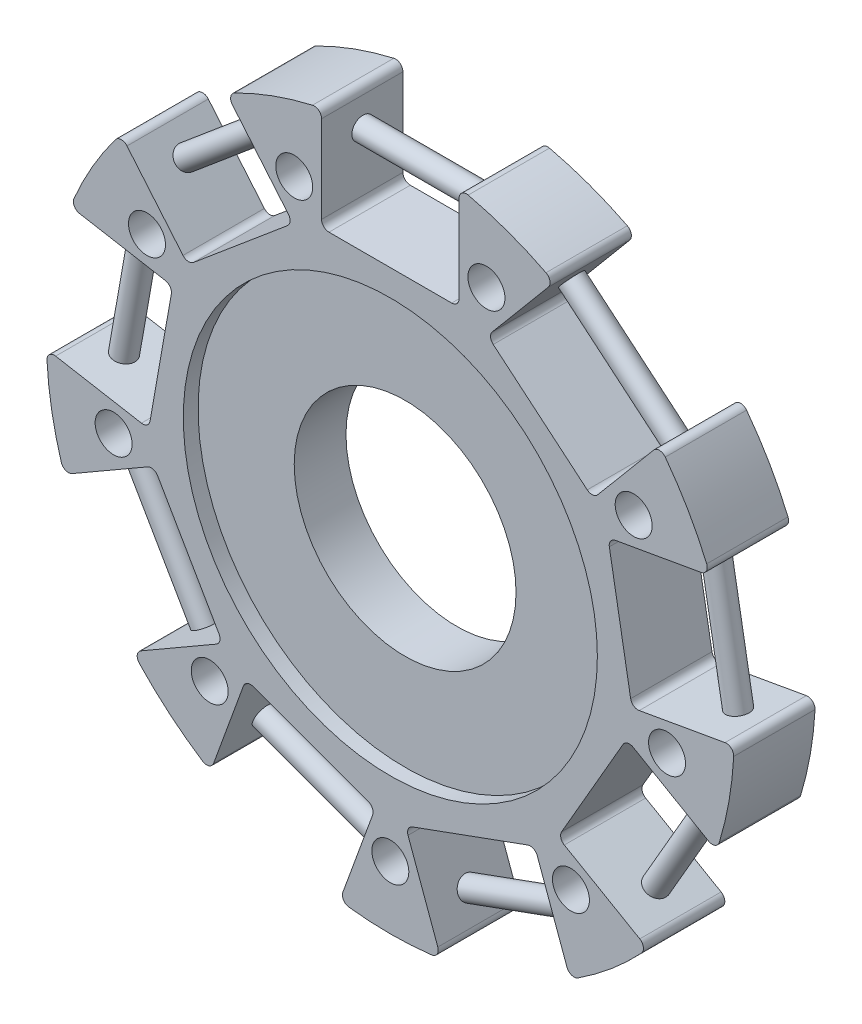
ISO-10303-21;
HEADER;
FILE_DESCRIPTION(('STEP AP214'),'2;1');
FILE_NAME('part.step','',(''),(''),'','','');
FILE_SCHEMA(('AUTOMOTIVE_DESIGN { 1 0 10303 214 1 1 1 1 }'));
ENDSEC;
DATA;
#1=APPLICATION_CONTEXT('core data for automotive mechanical design processes');
#2=APPLICATION_PROTOCOL_DEFINITION('international standard','automotive_design',2000,#1);
#3=PRODUCT_CONTEXT('',#1,'mechanical');
#4=PRODUCT('Part','Part','',(#3));
#5=PRODUCT_RELATED_PRODUCT_CATEGORY('part','',(#4));
#6=PRODUCT_DEFINITION_FORMATION('','',#4);
#7=PRODUCT_DEFINITION_CONTEXT('part definition',#1,'design');
#8=PRODUCT_DEFINITION('design','',#6,#7);
#9=PRODUCT_DEFINITION_SHAPE('','',#8);
#10=(LENGTH_UNIT() NAMED_UNIT(*) SI_UNIT(.MILLI.,.METRE.));
#11=(NAMED_UNIT(*) PLANE_ANGLE_UNIT() SI_UNIT($,.RADIAN.));
#12=(NAMED_UNIT(*) SI_UNIT($,.STERADIAN.) SOLID_ANGLE_UNIT());
#13=UNCERTAINTY_MEASURE_WITH_UNIT(LENGTH_MEASURE(1.E-05),#10,'distance_accuracy_value','');
#14=(GEOMETRIC_REPRESENTATION_CONTEXT(3) GLOBAL_UNCERTAINTY_ASSIGNED_CONTEXT((#13)) GLOBAL_UNIT_ASSIGNED_CONTEXT((#10,
#11,#12)) REPRESENTATION_CONTEXT('',''));
#15=CARTESIAN_POINT('',(0.,0.,0.));
#16=DIRECTION('',(0.,0.,1.));
#17=DIRECTION('',(1.,0.,0.));
#18=AXIS2_PLACEMENT_3D('',#15,#16,#17);
#19=CARTESIAN_POINT('',(0.,0.,11.));
#20=DIRECTION('',(0.,0.,-1.));
#21=DIRECTION('',(-1.,0.,0.));
#22=AXIS2_PLACEMENT_3D('',#19,#20,#21);
#23=CYLINDRICAL_SURFACE('',#22,46.5035436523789);
#24=CARTESIAN_POINT('',(0.,0.,0.));
#25=DIRECTION('',(0.,0.,1.));
#26=DIRECTION('',(1.,0.,0.));
#27=AXIS2_PLACEMENT_3D('',#24,#25,#26);
#28=CIRCLE('',#27,46.5035436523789);
#29=CARTESIAN_POINT('',(-10.5263559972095,45.2965274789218,0.));
#30=VERTEX_POINT('',#29);
#31=CARTESIAN_POINT('',(-21.0523901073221,41.4653643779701,0.));
#32=VERTEX_POINT('',#31);
#33=EDGE_CURVE('E517',#30,#32,#28,.T.);
#34=ORIENTED_EDGE('',*,*,#33,.T.);
#35=DIRECTION('',(0.,0.,-1.));
#36=VECTOR('',#35,1.);
#37=CARTESIAN_POINT('',(-21.0523901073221,41.4653643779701,11.));
#38=LINE('',#37,#36);
#39=CARTESIAN_POINT('',(-21.0523901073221,41.4653643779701,11.));
#40=VERTEX_POINT('',#39);
#41=EDGE_CURVE('E865',#40,#32,#38,.T.);
#42=ORIENTED_EDGE('',*,*,#41,.F.);
#43=CARTESIAN_POINT('',(0.,0.,11.));
#44=DIRECTION('',(0.,0.,1.));
#45=DIRECTION('',(1.,0.,0.));
#46=AXIS2_PLACEMENT_3D('',#43,#44,#45);
#47=CIRCLE('',#46,46.5035436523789);
#48=CARTESIAN_POINT('',(-10.5263559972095,45.2965274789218,11.));
#49=VERTEX_POINT('',#48);
#50=EDGE_CURVE('E660',#49,#40,#47,.T.);
#51=ORIENTED_EDGE('',*,*,#50,.F.);
#52=DIRECTION('',(0.,0.,-1.));
#53=VECTOR('',#52,1.);
#54=CARTESIAN_POINT('',(-10.5263559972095,45.2965274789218,11.));
#55=LINE('',#54,#53);
#56=EDGE_CURVE('E513',#49,#30,#55,.T.);
#57=ORIENTED_EDGE('',*,*,#56,.T.);
#58=EDGE_LOOP('',(#34,#42,#51,#57));
#59=FACE_BOUND('',#58,.T.);
#60=ADVANCED_FACE('F36',(#59),#23,.T.);
#61=CARTESIAN_POINT('',(-20.5996850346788,40.5737040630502,11.));
#62=DIRECTION('',(0.,0.,-1.));
#63=DIRECTION('',(-1.,0.,0.));
#64=AXIS2_PLACEMENT_3D('',#61,#62,#63);
#65=CYLINDRICAL_SURFACE('',#64,1.);
#66=CARTESIAN_POINT('',(-20.5996850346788,40.5737040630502,0.));
#67=DIRECTION('',(0.,0.,1.));
#68=DIRECTION('',(1.,0.,0.));
#69=AXIS2_PLACEMENT_3D('',#66,#67,#68);
#70=CIRCLE('',#69,1.);
#71=CARTESIAN_POINT('',(-21.3657294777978,39.9309164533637,0.));
#72=VERTEX_POINT('',#71);
#73=EDGE_CURVE('E520',#32,#72,#70,.T.);
#74=ORIENTED_EDGE('',*,*,#73,.T.);
#75=DIRECTION('',(0.,0.,-1.));
#76=VECTOR('',#75,1.);
#77=CARTESIAN_POINT('',(-21.3657294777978,39.9309164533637,11.));
#78=LINE('',#77,#76);
#79=CARTESIAN_POINT('',(-21.3657294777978,39.9309164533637,11.));
#80=VERTEX_POINT('',#79);
#81=EDGE_CURVE('E862',#80,#72,#78,.T.);
#82=ORIENTED_EDGE('',*,*,#81,.F.);
#83=CARTESIAN_POINT('',(-20.5996850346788,40.5737040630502,11.));
#84=DIRECTION('',(0.,0.,1.));
#85=DIRECTION('',(1.,0.,0.));
#86=AXIS2_PLACEMENT_3D('',#83,#84,#85);
#87=CIRCLE('',#86,1.);
#88=EDGE_CURVE('E288',#40,#80,#87,.T.);
#89=ORIENTED_EDGE('',*,*,#88,.F.);
#90=ORIENTED_EDGE('',*,*,#41,.T.);
#91=EDGE_LOOP('',(#74,#82,#89,#90));
#92=FACE_BOUND('',#91,.T.);
#93=ADVANCED_FACE('F998',(#92),#65,.T.);
#94=CARTESIAN_POINT('',(-21.3657294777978,39.9309164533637,11.));
#95=DIRECTION('',(0.766044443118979,0.642787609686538,0.));
#96=DIRECTION('',(-0.642787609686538,0.766044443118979,0.));
#97=AXIS2_PLACEMENT_3D('',#94,#95,#96);
#98=PLANE('',#97);
#99=CARTESIAN_POINT('',(-18.9328758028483,37.0315543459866,5.5));
#100=DIRECTION('',(0.766044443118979,0.642787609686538,0.));
#101=DIRECTION('',(-0.642787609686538,0.766044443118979,0.));
#102=AXIS2_PLACEMENT_3D('',#99,#100,#101);
#103=CIRCLE('',#102,1.5);
#104=CARTESIAN_POINT('',(-19.8970572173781,38.1806210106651,5.5));
#105=VERTEX_POINT('',#104);
#106=EDGE_CURVE('E873',#105,#105,#103,.F.);
#107=ORIENTED_EDGE('',*,*,#106,.F.);
#108=EDGE_LOOP('',(#107));
#109=FACE_BOUND('',#108,.T.);
#110=DIRECTION('',(0.642787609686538,-0.766044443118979,0.));
#111=VECTOR('',#110,1.);
#112=CARTESIAN_POINT('',(-21.3657294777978,39.9309164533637,0.));
#113=LINE('',#112,#111);
#114=CARTESIAN_POINT('',(-13.7905749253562,30.903198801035,0.));
#115=VERTEX_POINT('',#114);
#116=EDGE_CURVE('E523',#72,#115,#113,.T.);
#117=ORIENTED_EDGE('',*,*,#116,.T.);
#118=DIRECTION('',(0.,0.,-1.));
#119=VECTOR('',#118,1.);
#120=CARTESIAN_POINT('',(-13.7905749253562,30.903198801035,11.));
#121=LINE('',#120,#119);
#122=CARTESIAN_POINT('',(-13.7905749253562,30.903198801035,11.));
#123=VERTEX_POINT('',#122);
#124=EDGE_CURVE('E859',#123,#115,#121,.T.);
#125=ORIENTED_EDGE('',*,*,#124,.F.);
#126=DIRECTION('',(0.642787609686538,-0.766044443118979,0.));
#127=VECTOR('',#126,1.);
#128=CARTESIAN_POINT('',(-21.3657294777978,39.9309164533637,11.));
#129=LINE('',#128,#127);
#130=EDGE_CURVE('E1782',#80,#123,#129,.T.);
#131=ORIENTED_EDGE('',*,*,#130,.F.);
#132=ORIENTED_EDGE('',*,*,#81,.T.);
#133=EDGE_LOOP('',(#117,#125,#131,#132));
#134=FACE_BOUND('',#133,.T.);
#135=ADVANCED_FACE('F1002',(#109,#134),#98,.F.);
#136=CARTESIAN_POINT('',(-14.5566193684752,30.2604111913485,11.));
#137=DIRECTION('',(0.,0.,-1.));
#138=DIRECTION('',(-1.,0.,0.));
#139=AXIS2_PLACEMENT_3D('',#136,#137,#138);
#140=CYLINDRICAL_SURFACE('',#139,1.);
#141=CARTESIAN_POINT('',(-14.5566193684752,30.2604111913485,0.));
#142=DIRECTION('',(0.,0.,-1.));
#143=DIRECTION('',(1.,0.,0.));
#144=AXIS2_PLACEMENT_3D('',#141,#142,#143);
#145=CIRCLE('',#144,1.);
#146=CARTESIAN_POINT('',(-13.9138317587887,29.4943667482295,0.));
#147=VERTEX_POINT('',#146);
#148=EDGE_CURVE('E525',#115,#147,#145,.T.);
#149=ORIENTED_EDGE('',*,*,#148,.T.);
#150=DIRECTION('',(0.,0.,-1.));
#151=VECTOR('',#150,1.);
#152=CARTESIAN_POINT('',(-13.9138317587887,29.4943667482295,11.));
#153=LINE('',#152,#151);
#154=CARTESIAN_POINT('',(-13.9138317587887,29.4943667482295,11.));
#155=VERTEX_POINT('',#154);
#156=EDGE_CURVE('E856',#155,#147,#153,.T.);
#157=ORIENTED_EDGE('',*,*,#156,.F.);
#158=CARTESIAN_POINT('',(-14.5566193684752,30.2604111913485,11.));
#159=DIRECTION('',(0.,0.,-1.));
#160=DIRECTION('',(1.,0.,0.));
#161=AXIS2_PLACEMENT_3D('',#158,#159,#160);
#162=CIRCLE('',#161,1.);
#163=EDGE_CURVE('E1784',#123,#155,#162,.T.);
#164=ORIENTED_EDGE('',*,*,#163,.F.);
#165=ORIENTED_EDGE('',*,*,#124,.T.);
#166=EDGE_LOOP('',(#149,#157,#164,#165));
#167=FACE_BOUND('',#166,.T.);
#168=ADVANCED_FACE('F1006',(#167),#140,.F.);
#169=CARTESIAN_POINT('',(-13.9138317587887,29.4943667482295,11.));
#170=DIRECTION('',(0.642787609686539,-0.766044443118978,0.));
#171=DIRECTION('',(0.766044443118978,0.642787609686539,0.));
#172=AXIS2_PLACEMENT_3D('',#169,#170,#171);
#173=PLANE('',#172);
#174=DIRECTION('',(-0.766044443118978,-0.642787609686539,0.));
#175=VECTOR('',#174,1.);
#176=CARTESIAN_POINT('',(-13.9138317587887,29.4943667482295,0.));
#177=LINE('',#176,#175);
#178=CARTESIAN_POINT('',(-26.6301695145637,18.824092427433,0.));
#179=VERTEX_POINT('',#178);
#180=EDGE_CURVE('E527',#147,#179,#177,.T.);
#181=ORIENTED_EDGE('',*,*,#180,.T.);
#182=DIRECTION('',(0.,0.,-1.));
#183=VECTOR('',#182,1.);
#184=CARTESIAN_POINT('',(-26.6301695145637,18.824092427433,11.));
#185=LINE('',#184,#183);
#186=CARTESIAN_POINT('',(-26.6301695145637,18.824092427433,11.));
#187=VERTEX_POINT('',#186);
#188=EDGE_CURVE('E853',#187,#179,#185,.T.);
#189=ORIENTED_EDGE('',*,*,#188,.F.);
#190=DIRECTION('',(-0.766044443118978,-0.642787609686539,0.));
#191=VECTOR('',#190,1.);
#192=CARTESIAN_POINT('',(-13.9138317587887,29.4943667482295,11.));
#193=LINE('',#192,#191);
#194=EDGE_CURVE('E1786',#155,#187,#193,.T.);
#195=ORIENTED_EDGE('',*,*,#194,.F.);
#196=ORIENTED_EDGE('',*,*,#156,.T.);
#197=EDGE_LOOP('',(#181,#189,#195,#196));
#198=FACE_BOUND('',#197,.T.);
#199=ADVANCED_FACE('F1012',(#198),#173,.F.);
#200=CARTESIAN_POINT('',(-27.2729571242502,19.5901368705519,11.));
#201=DIRECTION('',(0.,0.,-1.));
#202=DIRECTION('',(-1.,0.,0.));
#203=AXIS2_PLACEMENT_3D('',#200,#201,#202);
#204=CYLINDRICAL_SURFACE('',#203,0.999999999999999);
#205=CARTESIAN_POINT('',(-27.2729571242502,19.5901368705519,0.));
#206=DIRECTION('',(0.,0.,-1.));
#207=DIRECTION('',(-1.,0.,0.));
#208=AXIS2_PLACEMENT_3D('',#205,#206,#207);
#209=CIRCLE('',#208,0.999999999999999);
#210=CARTESIAN_POINT('',(-28.0390015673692,18.9473492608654,0.));
#211=VERTEX_POINT('',#210);
#212=EDGE_CURVE('E529',#179,#211,#209,.T.);
#213=ORIENTED_EDGE('',*,*,#212,.T.);
#214=DIRECTION('',(0.,0.,-1.));
#215=VECTOR('',#214,1.);
#216=CARTESIAN_POINT('',(-28.0390015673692,18.9473492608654,11.));
#217=LINE('',#216,#215);
#218=CARTESIAN_POINT('',(-28.0390015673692,18.9473492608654,11.));
#219=VERTEX_POINT('',#218);
#220=EDGE_CURVE('E850',#219,#211,#217,.T.);
#221=ORIENTED_EDGE('',*,*,#220,.F.);
#222=CARTESIAN_POINT('',(-27.2729571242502,19.5901368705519,11.));
#223=DIRECTION('',(0.,0.,-1.));
#224=DIRECTION('',(-1.,0.,0.));
#225=AXIS2_PLACEMENT_3D('',#222,#223,#224);
#226=CIRCLE('',#225,0.999999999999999);
#227=EDGE_CURVE('E1788',#187,#219,#226,.T.);
#228=ORIENTED_EDGE('',*,*,#227,.F.);
#229=ORIENTED_EDGE('',*,*,#188,.T.);
#230=EDGE_LOOP('',(#213,#221,#228,#229));
#231=FACE_BOUND('',#230,.T.);
#232=ADVANCED_FACE('F1016',(#231),#204,.F.);
#233=CARTESIAN_POINT('',(-28.0390015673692,18.9473492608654,11.));
#234=DIRECTION('',(-0.766044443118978,-0.642787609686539,0.));
#235=DIRECTION('',(0.642787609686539,-0.766044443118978,0.));
#236=AXIS2_PLACEMENT_3D('',#233,#234,#235);
#237=PLANE('',#236);
#238=DIRECTION('',(-0.642787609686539,0.766044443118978,0.));
#239=VECTOR('',#238,1.);
#240=CARTESIAN_POINT('',(-28.0390015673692,18.9473492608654,0.));
#241=LINE('',#240,#239);
#242=CARTESIAN_POINT('',(-35.6141561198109,27.9750669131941,0.));
#243=VERTEX_POINT('',#242);
#244=EDGE_CURVE('E531',#211,#243,#241,.T.);
#245=ORIENTED_EDGE('',*,*,#244,.T.);
#246=DIRECTION('',(0.,0.,-1.));
#247=VECTOR('',#246,1.);
#248=CARTESIAN_POINT('',(-35.6141561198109,27.9750669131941,11.));
#249=LINE('',#248,#247);
#250=CARTESIAN_POINT('',(-35.6141561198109,27.9750669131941,11.));
#251=VERTEX_POINT('',#250);
#252=EDGE_CURVE('E847',#251,#243,#249,.T.);
#253=ORIENTED_EDGE('',*,*,#252,.F.);
#254=DIRECTION('',(-0.642787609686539,0.766044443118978,0.));
#255=VECTOR('',#254,1.);
#256=CARTESIAN_POINT('',(-28.0390015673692,18.9473492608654,11.));
#257=LINE('',#256,#255);
#258=EDGE_CURVE('E1790',#219,#251,#257,.T.);
#259=ORIENTED_EDGE('',*,*,#258,.F.);
#260=ORIENTED_EDGE('',*,*,#220,.T.);
#261=EDGE_LOOP('',(#245,#253,#259,#260));
#262=FACE_BOUND('',#261,.T.);
#263=ADVANCED_FACE('F1020',(#262),#237,.F.);
#264=CARTESIAN_POINT('',(-36.3802005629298,27.3322793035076,11.));
#265=DIRECTION('',(0.,0.,-1.));
#266=DIRECTION('',(-1.,0.,0.));
#267=AXIS2_PLACEMENT_3D('',#264,#265,#266);
#268=CYLINDRICAL_SURFACE('',#267,1.);
#269=CARTESIAN_POINT('',(-36.3802005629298,27.3322793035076,0.));
#270=DIRECTION('',(0.,0.,1.));
#271=DIRECTION('',(-1.,0.,0.));
#272=AXIS2_PLACEMENT_3D('',#269,#270,#271);
#273=CIRCLE('',#272,1.);
#274=CARTESIAN_POINT('',(-37.1797031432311,27.9329419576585,0.));
#275=VERTEX_POINT('',#274);
#276=EDGE_CURVE('E533',#243,#275,#273,.T.);
#277=ORIENTED_EDGE('',*,*,#276,.T.);
#278=DIRECTION('',(0.,0.,-1.));
#279=VECTOR('',#278,1.);
#280=CARTESIAN_POINT('',(-37.1797031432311,27.9329419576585,11.));
#281=LINE('',#280,#279);
#282=CARTESIAN_POINT('',(-37.1797031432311,27.9329419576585,11.));
#283=VERTEX_POINT('',#282);
#284=EDGE_CURVE('E844',#283,#275,#281,.T.);
#285=ORIENTED_EDGE('',*,*,#284,.F.);
#286=CARTESIAN_POINT('',(-36.3802005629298,27.3322793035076,11.));
#287=DIRECTION('',(0.,0.,1.));
#288=DIRECTION('',(-1.,0.,0.));
#289=AXIS2_PLACEMENT_3D('',#286,#287,#288);
#290=CIRCLE('',#289,1.);
#291=EDGE_CURVE('E1792',#251,#283,#290,.T.);
#292=ORIENTED_EDGE('',*,*,#291,.F.);
#293=ORIENTED_EDGE('',*,*,#252,.T.);
#294=EDGE_LOOP('',(#277,#285,#292,#293));
#295=FACE_BOUND('',#294,.T.);
#296=ADVANCED_FACE('F1024',(#295),#268,.T.);
#297=CARTESIAN_POINT('',(0.,0.,11.));
#298=DIRECTION('',(0.,0.,-1.));
#299=DIRECTION('',(-1.,0.,0.));
#300=AXIS2_PLACEMENT_3D('',#297,#298,#299);
#301=CYLINDRICAL_SURFACE('',#300,46.5035436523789);
#302=CARTESIAN_POINT('',(0.,0.,0.));
#303=DIRECTION('',(0.,0.,1.));
#304=DIRECTION('',(1.,0.,0.));
#305=AXIS2_PLACEMENT_3D('',#302,#303,#304);
#306=CIRCLE('',#305,46.5035436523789);
#307=CARTESIAN_POINT('',(-42.7804889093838,18.2320964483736,0.));
#308=VERTEX_POINT('',#307);
#309=EDGE_CURVE('E535',#275,#308,#306,.T.);
#310=ORIENTED_EDGE('',*,*,#309,.T.);
#311=DIRECTION('',(0.,0.,-1.));
#312=VECTOR('',#311,1.);
#313=CARTESIAN_POINT('',(-42.7804889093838,18.2320964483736,11.));
#314=LINE('',#313,#312);
#315=CARTESIAN_POINT('',(-42.7804889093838,18.2320964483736,11.));
#316=VERTEX_POINT('',#315);
#317=EDGE_CURVE('E841',#316,#308,#314,.T.);
#318=ORIENTED_EDGE('',*,*,#317,.F.);
#319=CARTESIAN_POINT('',(0.,0.,11.));
#320=DIRECTION('',(0.,0.,1.));
#321=DIRECTION('',(1.,0.,0.));
#322=AXIS2_PLACEMENT_3D('',#319,#320,#321);
#323=CIRCLE('',#322,46.5035436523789);
#324=EDGE_CURVE('E1794',#283,#316,#323,.T.);
#325=ORIENTED_EDGE('',*,*,#324,.F.);
#326=ORIENTED_EDGE('',*,*,#284,.T.);
#327=EDGE_LOOP('',(#310,#318,#325,#326));
#328=FACE_BOUND('',#327,.T.);
#329=ADVANCED_FACE('F1028',(#328),#301,.T.);
#330=CARTESIAN_POINT('',(-41.8605485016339,17.8400382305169,11.));
#331=DIRECTION('',(0.,0.,-1.));
#332=DIRECTION('',(-1.,0.,0.));
#333=AXIS2_PLACEMENT_3D('',#330,#331,#332);
#334=CYLINDRICAL_SURFACE('',#333,0.999999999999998);
#335=CARTESIAN_POINT('',(-41.8605485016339,17.8400382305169,0.));
#336=DIRECTION('',(0.,0.,1.));
#337=DIRECTION('',(1.,0.,0.));
#338=AXIS2_PLACEMENT_3D('',#335,#336,#337);
#339=CIRCLE('',#338,0.999999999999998);
#340=CARTESIAN_POINT('',(-42.0341966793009,16.8552304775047,0.));
#341=VERTEX_POINT('',#340);
#342=EDGE_CURVE('E537',#308,#341,#339,.T.);
#343=ORIENTED_EDGE('',*,*,#342,.T.);
#344=DIRECTION('',(0.,0.,-1.));
#345=VECTOR('',#344,1.);
#346=CARTESIAN_POINT('',(-42.0341966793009,16.8552304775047,11.));
#347=LINE('',#346,#345);
#348=CARTESIAN_POINT('',(-42.0341966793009,16.8552304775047,11.));
#349=VERTEX_POINT('',#348);
#350=EDGE_CURVE('E838',#349,#341,#347,.T.);
#351=ORIENTED_EDGE('',*,*,#350,.F.);
#352=CARTESIAN_POINT('',(-41.8605485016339,17.8400382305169,11.));
#353=DIRECTION('',(0.,0.,1.));
#354=DIRECTION('',(1.,0.,0.));
#355=AXIS2_PLACEMENT_3D('',#352,#353,#354);
#356=CIRCLE('',#355,0.999999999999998);
#357=EDGE_CURVE('E1796',#316,#349,#356,.T.);
#358=ORIENTED_EDGE('',*,*,#357,.F.);
#359=ORIENTED_EDGE('',*,*,#317,.T.);
#360=EDGE_LOOP('',(#343,#351,#358,#359));
#361=FACE_BOUND('',#360,.T.);
#362=ADVANCED_FACE('F1032',(#361),#334,.T.);
#363=CARTESIAN_POINT('',(-42.0341966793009,16.8552304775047,11.));
#364=DIRECTION('',(0.17364817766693,0.984807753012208,0.));
#365=DIRECTION('',(-0.984807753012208,0.17364817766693,0.));
#366=AXIS2_PLACEMENT_3D('',#363,#364,#365);
#367=PLANE('',#366);
#368=CARTESIAN_POINT('',(-38.3068486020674,16.1979984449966,5.5));
#369=DIRECTION('',(0.17364817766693,0.984807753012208,0.));
#370=DIRECTION('',(-0.984807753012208,0.17364817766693,0.));
#371=AXIS2_PLACEMENT_3D('',#368,#369,#370);
#372=CIRCLE('',#371,1.5);
#373=CARTESIAN_POINT('',(-39.7840602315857,16.458470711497,5.5));
#374=VERTEX_POINT('',#373);
#375=EDGE_CURVE('E876',#374,#374,#372,.F.);
#376=ORIENTED_EDGE('',*,*,#375,.F.);
#377=EDGE_LOOP('',(#376));
#378=FACE_BOUND('',#377,.T.);
#379=DIRECTION('',(0.984807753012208,-0.17364817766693,0.));
#380=VECTOR('',#379,1.);
#381=CARTESIAN_POINT('',(-42.0341966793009,16.8552304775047,0.));
#382=LINE('',#381,#380);
#383=CARTESIAN_POINT('',(-30.4283865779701,14.8088130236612,0.));
#384=VERTEX_POINT('',#383);
#385=EDGE_CURVE('E539',#341,#384,#382,.T.);
#386=ORIENTED_EDGE('',*,*,#385,.T.);
#387=DIRECTION('',(0.,0.,-1.));
#388=VECTOR('',#387,1.);
#389=CARTESIAN_POINT('',(-30.4283865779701,14.8088130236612,11.));
#390=LINE('',#389,#388);
#391=CARTESIAN_POINT('',(-30.4283865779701,14.8088130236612,11.));
#392=VERTEX_POINT('',#391);
#393=EDGE_CURVE('E835',#392,#384,#390,.T.);
#394=ORIENTED_EDGE('',*,*,#393,.F.);
#395=DIRECTION('',(0.984807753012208,-0.17364817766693,0.));
#396=VECTOR('',#395,1.);
#397=CARTESIAN_POINT('',(-42.0341966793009,16.8552304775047,11.));
#398=LINE('',#397,#396);
#399=EDGE_CURVE('E1798',#349,#392,#398,.T.);
#400=ORIENTED_EDGE('',*,*,#399,.F.);
#401=ORIENTED_EDGE('',*,*,#350,.T.);
#402=EDGE_LOOP('',(#386,#394,#400,#401));
#403=FACE_BOUND('',#402,.T.);
#404=ADVANCED_FACE('F1036',(#378,#403),#367,.F.);
#405=CARTESIAN_POINT('',(-30.602034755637,13.824005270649,11.));
#406=DIRECTION('',(0.,0.,-1.));
#407=DIRECTION('',(-1.,0.,0.));
#408=AXIS2_PLACEMENT_3D('',#405,#406,#407);
#409=CYLINDRICAL_SURFACE('',#408,0.999999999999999);
#410=CARTESIAN_POINT('',(-30.602034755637,13.824005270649,0.));
#411=DIRECTION('',(0.,0.,-1.));
#412=DIRECTION('',(1.,0.,0.));
#413=AXIS2_PLACEMENT_3D('',#410,#411,#412);
#414=CIRCLE('',#413,0.999999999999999);
#415=CARTESIAN_POINT('',(-29.6172270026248,13.650357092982,0.));
#416=VERTEX_POINT('',#415);
#417=EDGE_CURVE('E541',#384,#416,#414,.T.);
#418=ORIENTED_EDGE('',*,*,#417,.T.);
#419=DIRECTION('',(0.,0.,-1.));
#420=VECTOR('',#419,1.);
#421=CARTESIAN_POINT('',(-29.6172270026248,13.650357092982,11.));
#422=LINE('',#421,#420);
#423=CARTESIAN_POINT('',(-29.6172270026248,13.650357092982,11.));
#424=VERTEX_POINT('',#423);
#425=EDGE_CURVE('E832',#424,#416,#422,.T.);
#426=ORIENTED_EDGE('',*,*,#425,.F.);
#427=CARTESIAN_POINT('',(-30.602034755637,13.824005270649,11.));
#428=DIRECTION('',(0.,0.,-1.));
#429=DIRECTION('',(1.,0.,0.));
#430=AXIS2_PLACEMENT_3D('',#427,#428,#429);
#431=CIRCLE('',#430,0.999999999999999);
#432=EDGE_CURVE('E1800',#392,#424,#431,.T.);
#433=ORIENTED_EDGE('',*,*,#432,.F.);
#434=ORIENTED_EDGE('',*,*,#393,.T.);
#435=EDGE_LOOP('',(#418,#426,#433,#434));
#436=FACE_BOUND('',#435,.T.);
#437=ADVANCED_FACE('F1040',(#436),#409,.F.);
#438=CARTESIAN_POINT('',(-29.6172270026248,13.650357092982,11.));
#439=DIRECTION('',(0.984807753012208,-0.17364817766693,0.));
#440=DIRECTION('',(0.17364817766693,0.984807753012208,0.));
#441=AXIS2_PLACEMENT_3D('',#438,#439,#440);
#442=PLANE('',#441);
#443=DIRECTION('',(-0.17364817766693,-0.984807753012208,0.));
#444=VECTOR('',#443,1.);
#445=CARTESIAN_POINT('',(-29.6172270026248,13.650357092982,0.));
#446=LINE('',#445,#444);
#447=CARTESIAN_POINT('',(-32.4997867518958,-2.6974516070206,0.));
#448=VERTEX_POINT('',#447);
#449=EDGE_CURVE('E543',#416,#448,#446,.T.);
#450=ORIENTED_EDGE('',*,*,#449,.T.);
#451=DIRECTION('',(0.,0.,-1.));
#452=VECTOR('',#451,1.);
#453=CARTESIAN_POINT('',(-32.4997867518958,-2.6974516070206,11.));
#454=LINE('',#453,#452);
#455=CARTESIAN_POINT('',(-32.4997867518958,-2.6974516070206,11.));
#456=VERTEX_POINT('',#455);
#457=EDGE_CURVE('E829',#456,#448,#454,.T.);
#458=ORIENTED_EDGE('',*,*,#457,.F.);
#459=DIRECTION('',(-0.17364817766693,-0.984807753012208,0.));
#460=VECTOR('',#459,1.);
#461=CARTESIAN_POINT('',(-29.6172270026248,13.650357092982,11.));
#462=LINE('',#461,#460);
#463=EDGE_CURVE('E1802',#424,#456,#462,.T.);
#464=ORIENTED_EDGE('',*,*,#463,.F.);
#465=ORIENTED_EDGE('',*,*,#425,.T.);
#466=EDGE_LOOP('',(#450,#458,#464,#465));
#467=FACE_BOUND('',#466,.T.);
#468=ADVANCED_FACE('F1044',(#467),#442,.F.);
#469=CARTESIAN_POINT('',(-33.484594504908,-2.52380342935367,11.));
#470=DIRECTION('',(0.,0.,-1.));
#471=DIRECTION('',(-1.,0.,0.));
#472=AXIS2_PLACEMENT_3D('',#469,#470,#471);
#473=CYLINDRICAL_SURFACE('',#472,0.999999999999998);
#474=CARTESIAN_POINT('',(-33.484594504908,-2.52380342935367,0.));
#475=DIRECTION('',(0.,0.,-1.));
#476=DIRECTION('',(-1.,0.,0.));
#477=AXIS2_PLACEMENT_3D('',#474,#475,#476);
#478=CIRCLE('',#477,0.999999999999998);
#479=CARTESIAN_POINT('',(-33.658242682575,-3.50861118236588,0.));
#480=VERTEX_POINT('',#479);
#481=EDGE_CURVE('E545',#448,#480,#478,.T.);
#482=ORIENTED_EDGE('',*,*,#481,.T.);
#483=DIRECTION('',(0.,0.,-1.));
#484=VECTOR('',#483,1.);
#485=CARTESIAN_POINT('',(-33.658242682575,-3.50861118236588,11.));
#486=LINE('',#485,#484);
#487=CARTESIAN_POINT('',(-33.658242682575,-3.50861118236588,11.));
#488=VERTEX_POINT('',#487);
#489=EDGE_CURVE('E826',#488,#480,#486,.T.);
#490=ORIENTED_EDGE('',*,*,#489,.F.);
#491=CARTESIAN_POINT('',(-33.484594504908,-2.52380342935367,11.));
#492=DIRECTION('',(0.,0.,-1.));
#493=DIRECTION('',(-1.,0.,0.));
#494=AXIS2_PLACEMENT_3D('',#491,#492,#493);
#495=CIRCLE('',#494,0.999999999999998);
#496=EDGE_CURVE('E1804',#456,#488,#495,.T.);
#497=ORIENTED_EDGE('',*,*,#496,.F.);
#498=ORIENTED_EDGE('',*,*,#457,.T.);
#499=EDGE_LOOP('',(#482,#490,#497,#498));
#500=FACE_BOUND('',#499,.T.);
#501=ADVANCED_FACE('F1048',(#500),#473,.F.);
#502=CARTESIAN_POINT('',(-33.658242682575,-3.50861118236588,11.));
#503=DIRECTION('',(-0.17364817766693,-0.984807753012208,0.));
#504=DIRECTION('',(0.984807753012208,-0.17364817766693,0.));
#505=AXIS2_PLACEMENT_3D('',#502,#503,#504);
#506=PLANE('',#505);
#507=DIRECTION('',(-0.984807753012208,0.17364817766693,0.));
#508=VECTOR('',#507,1.);
#509=CARTESIAN_POINT('',(-33.658242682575,-3.50861118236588,0.));
#510=LINE('',#509,#508);
#511=CARTESIAN_POINT('',(-45.2640527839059,-1.4621937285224,0.));
#512=VERTEX_POINT('',#511);
#513=EDGE_CURVE('E547',#480,#512,#510,.T.);
#514=ORIENTED_EDGE('',*,*,#513,.T.);
#515=DIRECTION('',(0.,0.,-1.));
#516=VECTOR('',#515,1.);
#517=CARTESIAN_POINT('',(-45.2640527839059,-1.4621937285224,11.));
#518=LINE('',#517,#516);
#519=CARTESIAN_POINT('',(-45.2640527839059,-1.4621937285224,11.));
#520=VERTEX_POINT('',#519);
#521=EDGE_CURVE('E823',#520,#512,#518,.T.);
#522=ORIENTED_EDGE('',*,*,#521,.F.);
#523=DIRECTION('',(-0.984807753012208,0.17364817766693,0.));
#524=VECTOR('',#523,1.);
#525=CARTESIAN_POINT('',(-33.658242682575,-3.50861118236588,11.));
#526=LINE('',#525,#524);
#527=EDGE_CURVE('E1806',#488,#520,#526,.T.);
#528=ORIENTED_EDGE('',*,*,#527,.F.);
#529=ORIENTED_EDGE('',*,*,#489,.T.);
#530=EDGE_LOOP('',(#514,#522,#528,#529));
#531=FACE_BOUND('',#530,.T.);
#532=ADVANCED_FACE('F1052',(#531),#506,.F.);
#533=CARTESIAN_POINT('',(-45.4377009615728,-2.4470014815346,11.));
#534=DIRECTION('',(0.,0.,-1.));
#535=DIRECTION('',(-1.,0.,0.));
#536=AXIS2_PLACEMENT_3D('',#533,#534,#535);
#537=CYLINDRICAL_SURFACE('',#536,1.);
#538=CARTESIAN_POINT('',(-45.4377009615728,-2.4470014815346,0.));
#539=DIRECTION('',(0.,0.,1.));
#540=DIRECTION('',(-1.,0.,0.));
#541=AXIS2_PLACEMENT_3D('',#538,#539,#540);
#542=CIRCLE('',#541,1.);
#543=CARTESIAN_POINT('',(-46.4362539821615,-2.50077754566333,0.));
#544=VERTEX_POINT('',#543);
#545=EDGE_CURVE('E549',#512,#544,#542,.T.);
#546=ORIENTED_EDGE('',*,*,#545,.T.);
#547=DIRECTION('',(0.,0.,-1.));
#548=VECTOR('',#547,1.);
#549=CARTESIAN_POINT('',(-46.4362539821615,-2.50077754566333,11.));
#550=LINE('',#549,#548);
#551=CARTESIAN_POINT('',(-46.4362539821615,-2.50077754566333,11.));
#552=VERTEX_POINT('',#551);
#553=EDGE_CURVE('E820',#552,#544,#550,.T.);
#554=ORIENTED_EDGE('',*,*,#553,.F.);
#555=CARTESIAN_POINT('',(-45.4377009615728,-2.4470014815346,11.));
#556=DIRECTION('',(0.,0.,1.));
#557=DIRECTION('',(-1.,0.,0.));
#558=AXIS2_PLACEMENT_3D('',#555,#556,#557);
#559=CIRCLE('',#558,1.);
#560=EDGE_CURVE('E1808',#520,#552,#559,.T.);
#561=ORIENTED_EDGE('',*,*,#560,.F.);
#562=ORIENTED_EDGE('',*,*,#521,.T.);
#563=EDGE_LOOP('',(#546,#554,#561,#562));
#564=FACE_BOUND('',#563,.T.);
#565=ADVANCED_FACE('F1056',(#564),#537,.T.);
#566=CARTESIAN_POINT('',(0.,0.,11.));
#567=DIRECTION('',(0.,0.,-1.));
#568=DIRECTION('',(-1.,0.,0.));
#569=AXIS2_PLACEMENT_3D('',#566,#567,#568);
#570=CYLINDRICAL_SURFACE('',#569,46.5035436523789);
#571=CARTESIAN_POINT('',(0.,0.,0.));
#572=DIRECTION('',(0.,0.,1.));
#573=DIRECTION('',(1.,0.,0.));
#574=AXIS2_PLACEMENT_3D('',#571,#572,#573);
#575=CIRCLE('',#574,46.5035436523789);
#576=CARTESIAN_POINT('',(-44.491121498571,-13.5321720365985,0.));
#577=VERTEX_POINT('',#576);
#578=EDGE_CURVE('E551',#544,#577,#575,.T.);
#579=ORIENTED_EDGE('',*,*,#578,.T.);
#580=DIRECTION('',(0.,0.,-1.));
#581=VECTOR('',#580,1.);
#582=CARTESIAN_POINT('',(-44.491121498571,-13.5321720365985,11.));
#583=LINE('',#582,#581);
#584=CARTESIAN_POINT('',(-44.491121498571,-13.5321720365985,11.));
#585=VERTEX_POINT('',#584);
#586=EDGE_CURVE('E817',#585,#577,#583,.T.);
#587=ORIENTED_EDGE('',*,*,#586,.F.);
#588=CARTESIAN_POINT('',(0.,0.,11.));
#589=DIRECTION('',(0.,0.,1.));
#590=DIRECTION('',(1.,0.,0.));
#591=AXIS2_PLACEMENT_3D('',#588,#589,#590);
#592=CIRCLE('',#591,46.5035436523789);
#593=EDGE_CURVE('E1810',#552,#585,#592,.T.);
#594=ORIENTED_EDGE('',*,*,#593,.F.);
#595=ORIENTED_EDGE('',*,*,#553,.T.);
#596=EDGE_LOOP('',(#579,#587,#594,#595));
#597=FACE_BOUND('',#596,.T.);
#598=ADVANCED_FACE('F1060',(#597),#570,.T.);
#599=CARTESIAN_POINT('',(-43.5343960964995,-13.2411797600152,11.));
#600=DIRECTION('',(0.,0.,-1.));
#601=DIRECTION('',(-1.,0.,0.));
#602=AXIS2_PLACEMENT_3D('',#599,#600,#601);
#603=CYLINDRICAL_SURFACE('',#602,1.);
#604=CARTESIAN_POINT('',(-43.5343960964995,-13.2411797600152,0.));
#605=DIRECTION('',(0.,0.,1.));
#606=DIRECTION('',(1.,0.,0.));
#607=AXIS2_PLACEMENT_3D('',#604,#605,#606);
#608=CIRCLE('',#607,1.);
#609=CARTESIAN_POINT('',(-43.0343960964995,-14.1072051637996,0.));
#610=VERTEX_POINT('',#609);
#611=EDGE_CURVE('E553',#577,#610,#608,.T.);
#612=ORIENTED_EDGE('',*,*,#611,.T.);
#613=DIRECTION('',(0.,0.,-1.));
#614=VECTOR('',#613,1.);
#615=CARTESIAN_POINT('',(-43.0343960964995,-14.1072051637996,11.));
#616=LINE('',#615,#614);
#617=CARTESIAN_POINT('',(-43.0343960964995,-14.1072051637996,11.));
#618=VERTEX_POINT('',#617);
#619=EDGE_CURVE('E814',#618,#610,#616,.T.);
#620=ORIENTED_EDGE('',*,*,#619,.F.);
#621=CARTESIAN_POINT('',(-43.5343960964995,-13.2411797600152,11.));
#622=DIRECTION('',(0.,0.,1.));
#623=DIRECTION('',(1.,0.,0.));
#624=AXIS2_PLACEMENT_3D('',#621,#622,#623);
#625=CIRCLE('',#624,1.);
#626=EDGE_CURVE('E1812',#585,#618,#625,.T.);
#627=ORIENTED_EDGE('',*,*,#626,.F.);
#628=ORIENTED_EDGE('',*,*,#586,.T.);
#629=EDGE_LOOP('',(#612,#620,#627,#628));
#630=FACE_BOUND('',#629,.T.);
#631=ADVANCED_FACE('F1064',(#630),#603,.T.);
#632=CARTESIAN_POINT('',(-43.0343960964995,-14.1072051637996,11.));
#633=DIRECTION('',(-0.5,0.866025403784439,0.));
#634=DIRECTION('',(-0.866025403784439,-0.5,0.));
#635=AXIS2_PLACEMENT_3D('',#632,#633,#634);
#636=PLANE('',#635);
#637=CARTESIAN_POINT('',(-39.7566212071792,-12.2147809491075,5.5));
#638=DIRECTION('',(-0.5,0.866025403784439,0.));
#639=DIRECTION('',(-0.866025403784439,-0.5,0.));
#640=AXIS2_PLACEMENT_3D('',#637,#638,#639);
#641=CIRCLE('',#640,1.5);
#642=CARTESIAN_POINT('',(-41.0556593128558,-12.9647809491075,5.5));
#643=VERTEX_POINT('',#642);
#644=EDGE_CURVE('E879',#643,#643,#641,.F.);
#645=ORIENTED_EDGE('',*,*,#644,.F.);
#646=EDGE_LOOP('',(#645));
#647=FACE_BOUND('',#646,.T.);
#648=DIRECTION('',(0.866025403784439,0.5,0.));
#649=VECTOR('',#648,1.);
#650=CARTESIAN_POINT('',(-43.0343960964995,-14.1072051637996,0.));
#651=LINE('',#650,#649);
#652=CARTESIAN_POINT('',(-32.8284179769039,-8.21478094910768,0.));
#653=VERTEX_POINT('',#652);
#654=EDGE_CURVE('E555',#610,#653,#651,.T.);
#655=ORIENTED_EDGE('',*,*,#654,.T.);
#656=DIRECTION('',(0.,0.,-1.));
#657=VECTOR('',#656,1.);
#658=CARTESIAN_POINT('',(-32.8284179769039,-8.21478094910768,11.));
#659=LINE('',#658,#657);
#660=CARTESIAN_POINT('',(-32.8284179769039,-8.21478094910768,11.));
#661=VERTEX_POINT('',#660);
#662=EDGE_CURVE('E811',#661,#653,#659,.T.);
#663=ORIENTED_EDGE('',*,*,#662,.F.);
#664=DIRECTION('',(0.866025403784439,0.5,0.));
#665=VECTOR('',#664,1.);
#666=CARTESIAN_POINT('',(-43.0343960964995,-14.1072051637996,11.));
#667=LINE('',#666,#665);
#668=EDGE_CURVE('E1814',#618,#661,#667,.T.);
#669=ORIENTED_EDGE('',*,*,#668,.F.);
#670=ORIENTED_EDGE('',*,*,#619,.T.);
#671=EDGE_LOOP('',(#655,#663,#669,#670));
#672=FACE_BOUND('',#671,.T.);
#673=ADVANCED_FACE('F1068',(#647,#672),#636,.F.);
#674=CARTESIAN_POINT('',(-32.3284179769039,-9.08080635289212,11.));
#675=DIRECTION('',(0.,0.,-1.));
#676=DIRECTION('',(-1.,0.,0.));
#677=AXIS2_PLACEMENT_3D('',#674,#675,#676);
#678=CYLINDRICAL_SURFACE('',#677,1.);
#679=CARTESIAN_POINT('',(-32.3284179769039,-9.08080635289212,0.));
#680=DIRECTION('',(0.,0.,-1.));
#681=DIRECTION('',(1.,0.,0.));
#682=AXIS2_PLACEMENT_3D('',#679,#680,#681);
#683=CIRCLE('',#682,1.);
#684=CARTESIAN_POINT('',(-31.4623925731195,-8.58080635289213,0.));
#685=VERTEX_POINT('',#684);
#686=EDGE_CURVE('E557',#653,#685,#683,.T.);
#687=ORIENTED_EDGE('',*,*,#686,.T.);
#688=DIRECTION('',(0.,0.,-1.));
#689=VECTOR('',#688,1.);
#690=CARTESIAN_POINT('',(-31.4623925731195,-8.58080635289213,11.));
#691=LINE('',#690,#689);
#692=CARTESIAN_POINT('',(-31.4623925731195,-8.58080635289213,11.));
#693=VERTEX_POINT('',#692);
#694=EDGE_CURVE('E808',#693,#685,#691,.T.);
#695=ORIENTED_EDGE('',*,*,#694,.F.);
#696=CARTESIAN_POINT('',(-32.3284179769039,-9.08080635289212,11.));
#697=DIRECTION('',(0.,0.,-1.));
#698=DIRECTION('',(1.,0.,0.));
#699=AXIS2_PLACEMENT_3D('',#696,#697,#698);
#700=CIRCLE('',#699,1.);
#701=EDGE_CURVE('E1816',#661,#693,#700,.T.);
#702=ORIENTED_EDGE('',*,*,#701,.F.);
#703=ORIENTED_EDGE('',*,*,#662,.T.);
#704=EDGE_LOOP('',(#687,#695,#702,#703));
#705=FACE_BOUND('',#704,.T.);
#706=ADVANCED_FACE('F1072',(#705),#678,.F.);
#707=CARTESIAN_POINT('',(-31.4623925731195,-8.58080635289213,11.));
#708=DIRECTION('',(0.866025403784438,0.500000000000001,0.));
#709=DIRECTION('',(-0.500000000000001,0.866025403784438,0.));
#710=AXIS2_PLACEMENT_3D('',#707,#708,#709);
#711=PLANE('',#710);
#712=DIRECTION('',(0.5,-0.866025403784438,0.));
#713=VECTOR('',#712,1.);
#714=CARTESIAN_POINT('',(-31.4623925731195,-8.58080635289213,0.));
#715=LINE('',#714,#713);
#716=CARTESIAN_POINT('',(-23.1623925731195,-22.9568280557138,0.));
#717=VERTEX_POINT('',#716);
#718=EDGE_CURVE('E559',#685,#717,#715,.T.);
#719=ORIENTED_EDGE('',*,*,#718,.T.);
#720=DIRECTION('',(0.,0.,-1.));
#721=VECTOR('',#720,1.);
#722=CARTESIAN_POINT('',(-23.1623925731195,-22.9568280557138,11.));
#723=LINE('',#722,#721);
#724=CARTESIAN_POINT('',(-23.1623925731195,-22.9568280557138,11.));
#725=VERTEX_POINT('',#724);
#726=EDGE_CURVE('E805',#725,#717,#723,.T.);
#727=ORIENTED_EDGE('',*,*,#726,.F.);
#728=DIRECTION('',(0.5,-0.866025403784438,0.));
#729=VECTOR('',#728,1.);
#730=CARTESIAN_POINT('',(-31.4623925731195,-8.58080635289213,11.));
#731=LINE('',#730,#729);
#732=EDGE_CURVE('E1818',#693,#725,#731,.T.);
#733=ORIENTED_EDGE('',*,*,#732,.F.);
#734=ORIENTED_EDGE('',*,*,#694,.T.);
#735=EDGE_LOOP('',(#719,#727,#733,#734));
#736=FACE_BOUND('',#735,.T.);
#737=ADVANCED_FACE('F1076',(#736),#711,.F.);
#738=CARTESIAN_POINT('',(-24.0284179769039,-23.4568280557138,11.));
#739=DIRECTION('',(0.,0.,-1.));
#740=DIRECTION('',(-1.,0.,0.));
#741=AXIS2_PLACEMENT_3D('',#738,#739,#740);
#742=CYLINDRICAL_SURFACE('',#741,1.);
#743=CARTESIAN_POINT('',(-24.0284179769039,-23.4568280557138,0.));
#744=DIRECTION('',(0.,0.,-1.));
#745=DIRECTION('',(-1.,0.,0.));
#746=AXIS2_PLACEMENT_3D('',#743,#744,#745);
#747=CIRCLE('',#746,1.);
#748=CARTESIAN_POINT('',(-23.5284179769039,-24.3228534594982,0.));
#749=VERTEX_POINT('',#748);
#750=EDGE_CURVE('E561',#717,#749,#747,.T.);
#751=ORIENTED_EDGE('',*,*,#750,.T.);
#752=DIRECTION('',(0.,0.,-1.));
#753=VECTOR('',#752,1.);
#754=CARTESIAN_POINT('',(-23.5284179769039,-24.3228534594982,11.));
#755=LINE('',#754,#753);
#756=CARTESIAN_POINT('',(-23.5284179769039,-24.3228534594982,11.));
#757=VERTEX_POINT('',#756);
#758=EDGE_CURVE('E802',#757,#749,#755,.T.);
#759=ORIENTED_EDGE('',*,*,#758,.F.);
#760=CARTESIAN_POINT('',(-24.0284179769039,-23.4568280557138,11.));
#761=DIRECTION('',(0.,0.,-1.));
#762=DIRECTION('',(-1.,0.,0.));
#763=AXIS2_PLACEMENT_3D('',#760,#761,#762);
#764=CIRCLE('',#763,1.);
#765=EDGE_CURVE('E1820',#725,#757,#764,.T.);
#766=ORIENTED_EDGE('',*,*,#765,.F.);
#767=ORIENTED_EDGE('',*,*,#726,.T.);
#768=EDGE_LOOP('',(#751,#759,#766,#767));
#769=FACE_BOUND('',#768,.T.);
#770=ADVANCED_FACE('F1080',(#769),#742,.F.);
#771=CARTESIAN_POINT('',(-23.5284179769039,-24.3228534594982,11.));
#772=DIRECTION('',(0.499999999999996,-0.866025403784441,0.));
#773=DIRECTION('',(0.866025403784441,0.499999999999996,0.));
#774=AXIS2_PLACEMENT_3D('',#771,#772,#773);
#775=PLANE('',#774);
#776=DIRECTION('',(-0.866025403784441,-0.499999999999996,0.));
#777=VECTOR('',#776,1.);
#778=CARTESIAN_POINT('',(-23.5284179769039,-24.3228534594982,0.));
#779=LINE('',#778,#777);
#780=CARTESIAN_POINT('',(-33.7343960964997,-30.2152776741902,0.));
#781=VERTEX_POINT('',#780);
#782=EDGE_CURVE('E563',#749,#781,#779,.T.);
#783=ORIENTED_EDGE('',*,*,#782,.T.);
#784=DIRECTION('',(0.,0.,-1.));
#785=VECTOR('',#784,1.);
#786=CARTESIAN_POINT('',(-33.7343960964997,-30.2152776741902,11.));
#787=LINE('',#786,#785);
#788=CARTESIAN_POINT('',(-33.7343960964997,-30.2152776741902,11.));
#789=VERTEX_POINT('',#788);
#790=EDGE_CURVE('E799',#789,#781,#787,.T.);
#791=ORIENTED_EDGE('',*,*,#790,.F.);
#792=DIRECTION('',(-0.866025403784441,-0.499999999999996,0.));
#793=VECTOR('',#792,1.);
#794=CARTESIAN_POINT('',(-23.5284179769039,-24.3228534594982,11.));
#795=LINE('',#794,#793);
#796=EDGE_CURVE('E1822',#757,#789,#795,.T.);
#797=ORIENTED_EDGE('',*,*,#796,.F.);
#798=ORIENTED_EDGE('',*,*,#758,.T.);
#799=EDGE_LOOP('',(#783,#791,#797,#798));
#800=FACE_BOUND('',#799,.T.);
#801=ADVANCED_FACE('F1084',(#800),#775,.F.);
#802=CARTESIAN_POINT('',(-33.2343960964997,-31.0813030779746,11.));
#803=DIRECTION('',(0.,0.,-1.));
#804=DIRECTION('',(-1.,0.,0.));
#805=AXIS2_PLACEMENT_3D('',#802,#803,#804);
#806=CYLINDRICAL_SURFACE('',#805,0.999999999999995);
#807=CARTESIAN_POINT('',(-33.2343960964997,-31.0813030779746,0.));
#808=DIRECTION('',(0.,0.,1.));
#809=DIRECTION('',(-1.,0.,0.));
#810=AXIS2_PLACEMENT_3D('',#807,#808,#809);
#811=CIRCLE('',#810,0.999999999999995);
#812=CARTESIAN_POINT('',(-33.9647655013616,-31.7643554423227,0.));
#813=VERTEX_POINT('',#812);
#814=EDGE_CURVE('E565',#781,#813,#811,.T.);
#815=ORIENTED_EDGE('',*,*,#814,.T.);
#816=DIRECTION('',(0.,0.,-1.));
#817=VECTOR('',#816,1.);
#818=CARTESIAN_POINT('',(-33.9647655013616,-31.7643554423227,11.));
#819=LINE('',#818,#817);
#820=CARTESIAN_POINT('',(-33.9647655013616,-31.7643554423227,11.));
#821=VERTEX_POINT('',#820);
#822=EDGE_CURVE('E796',#821,#813,#819,.T.);
#823=ORIENTED_EDGE('',*,*,#822,.F.);
#824=CARTESIAN_POINT('',(-33.2343960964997,-31.0813030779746,11.));
#825=DIRECTION('',(0.,0.,1.));
#826=DIRECTION('',(-1.,0.,0.));
#827=AXIS2_PLACEMENT_3D('',#824,#825,#826);
#828=CIRCLE('',#827,0.999999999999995);
#829=EDGE_CURVE('E1824',#789,#821,#828,.T.);
#830=ORIENTED_EDGE('',*,*,#829,.F.);
#831=ORIENTED_EDGE('',*,*,#790,.T.);
#832=EDGE_LOOP('',(#815,#823,#830,#831));
#833=FACE_BOUND('',#832,.T.);
#834=ADVANCED_FACE('F1088',(#833),#806,.T.);
#835=CARTESIAN_POINT('',(0.,0.,11.));
#836=DIRECTION('',(0.,0.,-1.));
#837=DIRECTION('',(-1.,0.,0.));
#838=AXIS2_PLACEMENT_3D('',#835,#836,#837);
#839=CYLINDRICAL_SURFACE('',#838,46.5035436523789);
#840=CARTESIAN_POINT('',(0.,0.,0.));
#841=DIRECTION('',(0.,0.,1.));
#842=DIRECTION('',(1.,0.,0.));
#843=AXIS2_PLACEMENT_3D('',#840,#841,#842);
#844=CIRCLE('',#843,46.5035436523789);
#845=CARTESIAN_POINT('',(-25.3838638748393,-38.9645868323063,0.));
#846=VERTEX_POINT('',#845);
#847=EDGE_CURVE('E567',#813,#846,#844,.T.);
#848=ORIENTED_EDGE('',*,*,#847,.T.);
#849=DIRECTION('',(0.,0.,-1.));
#850=VECTOR('',#849,1.);
#851=CARTESIAN_POINT('',(-25.3838638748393,-38.9645868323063,11.));
#852=LINE('',#851,#850);
#853=CARTESIAN_POINT('',(-25.3838638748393,-38.9645868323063,11.));
#854=VERTEX_POINT('',#853);
#855=EDGE_CURVE('E793',#854,#846,#852,.T.);
#856=ORIENTED_EDGE('',*,*,#855,.F.);
#857=CARTESIAN_POINT('',(0.,0.,11.));
#858=DIRECTION('',(0.,0.,1.));
#859=DIRECTION('',(1.,0.,0.));
#860=AXIS2_PLACEMENT_3D('',#857,#858,#859);
#861=CIRCLE('',#860,46.5035436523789);
#862=EDGE_CURVE('E1826',#821,#854,#861,.T.);
#863=ORIENTED_EDGE('',*,*,#862,.F.);
#864=ORIENTED_EDGE('',*,*,#822,.T.);
#865=EDGE_LOOP('',(#848,#856,#863,#864));
#866=FACE_BOUND('',#865,.T.);
#867=ADVANCED_FACE('F1092',(#866),#839,.T.);
#868=CARTESIAN_POINT('',(-24.8380159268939,-38.1267025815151,11.));
#869=DIRECTION('',(0.,0.,-1.));
#870=DIRECTION('',(-1.,0.,0.));
#871=AXIS2_PLACEMENT_3D('',#868,#869,#870);
#872=CYLINDRICAL_SURFACE('',#871,1.);
#873=CARTESIAN_POINT('',(-24.8380159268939,-38.1267025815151,0.));
#874=DIRECTION('',(0.,0.,1.));
#875=DIRECTION('',(1.,0.,0.));
#876=AXIS2_PLACEMENT_3D('',#873,#874,#875);
#877=CIRCLE('',#876,1.);
#878=CARTESIAN_POINT('',(-23.898323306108,-38.4687227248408,0.));
#879=VERTEX_POINT('',#878);
#880=EDGE_CURVE('E569',#846,#879,#877,.T.);
#881=ORIENTED_EDGE('',*,*,#880,.T.);
#882=DIRECTION('',(0.,0.,-1.));
#883=VECTOR('',#882,1.);
#884=CARTESIAN_POINT('',(-23.898323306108,-38.4687227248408,11.));
#885=LINE('',#884,#883);
#886=CARTESIAN_POINT('',(-23.898323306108,-38.4687227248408,11.));
#887=VERTEX_POINT('',#886);
#888=EDGE_CURVE('E790',#887,#879,#885,.T.);
#889=ORIENTED_EDGE('',*,*,#888,.F.);
#890=CARTESIAN_POINT('',(-24.8380159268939,-38.1267025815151,11.));
#891=DIRECTION('',(0.,0.,1.));
#892=DIRECTION('',(1.,0.,0.));
#893=AXIS2_PLACEMENT_3D('',#890,#891,#892);
#894=CIRCLE('',#893,1.);
#895=EDGE_CURVE('E1828',#854,#887,#894,.T.);
#896=ORIENTED_EDGE('',*,*,#895,.F.);
#897=ORIENTED_EDGE('',*,*,#855,.T.);
#898=EDGE_LOOP('',(#881,#889,#896,#897));
#899=FACE_BOUND('',#898,.T.);
#900=ADVANCED_FACE('F1096',(#899),#872,.T.);
#901=CARTESIAN_POINT('',(-23.898323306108,-38.4687227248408,11.));
#902=DIRECTION('',(-0.939692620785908,0.342020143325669,0.));
#903=DIRECTION('',(-0.342020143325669,-0.939692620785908,0.));
#904=AXIS2_PLACEMENT_3D('',#901,#902,#903);
#905=PLANE('',#904);
#906=CARTESIAN_POINT('',(-22.603828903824,-34.9121285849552,5.5));
#907=DIRECTION('',(-0.939692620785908,0.342020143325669,0.));
#908=DIRECTION('',(-0.342020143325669,-0.939692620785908,0.));
#909=AXIS2_PLACEMENT_3D('',#906,#907,#908);
#910=CIRCLE('',#909,1.5);
#911=CARTESIAN_POINT('',(-23.1168591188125,-36.321667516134,5.5));
#912=VERTEX_POINT('',#911);
#913=EDGE_CURVE('E882',#912,#912,#910,.F.);
#914=ORIENTED_EDGE('',*,*,#913,.F.);
#915=EDGE_LOOP('',(#914));
#916=FACE_BOUND('',#915,.T.);
#917=DIRECTION('',(0.342020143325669,0.939692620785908,0.));
#918=VECTOR('',#917,1.);
#919=CARTESIAN_POINT('',(-23.898323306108,-38.4687227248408,0.));
#920=LINE('',#919,#918);
#921=CARTESIAN_POINT('',(-19.8676677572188,-27.3945876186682,0.));
#922=VERTEX_POINT('',#921);
#923=EDGE_CURVE('E571',#879,#922,#920,.T.);
#924=ORIENTED_EDGE('',*,*,#923,.T.);
#925=DIRECTION('',(0.,0.,-1.));
#926=VECTOR('',#925,1.);
#927=CARTESIAN_POINT('',(-19.8676677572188,-27.3945876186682,11.));
#928=LINE('',#927,#926);
#929=CARTESIAN_POINT('',(-19.8676677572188,-27.3945876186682,11.));
#930=VERTEX_POINT('',#929);
#931=EDGE_CURVE('E787',#930,#922,#928,.T.);
#932=ORIENTED_EDGE('',*,*,#931,.F.);
#933=DIRECTION('',(0.342020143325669,0.939692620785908,0.));
#934=VECTOR('',#933,1.);
#935=CARTESIAN_POINT('',(-23.898323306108,-38.4687227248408,11.));
#936=LINE('',#935,#934);
#937=EDGE_CURVE('E1830',#887,#930,#936,.T.);
#938=ORIENTED_EDGE('',*,*,#937,.F.);
#939=ORIENTED_EDGE('',*,*,#888,.T.);
#940=EDGE_LOOP('',(#924,#932,#938,#939));
#941=FACE_BOUND('',#940,.T.);
#942=ADVANCED_FACE('F1100',(#916,#941),#905,.F.);
#943=CARTESIAN_POINT('',(-18.9279751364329,-27.7366077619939,11.));
#944=DIRECTION('',(0.,0.,-1.));
#945=DIRECTION('',(-1.,0.,0.));
#946=AXIS2_PLACEMENT_3D('',#943,#944,#945);
#947=CYLINDRICAL_SURFACE('',#946,1.);
#948=CARTESIAN_POINT('',(-18.9279751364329,-27.7366077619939,0.));
#949=DIRECTION('',(0.,0.,-1.));
#950=DIRECTION('',(1.,0.,0.));
#951=AXIS2_PLACEMENT_3D('',#948,#949,#950);
#952=CIRCLE('',#951,1.);
#953=CARTESIAN_POINT('',(-18.5859549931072,-26.796915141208,0.));
#954=VERTEX_POINT('',#953);
#955=EDGE_CURVE('E573',#922,#954,#952,.T.);
#956=ORIENTED_EDGE('',*,*,#955,.T.);
#957=DIRECTION('',(0.,0.,-1.));
#958=VECTOR('',#957,1.);
#959=CARTESIAN_POINT('',(-18.5859549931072,-26.796915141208,11.));
#960=LINE('',#959,#958);
#961=CARTESIAN_POINT('',(-18.5859549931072,-26.796915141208,11.));
#962=VERTEX_POINT('',#961);
#963=EDGE_CURVE('E784',#962,#954,#960,.T.);
#964=ORIENTED_EDGE('',*,*,#963,.F.);
#965=CARTESIAN_POINT('',(-18.9279751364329,-27.7366077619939,11.));
#966=DIRECTION('',(0.,0.,-1.));
#967=DIRECTION('',(1.,0.,0.));
#968=AXIS2_PLACEMENT_3D('',#965,#966,#967);
#969=CIRCLE('',#968,1.);
#970=EDGE_CURVE('E1832',#930,#962,#969,.T.);
#971=ORIENTED_EDGE('',*,*,#970,.F.);
#972=ORIENTED_EDGE('',*,*,#931,.T.);
#973=EDGE_LOOP('',(#956,#964,#971,#972));
#974=FACE_BOUND('',#973,.T.);
#975=ADVANCED_FACE('F1104',(#974),#947,.F.);
#976=CARTESIAN_POINT('',(-18.5859549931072,-26.796915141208,11.));
#977=DIRECTION('',(0.342020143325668,0.939692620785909,0.));
#978=DIRECTION('',(-0.939692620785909,0.342020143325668,0.));
#979=AXIS2_PLACEMENT_3D('',#976,#977,#978);
#980=PLANE('',#979);
#981=DIRECTION('',(0.939692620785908,-0.342020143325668,0.));
#982=VECTOR('',#981,1.);
#983=CARTESIAN_POINT('',(-18.5859549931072,-26.796915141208,0.));
#984=LINE('',#983,#982);
#985=CARTESIAN_POINT('',(-2.98705748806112,-32.474449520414,0.));
#986=VERTEX_POINT('',#985);
#987=EDGE_CURVE('E575',#954,#986,#984,.T.);
#988=ORIENTED_EDGE('',*,*,#987,.T.);
#989=DIRECTION('',(0.,0.,-1.));
#990=VECTOR('',#989,1.);
#991=CARTESIAN_POINT('',(-2.98705748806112,-32.474449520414,11.));
#992=LINE('',#991,#990);
#993=CARTESIAN_POINT('',(-2.98705748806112,-32.474449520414,11.));
#994=VERTEX_POINT('',#993);
#995=EDGE_CURVE('E781',#994,#986,#992,.T.);
#996=ORIENTED_EDGE('',*,*,#995,.F.);
#997=DIRECTION('',(0.939692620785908,-0.342020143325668,0.));
#998=VECTOR('',#997,1.);
#999=CARTESIAN_POINT('',(-18.5859549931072,-26.796915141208,11.));
#1000=LINE('',#999,#998);
#1001=EDGE_CURVE('E1834',#962,#994,#1000,.T.);
#1002=ORIENTED_EDGE('',*,*,#1001,.F.);
#1003=ORIENTED_EDGE('',*,*,#963,.T.);
#1004=EDGE_LOOP('',(#988,#996,#1002,#1003));
#1005=FACE_BOUND('',#1004,.T.);
#1006=ADVANCED_FACE('F1108',(#1005),#980,.F.);
#1007=CARTESIAN_POINT('',(-3.32907763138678,-33.4141421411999,11.));
#1008=DIRECTION('',(0.,0.,-1.));
#1009=DIRECTION('',(-1.,0.,0.));
#1010=AXIS2_PLACEMENT_3D('',#1007,#1008,#1009);
#1011=CYLINDRICAL_SURFACE('',#1010,0.999999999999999);
#1012=CARTESIAN_POINT('',(-3.32907763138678,-33.4141421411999,0.));
#1013=DIRECTION('',(0.,0.,-1.));
#1014=DIRECTION('',(-1.,0.,0.));
#1015=AXIS2_PLACEMENT_3D('',#1012,#1013,#1014);
#1016=CIRCLE('',#1015,0.999999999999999);
#1017=CARTESIAN_POINT('',(-2.38938501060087,-33.7561622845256,0.));
#1018=VERTEX_POINT('',#1017);
#1019=EDGE_CURVE('E577',#986,#1018,#1016,.T.);
#1020=ORIENTED_EDGE('',*,*,#1019,.T.);
#1021=DIRECTION('',(0.,0.,-1.));
#1022=VECTOR('',#1021,1.);
#1023=CARTESIAN_POINT('',(-2.38938501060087,-33.7561622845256,11.));
#1024=LINE('',#1023,#1022);
#1025=CARTESIAN_POINT('',(-2.38938501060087,-33.7561622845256,11.));
#1026=VERTEX_POINT('',#1025);
#1027=EDGE_CURVE('E778',#1026,#1018,#1024,.T.);
#1028=ORIENTED_EDGE('',*,*,#1027,.F.);
#1029=CARTESIAN_POINT('',(-3.32907763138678,-33.4141421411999,11.));
#1030=DIRECTION('',(0.,0.,-1.));
#1031=DIRECTION('',(-1.,0.,0.));
#1032=AXIS2_PLACEMENT_3D('',#1029,#1030,#1031);
#1033=CIRCLE('',#1032,0.999999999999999);
#1034=EDGE_CURVE('E1836',#994,#1026,#1033,.T.);
#1035=ORIENTED_EDGE('',*,*,#1034,.F.);
#1036=ORIENTED_EDGE('',*,*,#995,.T.);
#1037=EDGE_LOOP('',(#1020,#1028,#1035,#1036));
#1038=FACE_BOUND('',#1037,.T.);
#1039=ADVANCED_FACE('F1112',(#1038),#1011,.F.);
#1040=CARTESIAN_POINT('',(-2.38938501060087,-33.7561622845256,11.));
#1041=DIRECTION('',(0.939692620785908,-0.342020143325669,0.));
#1042=DIRECTION('',(0.342020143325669,0.939692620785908,0.));
#1043=AXIS2_PLACEMENT_3D('',#1040,#1041,#1042);
#1044=PLANE('',#1043);
#1045=DIRECTION('',(-0.342020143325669,-0.939692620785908,0.));
#1046=VECTOR('',#1045,1.);
#1047=CARTESIAN_POINT('',(-2.38938501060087,-33.7561622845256,0.));
#1048=LINE('',#1047,#1046);
#1049=CARTESIAN_POINT('',(-6.42004055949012,-44.8302973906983,0.));
#1050=VERTEX_POINT('',#1049);
#1051=EDGE_CURVE('E579',#1018,#1050,#1048,.T.);
#1052=ORIENTED_EDGE('',*,*,#1051,.T.);
#1053=DIRECTION('',(0.,0.,-1.));
#1054=VECTOR('',#1053,1.);
#1055=CARTESIAN_POINT('',(-6.42004055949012,-44.8302973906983,11.));
#1056=LINE('',#1055,#1054);
#1057=CARTESIAN_POINT('',(-6.42004055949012,-44.8302973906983,11.));
#1058=VERTEX_POINT('',#1057);
#1059=EDGE_CURVE('E775',#1058,#1050,#1056,.T.);
#1060=ORIENTED_EDGE('',*,*,#1059,.F.);
#1061=DIRECTION('',(-0.342020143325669,-0.939692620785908,0.));
#1062=VECTOR('',#1061,1.);
#1063=CARTESIAN_POINT('',(-2.38938501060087,-33.7561622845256,11.));
#1064=LINE('',#1063,#1062);
#1065=EDGE_CURVE('E1838',#1026,#1058,#1064,.T.);
#1066=ORIENTED_EDGE('',*,*,#1065,.F.);
#1067=ORIENTED_EDGE('',*,*,#1027,.T.);
#1068=EDGE_LOOP('',(#1052,#1060,#1066,#1067));
#1069=FACE_BOUND('',#1068,.T.);
#1070=ADVANCED_FACE('F1116',(#1069),#1044,.F.);
#1071=CARTESIAN_POINT('',(-5.48034793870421,-45.172317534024,11.));
#1072=DIRECTION('',(0.,0.,-1.));
#1073=DIRECTION('',(-1.,0.,0.));
#1074=AXIS2_PLACEMENT_3D('',#1071,#1072,#1073);
#1075=CYLINDRICAL_SURFACE('',#1074,0.999999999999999);
#1076=CARTESIAN_POINT('',(-5.48034793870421,-45.172317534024,0.));
#1077=DIRECTION('',(0.,0.,1.));
#1078=DIRECTION('',(-1.,0.,0.));
#1079=AXIS2_PLACEMENT_3D('',#1076,#1077,#1078);
#1080=CIRCLE('',#1079,0.999999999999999);
#1081=CARTESIAN_POINT('',(-5.60078576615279,-46.1650384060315,0.));
#1082=VERTEX_POINT('',#1081);
#1083=EDGE_CURVE('E581',#1050,#1082,#1080,.T.);
#1084=ORIENTED_EDGE('',*,*,#1083,.T.);
#1085=DIRECTION('',(0.,0.,-1.));
#1086=VECTOR('',#1085,1.);
#1087=CARTESIAN_POINT('',(-5.60078576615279,-46.1650384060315,11.));
#1088=LINE('',#1087,#1086);
#1089=CARTESIAN_POINT('',(-5.60078576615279,-46.1650384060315,11.));
#1090=VERTEX_POINT('',#1089);
#1091=EDGE_CURVE('E772',#1090,#1082,#1088,.T.);
#1092=ORIENTED_EDGE('',*,*,#1091,.F.);
#1093=CARTESIAN_POINT('',(-5.48034793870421,-45.172317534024,11.));
#1094=DIRECTION('',(0.,0.,1.));
#1095=DIRECTION('',(-1.,0.,0.));
#1096=AXIS2_PLACEMENT_3D('',#1093,#1094,#1095);
#1097=CIRCLE('',#1096,0.999999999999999);
#1098=EDGE_CURVE('E1840',#1058,#1090,#1097,.T.);
#1099=ORIENTED_EDGE('',*,*,#1098,.F.);
#1100=ORIENTED_EDGE('',*,*,#1059,.T.);
#1101=EDGE_LOOP('',(#1084,#1092,#1099,#1100));
#1102=FACE_BOUND('',#1101,.T.);
#1103=ADVANCED_FACE('F1120',(#1102),#1075,.T.);
#1104=CARTESIAN_POINT('',(0.,0.,11.));
#1105=DIRECTION('',(0.,0.,-1.));
#1106=DIRECTION('',(-1.,0.,0.));
#1107=AXIS2_PLACEMENT_3D('',#1104,#1105,#1106);
#1108=CYLINDRICAL_SURFACE('',#1107,46.5035436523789);
#1109=CARTESIAN_POINT('',(0.,0.,0.));
#1110=DIRECTION('',(0.,0.,1.));
#1111=DIRECTION('',(1.,0.,0.));
#1112=AXIS2_PLACEMENT_3D('',#1109,#1110,#1111);
#1113=CIRCLE('',#1112,46.5035436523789);
#1114=CARTESIAN_POINT('',(5.60078576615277,-46.1650384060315,0.));
#1115=VERTEX_POINT('',#1114);
#1116=EDGE_CURVE('E583',#1082,#1115,#1113,.T.);
#1117=ORIENTED_EDGE('',*,*,#1116,.T.);
#1118=DIRECTION('',(0.,0.,-1.));
#1119=VECTOR('',#1118,1.);
#1120=CARTESIAN_POINT('',(5.60078576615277,-46.1650384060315,11.));
#1121=LINE('',#1120,#1119);
#1122=CARTESIAN_POINT('',(5.60078576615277,-46.1650384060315,11.));
#1123=VERTEX_POINT('',#1122);
#1124=EDGE_CURVE('E769',#1123,#1115,#1121,.T.);
#1125=ORIENTED_EDGE('',*,*,#1124,.F.);
#1126=CARTESIAN_POINT('',(0.,0.,11.));
#1127=DIRECTION('',(0.,0.,1.));
#1128=DIRECTION('',(1.,0.,0.));
#1129=AXIS2_PLACEMENT_3D('',#1126,#1127,#1128);
#1130=CIRCLE('',#1129,46.5035436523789);
#1131=EDGE_CURVE('E1842',#1090,#1123,#1130,.T.);
#1132=ORIENTED_EDGE('',*,*,#1131,.F.);
#1133=ORIENTED_EDGE('',*,*,#1091,.T.);
#1134=EDGE_LOOP('',(#1117,#1125,#1132,#1133));
#1135=FACE_BOUND('',#1134,.T.);
#1136=ADVANCED_FACE('F1124',(#1135),#1108,.T.);
#1137=CARTESIAN_POINT('',(5.48034793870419,-45.172317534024,11.));
#1138=DIRECTION('',(0.,0.,-1.));
#1139=DIRECTION('',(-1.,0.,0.));
#1140=AXIS2_PLACEMENT_3D('',#1137,#1138,#1139);
#1141=CYLINDRICAL_SURFACE('',#1140,1.);
#1142=CARTESIAN_POINT('',(5.48034793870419,-45.172317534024,0.));
#1143=DIRECTION('',(0.,0.,1.));
#1144=DIRECTION('',(1.,0.,0.));
#1145=AXIS2_PLACEMENT_3D('',#1142,#1143,#1144);
#1146=CIRCLE('',#1145,1.);
#1147=CARTESIAN_POINT('',(6.4200405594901,-44.8302973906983,0.));
#1148=VERTEX_POINT('',#1147);
#1149=EDGE_CURVE('E585',#1115,#1148,#1146,.T.);
#1150=ORIENTED_EDGE('',*,*,#1149,.T.);
#1151=DIRECTION('',(0.,0.,-1.));
#1152=VECTOR('',#1151,1.);
#1153=CARTESIAN_POINT('',(6.4200405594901,-44.8302973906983,11.));
#1154=LINE('',#1153,#1152);
#1155=CARTESIAN_POINT('',(6.4200405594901,-44.8302973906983,11.));
#1156=VERTEX_POINT('',#1155);
#1157=EDGE_CURVE('E766',#1156,#1148,#1154,.T.);
#1158=ORIENTED_EDGE('',*,*,#1157,.F.);
#1159=CARTESIAN_POINT('',(5.48034793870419,-45.172317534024,11.));
#1160=DIRECTION('',(0.,0.,1.));
#1161=DIRECTION('',(1.,0.,0.));
#1162=AXIS2_PLACEMENT_3D('',#1159,#1160,#1161);
#1163=CIRCLE('',#1162,1.);
#1164=EDGE_CURVE('E1844',#1123,#1156,#1163,.T.);
#1165=ORIENTED_EDGE('',*,*,#1164,.F.);
#1166=ORIENTED_EDGE('',*,*,#1124,.T.);
#1167=EDGE_LOOP('',(#1150,#1158,#1165,#1166));
#1168=FACE_BOUND('',#1167,.T.);
#1169=ADVANCED_FACE('F1128',(#1168),#1141,.T.);
#1170=CARTESIAN_POINT('',(6.4200405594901,-44.8302973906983,11.));
#1171=DIRECTION('',(-0.939692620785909,-0.342020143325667,0.));
#1172=DIRECTION('',(0.342020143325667,-0.939692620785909,0.));
#1173=AXIS2_PLACEMENT_3D('',#1170,#1171,#1172);
#1174=PLANE('',#1173);
#1175=CARTESIAN_POINT('',(5.12554615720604,-41.2737032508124,5.5));
#1176=DIRECTION('',(-0.939692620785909,-0.342020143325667,0.));
#1177=DIRECTION('',(0.342020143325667,-0.939692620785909,0.));
#1178=AXIS2_PLACEMENT_3D('',#1175,#1176,#1177);
#1179=CIRCLE('',#1178,1.5);
#1180=CARTESIAN_POINT('',(5.63857637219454,-42.6832421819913,5.5));
#1181=VERTEX_POINT('',#1180);
#1182=EDGE_CURVE('E885',#1181,#1181,#1179,.F.);
#1183=ORIENTED_EDGE('',*,*,#1182,.F.);
#1184=EDGE_LOOP('',(#1183));
#1185=FACE_BOUND('',#1184,.T.);
#1186=DIRECTION('',(-0.342020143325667,0.939692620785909,0.));
#1187=VECTOR('',#1186,1.);
#1188=CARTESIAN_POINT('',(6.4200405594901,-44.8302973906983,0.));
#1189=LINE('',#1188,#1187);
#1190=CARTESIAN_POINT('',(2.38938501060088,-33.7561622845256,0.));
#1191=VERTEX_POINT('',#1190);
#1192=EDGE_CURVE('E587',#1148,#1191,#1189,.T.);
#1193=ORIENTED_EDGE('',*,*,#1192,.T.);
#1194=DIRECTION('',(0.,0.,-1.));
#1195=VECTOR('',#1194,1.);
#1196=CARTESIAN_POINT('',(2.38938501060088,-33.7561622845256,11.));
#1197=LINE('',#1196,#1195);
#1198=CARTESIAN_POINT('',(2.38938501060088,-33.7561622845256,11.));
#1199=VERTEX_POINT('',#1198);
#1200=EDGE_CURVE('E763',#1199,#1191,#1197,.T.);
#1201=ORIENTED_EDGE('',*,*,#1200,.F.);
#1202=DIRECTION('',(-0.342020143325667,0.939692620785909,0.));
#1203=VECTOR('',#1202,1.);
#1204=CARTESIAN_POINT('',(6.4200405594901,-44.8302973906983,11.));
#1205=LINE('',#1204,#1203);
#1206=EDGE_CURVE('E1846',#1156,#1199,#1205,.T.);
#1207=ORIENTED_EDGE('',*,*,#1206,.F.);
#1208=ORIENTED_EDGE('',*,*,#1157,.T.);
#1209=EDGE_LOOP('',(#1193,#1201,#1207,#1208));
#1210=FACE_BOUND('',#1209,.T.);
#1211=ADVANCED_FACE('F1132',(#1185,#1210),#1174,.F.);
#1212=CARTESIAN_POINT('',(3.32907763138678,-33.4141421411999,11.));
#1213=DIRECTION('',(0.,0.,-1.));
#1214=DIRECTION('',(-1.,0.,0.));
#1215=AXIS2_PLACEMENT_3D('',#1212,#1213,#1214);
#1216=CYLINDRICAL_SURFACE('',#1215,0.999999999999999);
#1217=CARTESIAN_POINT('',(3.32907763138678,-33.4141421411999,0.));
#1218=DIRECTION('',(0.,0.,-1.));
#1219=DIRECTION('',(1.,0.,0.));
#1220=AXIS2_PLACEMENT_3D('',#1217,#1218,#1219);
#1221=CIRCLE('',#1220,0.999999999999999);
#1222=CARTESIAN_POINT('',(2.98705748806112,-32.474449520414,0.));
#1223=VERTEX_POINT('',#1222);
#1224=EDGE_CURVE('E589',#1191,#1223,#1221,.T.);
#1225=ORIENTED_EDGE('',*,*,#1224,.T.);
#1226=DIRECTION('',(0.,0.,-1.));
#1227=VECTOR('',#1226,1.);
#1228=CARTESIAN_POINT('',(2.98705748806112,-32.474449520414,11.));
#1229=LINE('',#1228,#1227);
#1230=CARTESIAN_POINT('',(2.98705748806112,-32.474449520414,11.));
#1231=VERTEX_POINT('',#1230);
#1232=EDGE_CURVE('E760',#1231,#1223,#1229,.T.);
#1233=ORIENTED_EDGE('',*,*,#1232,.F.);
#1234=CARTESIAN_POINT('',(3.32907763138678,-33.4141421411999,11.));
#1235=DIRECTION('',(0.,0.,-1.));
#1236=DIRECTION('',(1.,0.,0.));
#1237=AXIS2_PLACEMENT_3D('',#1234,#1235,#1236);
#1238=CIRCLE('',#1237,0.999999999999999);
#1239=EDGE_CURVE('E1848',#1199,#1231,#1238,.T.);
#1240=ORIENTED_EDGE('',*,*,#1239,.F.);
#1241=ORIENTED_EDGE('',*,*,#1200,.T.);
#1242=EDGE_LOOP('',(#1225,#1233,#1240,#1241));
#1243=FACE_BOUND('',#1242,.T.);
#1244=ADVANCED_FACE('F1136',(#1243),#1216,.F.);
#1245=CARTESIAN_POINT('',(2.98705748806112,-32.474449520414,11.));
#1246=DIRECTION('',(-0.342020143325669,0.939692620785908,0.));
#1247=DIRECTION('',(-0.939692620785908,-0.342020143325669,0.));
#1248=AXIS2_PLACEMENT_3D('',#1245,#1246,#1247);
#1249=PLANE('',#1248);
#1250=DIRECTION('',(0.939692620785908,0.342020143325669,0.));
#1251=VECTOR('',#1250,1.);
#1252=CARTESIAN_POINT('',(2.98705748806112,-32.474449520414,0.));
#1253=LINE('',#1252,#1251);
#1254=CARTESIAN_POINT('',(18.5859549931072,-26.7969151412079,0.));
#1255=VERTEX_POINT('',#1254);
#1256=EDGE_CURVE('E591',#1223,#1255,#1253,.T.);
#1257=ORIENTED_EDGE('',*,*,#1256,.T.);
#1258=DIRECTION('',(0.,0.,-1.));
#1259=VECTOR('',#1258,1.);
#1260=CARTESIAN_POINT('',(18.5859549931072,-26.7969151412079,11.));
#1261=LINE('',#1260,#1259);
#1262=CARTESIAN_POINT('',(18.5859549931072,-26.7969151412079,11.));
#1263=VERTEX_POINT('',#1262);
#1264=EDGE_CURVE('E757',#1263,#1255,#1261,.T.);
#1265=ORIENTED_EDGE('',*,*,#1264,.F.);
#1266=DIRECTION('',(0.939692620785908,0.342020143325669,0.));
#1267=VECTOR('',#1266,1.);
#1268=CARTESIAN_POINT('',(2.98705748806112,-32.474449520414,11.));
#1269=LINE('',#1268,#1267);
#1270=EDGE_CURVE('E1850',#1231,#1263,#1269,.T.);
#1271=ORIENTED_EDGE('',*,*,#1270,.F.);
#1272=ORIENTED_EDGE('',*,*,#1232,.T.);
#1273=EDGE_LOOP('',(#1257,#1265,#1271,#1272));
#1274=FACE_BOUND('',#1273,.T.);
#1275=ADVANCED_FACE('F1140',(#1274),#1249,.F.);
#1276=CARTESIAN_POINT('',(18.9279751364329,-27.7366077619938,11.));
#1277=DIRECTION('',(0.,0.,-1.));
#1278=DIRECTION('',(-1.,0.,0.));
#1279=AXIS2_PLACEMENT_3D('',#1276,#1277,#1278);
#1280=CYLINDRICAL_SURFACE('',#1279,1.);
#1281=CARTESIAN_POINT('',(18.9279751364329,-27.7366077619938,0.));
#1282=DIRECTION('',(0.,0.,-1.));
#1283=DIRECTION('',(-1.,0.,0.));
#1284=AXIS2_PLACEMENT_3D('',#1281,#1282,#1283);
#1285=CIRCLE('',#1284,1.);
#1286=CARTESIAN_POINT('',(19.8676677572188,-27.3945876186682,0.));
#1287=VERTEX_POINT('',#1286);
#1288=EDGE_CURVE('E593',#1255,#1287,#1285,.T.);
#1289=ORIENTED_EDGE('',*,*,#1288,.T.);
#1290=DIRECTION('',(0.,0.,-1.));
#1291=VECTOR('',#1290,1.);
#1292=CARTESIAN_POINT('',(19.8676677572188,-27.3945876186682,11.));
#1293=LINE('',#1292,#1291);
#1294=CARTESIAN_POINT('',(19.8676677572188,-27.3945876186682,11.));
#1295=VERTEX_POINT('',#1294);
#1296=EDGE_CURVE('E754',#1295,#1287,#1293,.T.);
#1297=ORIENTED_EDGE('',*,*,#1296,.F.);
#1298=CARTESIAN_POINT('',(18.9279751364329,-27.7366077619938,11.));
#1299=DIRECTION('',(0.,0.,-1.));
#1300=DIRECTION('',(-1.,0.,0.));
#1301=AXIS2_PLACEMENT_3D('',#1298,#1299,#1300);
#1302=CIRCLE('',#1301,1.);
#1303=EDGE_CURVE('E1852',#1263,#1295,#1302,.T.);
#1304=ORIENTED_EDGE('',*,*,#1303,.F.);
#1305=ORIENTED_EDGE('',*,*,#1264,.T.);
#1306=EDGE_LOOP('',(#1289,#1297,#1304,#1305));
#1307=FACE_BOUND('',#1306,.T.);
#1308=ADVANCED_FACE('F1144',(#1307),#1280,.F.);
#1309=CARTESIAN_POINT('',(19.8676677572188,-27.3945876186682,11.));
#1310=DIRECTION('',(0.939692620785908,0.342020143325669,0.));
#1311=DIRECTION('',(-0.342020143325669,0.939692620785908,0.));
#1312=AXIS2_PLACEMENT_3D('',#1309,#1310,#1311);
#1313=PLANE('',#1312);
#1314=DIRECTION('',(0.342020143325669,-0.939692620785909,0.));
#1315=VECTOR('',#1314,1.);
#1316=CARTESIAN_POINT('',(19.8676677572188,-27.3945876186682,0.));
#1317=LINE('',#1316,#1315);
#1318=CARTESIAN_POINT('',(23.898323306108,-38.4687227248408,0.));
#1319=VERTEX_POINT('',#1318);
#1320=EDGE_CURVE('E595',#1287,#1319,#1317,.T.);
#1321=ORIENTED_EDGE('',*,*,#1320,.T.);
#1322=DIRECTION('',(0.,0.,-1.));
#1323=VECTOR('',#1322,1.);
#1324=CARTESIAN_POINT('',(23.898323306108,-38.4687227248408,11.));
#1325=LINE('',#1324,#1323);
#1326=CARTESIAN_POINT('',(23.898323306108,-38.4687227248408,11.));
#1327=VERTEX_POINT('',#1326);
#1328=EDGE_CURVE('E751',#1327,#1319,#1325,.T.);
#1329=ORIENTED_EDGE('',*,*,#1328,.F.);
#1330=DIRECTION('',(0.342020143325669,-0.939692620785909,0.));
#1331=VECTOR('',#1330,1.);
#1332=CARTESIAN_POINT('',(19.8676677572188,-27.3945876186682,11.));
#1333=LINE('',#1332,#1331);
#1334=EDGE_CURVE('E1854',#1295,#1327,#1333,.T.);
#1335=ORIENTED_EDGE('',*,*,#1334,.F.);
#1336=ORIENTED_EDGE('',*,*,#1296,.T.);
#1337=EDGE_LOOP('',(#1321,#1329,#1335,#1336));
#1338=FACE_BOUND('',#1337,.T.);
#1339=ADVANCED_FACE('F1148',(#1338),#1313,.F.);
#1340=CARTESIAN_POINT('',(24.8380159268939,-38.1267025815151,11.));
#1341=DIRECTION('',(0.,0.,-1.));
#1342=DIRECTION('',(-1.,0.,0.));
#1343=AXIS2_PLACEMENT_3D('',#1340,#1341,#1342);
#1344=CYLINDRICAL_SURFACE('',#1343,1.);
#1345=CARTESIAN_POINT('',(24.8380159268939,-38.1267025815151,0.));
#1346=DIRECTION('',(0.,0.,1.));
#1347=DIRECTION('',(-1.,0.,0.));
#1348=AXIS2_PLACEMENT_3D('',#1345,#1346,#1347);
#1349=CIRCLE('',#1348,1.);
#1350=CARTESIAN_POINT('',(25.3838638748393,-38.9645868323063,0.));
#1351=VERTEX_POINT('',#1350);
#1352=EDGE_CURVE('E597',#1319,#1351,#1349,.T.);
#1353=ORIENTED_EDGE('',*,*,#1352,.T.);
#1354=DIRECTION('',(0.,0.,-1.));
#1355=VECTOR('',#1354,1.);
#1356=CARTESIAN_POINT('',(25.3838638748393,-38.9645868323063,11.));
#1357=LINE('',#1356,#1355);
#1358=CARTESIAN_POINT('',(25.3838638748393,-38.9645868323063,11.));
#1359=VERTEX_POINT('',#1358);
#1360=EDGE_CURVE('E748',#1359,#1351,#1357,.T.);
#1361=ORIENTED_EDGE('',*,*,#1360,.F.);
#1362=CARTESIAN_POINT('',(24.8380159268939,-38.1267025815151,11.));
#1363=DIRECTION('',(0.,0.,1.));
#1364=DIRECTION('',(-1.,0.,0.));
#1365=AXIS2_PLACEMENT_3D('',#1362,#1363,#1364);
#1366=CIRCLE('',#1365,1.);
#1367=EDGE_CURVE('E1856',#1327,#1359,#1366,.T.);
#1368=ORIENTED_EDGE('',*,*,#1367,.F.);
#1369=ORIENTED_EDGE('',*,*,#1328,.T.);
#1370=EDGE_LOOP('',(#1353,#1361,#1368,#1369));
#1371=FACE_BOUND('',#1370,.T.);
#1372=ADVANCED_FACE('F1152',(#1371),#1344,.T.);
#1373=CARTESIAN_POINT('',(0.,0.,11.));
#1374=DIRECTION('',(0.,0.,-1.));
#1375=DIRECTION('',(-1.,0.,0.));
#1376=AXIS2_PLACEMENT_3D('',#1373,#1374,#1375);
#1377=CYLINDRICAL_SURFACE('',#1376,46.5035436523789);
#1378=CARTESIAN_POINT('',(0.,0.,0.));
#1379=DIRECTION('',(0.,0.,1.));
#1380=DIRECTION('',(1.,0.,0.));
#1381=AXIS2_PLACEMENT_3D('',#1378,#1379,#1380);
#1382=CIRCLE('',#1381,46.5035436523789);
#1383=CARTESIAN_POINT('',(33.9647655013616,-31.7643554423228,0.));
#1384=VERTEX_POINT('',#1383);
#1385=EDGE_CURVE('E599',#1351,#1384,#1382,.T.);
#1386=ORIENTED_EDGE('',*,*,#1385,.T.);
#1387=DIRECTION('',(0.,0.,-1.));
#1388=VECTOR('',#1387,1.);
#1389=CARTESIAN_POINT('',(33.9647655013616,-31.7643554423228,11.));
#1390=LINE('',#1389,#1388);
#1391=CARTESIAN_POINT('',(33.9647655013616,-31.7643554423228,11.));
#1392=VERTEX_POINT('',#1391);
#1393=EDGE_CURVE('E745',#1392,#1384,#1390,.T.);
#1394=ORIENTED_EDGE('',*,*,#1393,.F.);
#1395=CARTESIAN_POINT('',(0.,0.,11.));
#1396=DIRECTION('',(0.,0.,1.));
#1397=DIRECTION('',(1.,0.,0.));
#1398=AXIS2_PLACEMENT_3D('',#1395,#1396,#1397);
#1399=CIRCLE('',#1398,46.5035436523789);
#1400=EDGE_CURVE('E1858',#1359,#1392,#1399,.T.);
#1401=ORIENTED_EDGE('',*,*,#1400,.F.);
#1402=ORIENTED_EDGE('',*,*,#1360,.T.);
#1403=EDGE_LOOP('',(#1386,#1394,#1401,#1402));
#1404=FACE_BOUND('',#1403,.T.);
#1405=ADVANCED_FACE('F1156',(#1404),#1377,.T.);
#1406=CARTESIAN_POINT('',(33.2343960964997,-31.0813030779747,11.));
#1407=DIRECTION('',(0.,0.,-1.));
#1408=DIRECTION('',(-1.,0.,0.));
#1409=AXIS2_PLACEMENT_3D('',#1406,#1407,#1408);
#1410=CYLINDRICAL_SURFACE('',#1409,0.999999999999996);
#1411=CARTESIAN_POINT('',(33.2343960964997,-31.0813030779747,0.));
#1412=DIRECTION('',(0.,0.,1.));
#1413=DIRECTION('',(1.,0.,0.));
#1414=AXIS2_PLACEMENT_3D('',#1411,#1412,#1413);
#1415=CIRCLE('',#1414,0.999999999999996);
#1416=CARTESIAN_POINT('',(33.7343960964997,-30.2152776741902,0.));
#1417=VERTEX_POINT('',#1416);
#1418=EDGE_CURVE('E601',#1384,#1417,#1415,.T.);
#1419=ORIENTED_EDGE('',*,*,#1418,.T.);
#1420=DIRECTION('',(0.,0.,-1.));
#1421=VECTOR('',#1420,1.);
#1422=CARTESIAN_POINT('',(33.7343960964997,-30.2152776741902,11.));
#1423=LINE('',#1422,#1421);
#1424=CARTESIAN_POINT('',(33.7343960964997,-30.2152776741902,11.));
#1425=VERTEX_POINT('',#1424);
#1426=EDGE_CURVE('E742',#1425,#1417,#1423,.T.);
#1427=ORIENTED_EDGE('',*,*,#1426,.F.);
#1428=CARTESIAN_POINT('',(33.2343960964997,-31.0813030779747,11.));
#1429=DIRECTION('',(0.,0.,1.));
#1430=DIRECTION('',(1.,0.,0.));
#1431=AXIS2_PLACEMENT_3D('',#1428,#1429,#1430);
#1432=CIRCLE('',#1431,0.999999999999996);
#1433=EDGE_CURVE('E1860',#1392,#1425,#1432,.T.);
#1434=ORIENTED_EDGE('',*,*,#1433,.F.);
#1435=ORIENTED_EDGE('',*,*,#1393,.T.);
#1436=EDGE_LOOP('',(#1419,#1427,#1434,#1435));
#1437=FACE_BOUND('',#1436,.T.);
#1438=ADVANCED_FACE('F896',(#1437),#1410,.T.);
#1439=CARTESIAN_POINT('',(33.7343960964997,-30.2152776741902,11.));
#1440=DIRECTION('',(-0.5,-0.866025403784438,0.));
#1441=DIRECTION('',(0.866025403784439,-0.5,0.));
#1442=AXIS2_PLACEMENT_3D('',#1439,#1440,#1441);
#1443=PLANE('',#1442);
#1444=CARTESIAN_POINT('',(30.4566212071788,-28.3228534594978,5.5));
#1445=DIRECTION('',(-0.5,-0.866025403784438,0.));
#1446=DIRECTION('',(0.866025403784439,-0.5,0.));
#1447=AXIS2_PLACEMENT_3D('',#1444,#1445,#1446);
#1448=CIRCLE('',#1447,1.5);
#1449=CARTESIAN_POINT('',(31.7556593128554,-29.0728534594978,5.5));
#1450=VERTEX_POINT('',#1449);
#1451=EDGE_CURVE('E44',#1450,#1450,#1448,.F.);
#1452=ORIENTED_EDGE('',*,*,#1451,.F.);
#1453=EDGE_LOOP('',(#1452));
#1454=FACE_BOUND('',#1453,.T.);
#1455=DIRECTION('',(-0.866025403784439,0.5,0.));
#1456=VECTOR('',#1455,1.);
#1457=CARTESIAN_POINT('',(33.7343960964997,-30.2152776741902,0.));
#1458=LINE('',#1457,#1456);
#1459=CARTESIAN_POINT('',(23.5284179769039,-24.3228534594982,0.));
#1460=VERTEX_POINT('',#1459);
#1461=EDGE_CURVE('E603',#1417,#1460,#1458,.T.);
#1462=ORIENTED_EDGE('',*,*,#1461,.T.);
#1463=DIRECTION('',(0.,0.,-1.));
#1464=VECTOR('',#1463,1.);
#1465=CARTESIAN_POINT('',(23.5284179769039,-24.3228534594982,11.));
#1466=LINE('',#1465,#1464);
#1467=CARTESIAN_POINT('',(23.5284179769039,-24.3228534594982,11.));
#1468=VERTEX_POINT('',#1467);
#1469=EDGE_CURVE('E739',#1468,#1460,#1466,.T.);
#1470=ORIENTED_EDGE('',*,*,#1469,.F.);
#1471=DIRECTION('',(-0.866025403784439,0.5,0.));
#1472=VECTOR('',#1471,1.);
#1473=CARTESIAN_POINT('',(33.7343960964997,-30.2152776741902,11.));
#1474=LINE('',#1473,#1472);
#1475=EDGE_CURVE('E1862',#1425,#1468,#1474,.T.);
#1476=ORIENTED_EDGE('',*,*,#1475,.F.);
#1477=ORIENTED_EDGE('',*,*,#1426,.T.);
#1478=EDGE_LOOP('',(#1462,#1470,#1476,#1477));
#1479=FACE_BOUND('',#1478,.T.);
#1480=ADVANCED_FACE('F892',(#1454,#1479),#1443,.F.);
#1481=CARTESIAN_POINT('',(24.0284179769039,-23.4568280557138,11.));
#1482=DIRECTION('',(0.,0.,-1.));
#1483=DIRECTION('',(-1.,0.,0.));
#1484=AXIS2_PLACEMENT_3D('',#1481,#1482,#1483);
#1485=CYLINDRICAL_SURFACE('',#1484,1.);
#1486=CARTESIAN_POINT('',(24.0284179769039,-23.4568280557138,0.));
#1487=DIRECTION('',(0.,0.,-1.));
#1488=DIRECTION('',(1.,0.,0.));
#1489=AXIS2_PLACEMENT_3D('',#1486,#1487,#1488);
#1490=CIRCLE('',#1489,1.);
#1491=CARTESIAN_POINT('',(23.1623925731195,-22.9568280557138,0.));
#1492=VERTEX_POINT('',#1491);
#1493=EDGE_CURVE('E605',#1460,#1492,#1490,.T.);
#1494=ORIENTED_EDGE('',*,*,#1493,.T.);
#1495=DIRECTION('',(0.,0.,-1.));
#1496=VECTOR('',#1495,1.);
#1497=CARTESIAN_POINT('',(23.1623925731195,-22.9568280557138,11.));
#1498=LINE('',#1497,#1496);
#1499=CARTESIAN_POINT('',(23.1623925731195,-22.9568280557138,11.));
#1500=VERTEX_POINT('',#1499);
#1501=EDGE_CURVE('E736',#1500,#1492,#1498,.T.);
#1502=ORIENTED_EDGE('',*,*,#1501,.F.);
#1503=CARTESIAN_POINT('',(24.0284179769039,-23.4568280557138,11.));
#1504=DIRECTION('',(0.,0.,-1.));
#1505=DIRECTION('',(1.,0.,0.));
#1506=AXIS2_PLACEMENT_3D('',#1503,#1504,#1505);
#1507=CIRCLE('',#1506,1.);
#1508=EDGE_CURVE('E908',#1468,#1500,#1507,.T.);
#1509=ORIENTED_EDGE('',*,*,#1508,.F.);
#1510=ORIENTED_EDGE('',*,*,#1469,.T.);
#1511=EDGE_LOOP('',(#1494,#1502,#1509,#1510));
#1512=FACE_BOUND('',#1511,.T.);
#1513=ADVANCED_FACE('F895',(#1512),#1485,.F.);
#1514=CARTESIAN_POINT('',(23.1623925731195,-22.9568280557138,11.));
#1515=DIRECTION('',(-0.866025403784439,0.5,0.));
#1516=DIRECTION('',(-0.5,-0.866025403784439,0.));
#1517=AXIS2_PLACEMENT_3D('',#1514,#1515,#1516);
#1518=PLANE('',#1517);
#1519=DIRECTION('',(0.5,0.866025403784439,0.));
#1520=VECTOR('',#1519,1.);
#1521=CARTESIAN_POINT('',(23.1623925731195,-22.9568280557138,0.));
#1522=LINE('',#1521,#1520);
#1523=CARTESIAN_POINT('',(31.4623925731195,-8.58080635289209,0.));
#1524=VERTEX_POINT('',#1523);
#1525=EDGE_CURVE('E607',#1492,#1524,#1522,.T.);
#1526=ORIENTED_EDGE('',*,*,#1525,.T.);
#1527=DIRECTION('',(0.,0.,-1.));
#1528=VECTOR('',#1527,1.);
#1529=CARTESIAN_POINT('',(31.4623925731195,-8.58080635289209,11.));
#1530=LINE('',#1529,#1528);
#1531=CARTESIAN_POINT('',(31.4623925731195,-8.58080635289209,11.));
#1532=VERTEX_POINT('',#1531);
#1533=EDGE_CURVE('E733',#1532,#1524,#1530,.T.);
#1534=ORIENTED_EDGE('',*,*,#1533,.F.);
#1535=DIRECTION('',(0.5,0.866025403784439,0.));
#1536=VECTOR('',#1535,1.);
#1537=CARTESIAN_POINT('',(23.1623925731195,-22.9568280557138,11.));
#1538=LINE('',#1537,#1536);
#1539=EDGE_CURVE('E925',#1500,#1532,#1538,.T.);
#1540=ORIENTED_EDGE('',*,*,#1539,.F.);
#1541=ORIENTED_EDGE('',*,*,#1501,.T.);
#1542=EDGE_LOOP('',(#1526,#1534,#1540,#1541));
#1543=FACE_BOUND('',#1542,.T.);
#1544=ADVANCED_FACE('F916',(#1543),#1518,.F.);
#1545=CARTESIAN_POINT('',(32.3284179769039,-9.08080635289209,11.));
#1546=DIRECTION('',(0.,0.,-1.));
#1547=DIRECTION('',(-1.,0.,0.));
#1548=AXIS2_PLACEMENT_3D('',#1545,#1546,#1547);
#1549=CYLINDRICAL_SURFACE('',#1548,0.999999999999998);
#1550=CARTESIAN_POINT('',(32.3284179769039,-9.08080635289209,0.));
#1551=DIRECTION('',(0.,0.,-1.));
#1552=DIRECTION('',(-1.,0.,0.));
#1553=AXIS2_PLACEMENT_3D('',#1550,#1551,#1552);
#1554=CIRCLE('',#1553,0.999999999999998);
#1555=CARTESIAN_POINT('',(32.8284179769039,-8.21478094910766,0.));
#1556=VERTEX_POINT('',#1555);
#1557=EDGE_CURVE('E609',#1524,#1556,#1554,.T.);
#1558=ORIENTED_EDGE('',*,*,#1557,.T.);
#1559=DIRECTION('',(0.,0.,-1.));
#1560=VECTOR('',#1559,1.);
#1561=CARTESIAN_POINT('',(32.8284179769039,-8.21478094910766,11.));
#1562=LINE('',#1561,#1560);
#1563=CARTESIAN_POINT('',(32.8284179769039,-8.21478094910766,11.));
#1564=VERTEX_POINT('',#1563);
#1565=EDGE_CURVE('E730',#1564,#1556,#1562,.T.);
#1566=ORIENTED_EDGE('',*,*,#1565,.F.);
#1567=CARTESIAN_POINT('',(32.3284179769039,-9.08080635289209,11.));
#1568=DIRECTION('',(0.,0.,-1.));
#1569=DIRECTION('',(-1.,0.,0.));
#1570=AXIS2_PLACEMENT_3D('',#1567,#1568,#1569);
#1571=CIRCLE('',#1570,0.999999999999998);
#1572=EDGE_CURVE('E922',#1532,#1564,#1571,.T.);
#1573=ORIENTED_EDGE('',*,*,#1572,.F.);
#1574=ORIENTED_EDGE('',*,*,#1533,.T.);
#1575=EDGE_LOOP('',(#1558,#1566,#1573,#1574));
#1576=FACE_BOUND('',#1575,.T.);
#1577=ADVANCED_FACE('F920',(#1576),#1549,.F.);
#1578=CARTESIAN_POINT('',(32.8284179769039,-8.21478094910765,11.));
#1579=DIRECTION('',(0.5,0.866025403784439,0.));
#1580=DIRECTION('',(-0.866025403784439,0.5,0.));
#1581=AXIS2_PLACEMENT_3D('',#1578,#1579,#1580);
#1582=PLANE('',#1581);
#1583=DIRECTION('',(0.866025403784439,-0.5,0.));
#1584=VECTOR('',#1583,1.);
#1585=CARTESIAN_POINT('',(32.8284179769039,-8.21478094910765,0.));
#1586=LINE('',#1585,#1584);
#1587=CARTESIAN_POINT('',(43.0343960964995,-14.1072051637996,0.));
#1588=VERTEX_POINT('',#1587);
#1589=EDGE_CURVE('E611',#1556,#1588,#1586,.T.);
#1590=ORIENTED_EDGE('',*,*,#1589,.T.);
#1591=DIRECTION('',(0.,0.,-1.));
#1592=VECTOR('',#1591,1.);
#1593=CARTESIAN_POINT('',(43.0343960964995,-14.1072051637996,11.));
#1594=LINE('',#1593,#1592);
#1595=CARTESIAN_POINT('',(43.0343960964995,-14.1072051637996,11.));
#1596=VERTEX_POINT('',#1595);
#1597=EDGE_CURVE('E727',#1596,#1588,#1594,.T.);
#1598=ORIENTED_EDGE('',*,*,#1597,.F.);
#1599=DIRECTION('',(0.866025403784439,-0.5,0.));
#1600=VECTOR('',#1599,1.);
#1601=CARTESIAN_POINT('',(32.8284179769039,-8.21478094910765,11.));
#1602=LINE('',#1601,#1600);
#1603=EDGE_CURVE('E924',#1564,#1596,#1602,.T.);
#1604=ORIENTED_EDGE('',*,*,#1603,.F.);
#1605=ORIENTED_EDGE('',*,*,#1565,.T.);
#1606=EDGE_LOOP('',(#1590,#1598,#1604,#1605));
#1607=FACE_BOUND('',#1606,.T.);
#1608=ADVANCED_FACE('F1170',(#1607),#1582,.F.);
#1609=CARTESIAN_POINT('',(43.5343960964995,-13.2411797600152,11.));
#1610=DIRECTION('',(0.,0.,-1.));
#1611=DIRECTION('',(-1.,0.,0.));
#1612=AXIS2_PLACEMENT_3D('',#1609,#1610,#1611);
#1613=CYLINDRICAL_SURFACE('',#1612,1.);
#1614=CARTESIAN_POINT('',(43.5343960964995,-13.2411797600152,0.));
#1615=DIRECTION('',(0.,0.,1.));
#1616=DIRECTION('',(-1.,0.,0.));
#1617=AXIS2_PLACEMENT_3D('',#1614,#1615,#1616);
#1618=CIRCLE('',#1617,1.);
#1619=CARTESIAN_POINT('',(44.491121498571,-13.5321720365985,0.));
#1620=VERTEX_POINT('',#1619);
#1621=EDGE_CURVE('E613',#1588,#1620,#1618,.T.);
#1622=ORIENTED_EDGE('',*,*,#1621,.T.);
#1623=DIRECTION('',(0.,0.,-1.));
#1624=VECTOR('',#1623,1.);
#1625=CARTESIAN_POINT('',(44.491121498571,-13.5321720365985,11.));
#1626=LINE('',#1625,#1624);
#1627=CARTESIAN_POINT('',(44.491121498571,-13.5321720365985,11.));
#1628=VERTEX_POINT('',#1627);
#1629=EDGE_CURVE('E724',#1628,#1620,#1626,.T.);
#1630=ORIENTED_EDGE('',*,*,#1629,.F.);
#1631=CARTESIAN_POINT('',(43.5343960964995,-13.2411797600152,11.));
#1632=DIRECTION('',(0.,0.,1.));
#1633=DIRECTION('',(-1.,0.,0.));
#1634=AXIS2_PLACEMENT_3D('',#1631,#1632,#1633);
#1635=CIRCLE('',#1634,1.);
#1636=EDGE_CURVE('E927',#1596,#1628,#1635,.T.);
#1637=ORIENTED_EDGE('',*,*,#1636,.F.);
#1638=ORIENTED_EDGE('',*,*,#1597,.T.);
#1639=EDGE_LOOP('',(#1622,#1630,#1637,#1638));
#1640=FACE_BOUND('',#1639,.T.);
#1641=ADVANCED_FACE('F1173',(#1640),#1613,.T.);
#1642=CARTESIAN_POINT('',(0.,0.,11.));
#1643=DIRECTION('',(0.,0.,-1.));
#1644=DIRECTION('',(-1.,0.,0.));
#1645=AXIS2_PLACEMENT_3D('',#1642,#1643,#1644);
#1646=CYLINDRICAL_SURFACE('',#1645,46.5035436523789);
#1647=CARTESIAN_POINT('',(0.,0.,0.));
#1648=DIRECTION('',(0.,0.,1.));
#1649=DIRECTION('',(1.,0.,0.));
#1650=AXIS2_PLACEMENT_3D('',#1647,#1648,#1649);
#1651=CIRCLE('',#1650,46.5035436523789);
#1652=CARTESIAN_POINT('',(46.4362539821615,-2.5007775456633,0.));
#1653=VERTEX_POINT('',#1652);
#1654=EDGE_CURVE('E615',#1620,#1653,#1651,.T.);
#1655=ORIENTED_EDGE('',*,*,#1654,.T.);
#1656=DIRECTION('',(0.,0.,-1.));
#1657=VECTOR('',#1656,1.);
#1658=CARTESIAN_POINT('',(46.4362539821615,-2.5007775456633,11.));
#1659=LINE('',#1658,#1657);
#1660=CARTESIAN_POINT('',(46.4362539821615,-2.5007775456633,11.));
#1661=VERTEX_POINT('',#1660);
#1662=EDGE_CURVE('E721',#1661,#1653,#1659,.T.);
#1663=ORIENTED_EDGE('',*,*,#1662,.F.);
#1664=CARTESIAN_POINT('',(0.,0.,11.));
#1665=DIRECTION('',(0.,0.,1.));
#1666=DIRECTION('',(1.,0.,0.));
#1667=AXIS2_PLACEMENT_3D('',#1664,#1665,#1666);
#1668=CIRCLE('',#1667,46.5035436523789);
#1669=EDGE_CURVE('E933',#1628,#1661,#1668,.T.);
#1670=ORIENTED_EDGE('',*,*,#1669,.F.);
#1671=ORIENTED_EDGE('',*,*,#1629,.T.);
#1672=EDGE_LOOP('',(#1655,#1663,#1670,#1671));
#1673=FACE_BOUND('',#1672,.T.);
#1674=ADVANCED_FACE('F1177',(#1673),#1646,.T.);
#1675=CARTESIAN_POINT('',(45.4377009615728,-2.44700148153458,11.));
#1676=DIRECTION('',(0.,0.,-1.));
#1677=DIRECTION('',(-1.,0.,0.));
#1678=AXIS2_PLACEMENT_3D('',#1675,#1676,#1677);
#1679=CYLINDRICAL_SURFACE('',#1678,1.);
#1680=CARTESIAN_POINT('',(45.4377009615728,-2.44700148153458,0.));
#1681=DIRECTION('',(0.,0.,1.));
#1682=DIRECTION('',(1.,0.,0.));
#1683=AXIS2_PLACEMENT_3D('',#1680,#1681,#1682);
#1684=CIRCLE('',#1683,1.);
#1685=CARTESIAN_POINT('',(45.2640527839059,-1.46219372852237,0.));
#1686=VERTEX_POINT('',#1685);
#1687=EDGE_CURVE('E617',#1653,#1686,#1684,.T.);
#1688=ORIENTED_EDGE('',*,*,#1687,.T.);
#1689=DIRECTION('',(0.,0.,-1.));
#1690=VECTOR('',#1689,1.);
#1691=CARTESIAN_POINT('',(45.2640527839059,-1.46219372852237,11.));
#1692=LINE('',#1691,#1690);
#1693=CARTESIAN_POINT('',(45.2640527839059,-1.46219372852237,11.));
#1694=VERTEX_POINT('',#1693);
#1695=EDGE_CURVE('E718',#1694,#1686,#1692,.T.);
#1696=ORIENTED_EDGE('',*,*,#1695,.F.);
#1697=CARTESIAN_POINT('',(45.4377009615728,-2.44700148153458,11.));
#1698=DIRECTION('',(0.,0.,1.));
#1699=DIRECTION('',(1.,0.,0.));
#1700=AXIS2_PLACEMENT_3D('',#1697,#1698,#1699);
#1701=CIRCLE('',#1700,1.);
#1702=EDGE_CURVE('E935',#1661,#1694,#1701,.T.);
#1703=ORIENTED_EDGE('',*,*,#1702,.F.);
#1704=ORIENTED_EDGE('',*,*,#1662,.T.);
#1705=EDGE_LOOP('',(#1688,#1696,#1703,#1704));
#1706=FACE_BOUND('',#1705,.T.);
#1707=ADVANCED_FACE('F1181',(#1706),#1679,.T.);
#1708=CARTESIAN_POINT('',(45.2640527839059,-1.46219372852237,11.));
#1709=DIRECTION('',(0.17364817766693,-0.984807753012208,0.));
#1710=DIRECTION('',(0.984807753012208,0.17364817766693,0.));
#1711=AXIS2_PLACEMENT_3D('',#1708,#1709,#1710);
#1712=PLANE('',#1711);
#1713=CARTESIAN_POINT('',(41.5367047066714,-2.11942576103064,5.5));
#1714=DIRECTION('',(0.17364817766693,-0.984807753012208,0.));
#1715=DIRECTION('',(0.984807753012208,0.17364817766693,0.));
#1716=AXIS2_PLACEMENT_3D('',#1713,#1714,#1715);
#1717=CIRCLE('',#1716,1.5);
#1718=CARTESIAN_POINT('',(43.0139163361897,-1.85895349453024,5.5));
#1719=VERTEX_POINT('',#1718);
#1720=EDGE_CURVE('E11',#1719,#1719,#1717,.F.);
#1721=ORIENTED_EDGE('',*,*,#1720,.F.);
#1722=EDGE_LOOP('',(#1721));
#1723=FACE_BOUND('',#1722,.T.);
#1724=DIRECTION('',(-0.984807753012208,-0.17364817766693,0.));
#1725=VECTOR('',#1724,1.);
#1726=CARTESIAN_POINT('',(45.2640527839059,-1.46219372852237,0.));
#1727=LINE('',#1726,#1725);
#1728=CARTESIAN_POINT('',(33.658242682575,-3.50861118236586,0.));
#1729=VERTEX_POINT('',#1728);
#1730=EDGE_CURVE('E619',#1686,#1729,#1727,.T.);
#1731=ORIENTED_EDGE('',*,*,#1730,.T.);
#1732=DIRECTION('',(0.,0.,-1.));
#1733=VECTOR('',#1732,1.);
#1734=CARTESIAN_POINT('',(33.658242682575,-3.50861118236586,11.));
#1735=LINE('',#1734,#1733);
#1736=CARTESIAN_POINT('',(33.658242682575,-3.50861118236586,11.));
#1737=VERTEX_POINT('',#1736);
#1738=EDGE_CURVE('E715',#1737,#1729,#1735,.T.);
#1739=ORIENTED_EDGE('',*,*,#1738,.F.);
#1740=DIRECTION('',(-0.984807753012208,-0.17364817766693,0.));
#1741=VECTOR('',#1740,1.);
#1742=CARTESIAN_POINT('',(45.2640527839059,-1.46219372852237,11.));
#1743=LINE('',#1742,#1741);
#1744=EDGE_CURVE('E937',#1694,#1737,#1743,.T.);
#1745=ORIENTED_EDGE('',*,*,#1744,.F.);
#1746=ORIENTED_EDGE('',*,*,#1695,.T.);
#1747=EDGE_LOOP('',(#1731,#1739,#1745,#1746));
#1748=FACE_BOUND('',#1747,.T.);
#1749=ADVANCED_FACE('F1185',(#1723,#1748),#1712,.F.);
#1750=CARTESIAN_POINT('',(33.484594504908,-2.52380342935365,11.));
#1751=DIRECTION('',(0.,0.,-1.));
#1752=DIRECTION('',(-1.,0.,0.));
#1753=AXIS2_PLACEMENT_3D('',#1750,#1751,#1752);
#1754=CYLINDRICAL_SURFACE('',#1753,1.);
#1755=CARTESIAN_POINT('',(33.484594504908,-2.52380342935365,0.));
#1756=DIRECTION('',(0.,0.,-1.));
#1757=DIRECTION('',(1.,0.,0.));
#1758=AXIS2_PLACEMENT_3D('',#1755,#1756,#1757);
#1759=CIRCLE('',#1758,1.);
#1760=CARTESIAN_POINT('',(32.4997867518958,-2.69745160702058,0.));
#1761=VERTEX_POINT('',#1760);
#1762=EDGE_CURVE('E621',#1729,#1761,#1759,.T.);
#1763=ORIENTED_EDGE('',*,*,#1762,.T.);
#1764=DIRECTION('',(0.,0.,-1.));
#1765=VECTOR('',#1764,1.);
#1766=CARTESIAN_POINT('',(32.4997867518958,-2.69745160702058,11.));
#1767=LINE('',#1766,#1765);
#1768=CARTESIAN_POINT('',(32.4997867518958,-2.69745160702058,11.));
#1769=VERTEX_POINT('',#1768);
#1770=EDGE_CURVE('E712',#1769,#1761,#1767,.T.);
#1771=ORIENTED_EDGE('',*,*,#1770,.F.);
#1772=CARTESIAN_POINT('',(33.484594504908,-2.52380342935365,11.));
#1773=DIRECTION('',(0.,0.,-1.));
#1774=DIRECTION('',(1.,0.,0.));
#1775=AXIS2_PLACEMENT_3D('',#1772,#1773,#1774);
#1776=CIRCLE('',#1775,1.);
#1777=EDGE_CURVE('E939',#1737,#1769,#1776,.T.);
#1778=ORIENTED_EDGE('',*,*,#1777,.F.);
#1779=ORIENTED_EDGE('',*,*,#1738,.T.);
#1780=EDGE_LOOP('',(#1763,#1771,#1778,#1779));
#1781=FACE_BOUND('',#1780,.T.);
#1782=ADVANCED_FACE('F1189',(#1781),#1754,.F.);
#1783=CARTESIAN_POINT('',(32.4997867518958,-2.69745160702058,11.));
#1784=DIRECTION('',(-0.984807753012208,-0.173648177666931,0.));
#1785=DIRECTION('',(0.173648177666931,-0.984807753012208,0.));
#1786=AXIS2_PLACEMENT_3D('',#1783,#1784,#1785);
#1787=PLANE('',#1786);
#1788=DIRECTION('',(-0.17364817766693,0.984807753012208,0.));
#1789=VECTOR('',#1788,1.);
#1790=CARTESIAN_POINT('',(32.4997867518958,-2.69745160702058,0.));
#1791=LINE('',#1790,#1789);
#1792=CARTESIAN_POINT('',(29.6172270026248,13.6503570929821,0.));
#1793=VERTEX_POINT('',#1792);
#1794=EDGE_CURVE('E623',#1761,#1793,#1791,.T.);
#1795=ORIENTED_EDGE('',*,*,#1794,.T.);
#1796=DIRECTION('',(0.,0.,-1.));
#1797=VECTOR('',#1796,1.);
#1798=CARTESIAN_POINT('',(29.6172270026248,13.6503570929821,11.));
#1799=LINE('',#1798,#1797);
#1800=CARTESIAN_POINT('',(29.6172270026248,13.6503570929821,11.));
#1801=VERTEX_POINT('',#1800);
#1802=EDGE_CURVE('E709',#1801,#1793,#1799,.T.);
#1803=ORIENTED_EDGE('',*,*,#1802,.F.);
#1804=DIRECTION('',(-0.17364817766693,0.984807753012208,0.));
#1805=VECTOR('',#1804,1.);
#1806=CARTESIAN_POINT('',(32.4997867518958,-2.69745160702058,11.));
#1807=LINE('',#1806,#1805);
#1808=EDGE_CURVE('E941',#1769,#1801,#1807,.T.);
#1809=ORIENTED_EDGE('',*,*,#1808,.F.);
#1810=ORIENTED_EDGE('',*,*,#1770,.T.);
#1811=EDGE_LOOP('',(#1795,#1803,#1809,#1810));
#1812=FACE_BOUND('',#1811,.T.);
#1813=ADVANCED_FACE('F1193',(#1812),#1787,.F.);
#1814=CARTESIAN_POINT('',(30.602034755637,13.824005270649,11.));
#1815=DIRECTION('',(0.,0.,-1.));
#1816=DIRECTION('',(-1.,0.,0.));
#1817=AXIS2_PLACEMENT_3D('',#1814,#1815,#1816);
#1818=CYLINDRICAL_SURFACE('',#1817,0.999999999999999);
#1819=CARTESIAN_POINT('',(30.602034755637,13.824005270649,0.));
#1820=DIRECTION('',(0.,0.,-1.));
#1821=DIRECTION('',(-1.,0.,0.));
#1822=AXIS2_PLACEMENT_3D('',#1819,#1820,#1821);
#1823=CIRCLE('',#1822,0.999999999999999);
#1824=CARTESIAN_POINT('',(30.4283865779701,14.8088130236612,0.));
#1825=VERTEX_POINT('',#1824);
#1826=EDGE_CURVE('E625',#1793,#1825,#1823,.T.);
#1827=ORIENTED_EDGE('',*,*,#1826,.T.);
#1828=DIRECTION('',(0.,0.,-1.));
#1829=VECTOR('',#1828,1.);
#1830=CARTESIAN_POINT('',(30.4283865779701,14.8088130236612,11.));
#1831=LINE('',#1830,#1829);
#1832=CARTESIAN_POINT('',(30.4283865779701,14.8088130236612,11.));
#1833=VERTEX_POINT('',#1832);
#1834=EDGE_CURVE('E706',#1833,#1825,#1831,.T.);
#1835=ORIENTED_EDGE('',*,*,#1834,.F.);
#1836=CARTESIAN_POINT('',(30.602034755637,13.824005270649,11.));
#1837=DIRECTION('',(0.,0.,-1.));
#1838=DIRECTION('',(-1.,0.,0.));
#1839=AXIS2_PLACEMENT_3D('',#1836,#1837,#1838);
#1840=CIRCLE('',#1839,0.999999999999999);
#1841=EDGE_CURVE('E943',#1801,#1833,#1840,.T.);
#1842=ORIENTED_EDGE('',*,*,#1841,.F.);
#1843=ORIENTED_EDGE('',*,*,#1802,.T.);
#1844=EDGE_LOOP('',(#1827,#1835,#1842,#1843));
#1845=FACE_BOUND('',#1844,.T.);
#1846=ADVANCED_FACE('F1197',(#1845),#1818,.F.);
#1847=CARTESIAN_POINT('',(30.4283865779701,14.8088130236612,11.));
#1848=DIRECTION('',(-0.17364817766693,0.984807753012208,0.));
#1849=DIRECTION('',(-0.984807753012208,-0.17364817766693,0.));
#1850=AXIS2_PLACEMENT_3D('',#1847,#1848,#1849);
#1851=PLANE('',#1850);
#1852=DIRECTION('',(0.984807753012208,0.17364817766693,0.));
#1853=VECTOR('',#1852,1.);
#1854=CARTESIAN_POINT('',(30.4283865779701,14.8088130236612,0.));
#1855=LINE('',#1854,#1853);
#1856=CARTESIAN_POINT('',(42.0341966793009,16.8552304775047,0.));
#1857=VERTEX_POINT('',#1856);
#1858=EDGE_CURVE('E627',#1825,#1857,#1855,.T.);
#1859=ORIENTED_EDGE('',*,*,#1858,.T.);
#1860=DIRECTION('',(0.,0.,-1.));
#1861=VECTOR('',#1860,1.);
#1862=CARTESIAN_POINT('',(42.0341966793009,16.8552304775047,11.));
#1863=LINE('',#1862,#1861);
#1864=CARTESIAN_POINT('',(42.0341966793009,16.8552304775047,11.));
#1865=VERTEX_POINT('',#1864);
#1866=EDGE_CURVE('E703',#1865,#1857,#1863,.T.);
#1867=ORIENTED_EDGE('',*,*,#1866,.F.);
#1868=DIRECTION('',(0.984807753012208,0.17364817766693,0.));
#1869=VECTOR('',#1868,1.);
#1870=CARTESIAN_POINT('',(30.4283865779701,14.8088130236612,11.));
#1871=LINE('',#1870,#1869);
#1872=EDGE_CURVE('E945',#1833,#1865,#1871,.T.);
#1873=ORIENTED_EDGE('',*,*,#1872,.F.);
#1874=ORIENTED_EDGE('',*,*,#1834,.T.);
#1875=EDGE_LOOP('',(#1859,#1867,#1873,#1874));
#1876=FACE_BOUND('',#1875,.T.);
#1877=ADVANCED_FACE('F1201',(#1876),#1851,.F.);
#1878=CARTESIAN_POINT('',(41.8605485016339,17.8400382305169,11.));
#1879=DIRECTION('',(0.,0.,-1.));
#1880=DIRECTION('',(-1.,0.,0.));
#1881=AXIS2_PLACEMENT_3D('',#1878,#1879,#1880);
#1882=CYLINDRICAL_SURFACE('',#1881,0.999999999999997);
#1883=CARTESIAN_POINT('',(41.8605485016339,17.8400382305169,0.));
#1884=DIRECTION('',(0.,0.,1.));
#1885=DIRECTION('',(1.,0.,0.));
#1886=AXIS2_PLACEMENT_3D('',#1883,#1884,#1885);
#1887=CIRCLE('',#1886,0.999999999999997);
#1888=CARTESIAN_POINT('',(42.7804889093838,18.2320964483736,0.));
#1889=VERTEX_POINT('',#1888);
#1890=EDGE_CURVE('E629',#1857,#1889,#1887,.T.);
#1891=ORIENTED_EDGE('',*,*,#1890,.T.);
#1892=DIRECTION('',(0.,0.,-1.));
#1893=VECTOR('',#1892,1.);
#1894=CARTESIAN_POINT('',(42.7804889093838,18.2320964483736,11.));
#1895=LINE('',#1894,#1893);
#1896=CARTESIAN_POINT('',(42.7804889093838,18.2320964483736,11.));
#1897=VERTEX_POINT('',#1896);
#1898=EDGE_CURVE('E700',#1897,#1889,#1895,.T.);
#1899=ORIENTED_EDGE('',*,*,#1898,.F.);
#1900=CARTESIAN_POINT('',(41.8605485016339,17.8400382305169,11.));
#1901=DIRECTION('',(0.,0.,1.));
#1902=DIRECTION('',(1.,0.,0.));
#1903=AXIS2_PLACEMENT_3D('',#1900,#1901,#1902);
#1904=CIRCLE('',#1903,0.999999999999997);
#1905=EDGE_CURVE('E947',#1865,#1897,#1904,.T.);
#1906=ORIENTED_EDGE('',*,*,#1905,.F.);
#1907=ORIENTED_EDGE('',*,*,#1866,.T.);
#1908=EDGE_LOOP('',(#1891,#1899,#1906,#1907));
#1909=FACE_BOUND('',#1908,.T.);
#1910=ADVANCED_FACE('F1205',(#1909),#1882,.T.);
#1911=CARTESIAN_POINT('',(0.,0.,11.));
#1912=DIRECTION('',(0.,0.,-1.));
#1913=DIRECTION('',(-1.,0.,0.));
#1914=AXIS2_PLACEMENT_3D('',#1911,#1912,#1913);
#1915=CYLINDRICAL_SURFACE('',#1914,46.5035436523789);
#1916=CARTESIAN_POINT('',(0.,0.,0.));
#1917=DIRECTION('',(0.,0.,1.));
#1918=DIRECTION('',(1.,0.,0.));
#1919=AXIS2_PLACEMENT_3D('',#1916,#1917,#1918);
#1920=CIRCLE('',#1919,46.5035436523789);
#1921=CARTESIAN_POINT('',(37.1797031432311,27.9329419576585,0.));
#1922=VERTEX_POINT('',#1921);
#1923=EDGE_CURVE('E631',#1889,#1922,#1920,.T.);
#1924=ORIENTED_EDGE('',*,*,#1923,.T.);
#1925=DIRECTION('',(0.,0.,-1.));
#1926=VECTOR('',#1925,1.);
#1927=CARTESIAN_POINT('',(37.1797031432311,27.9329419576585,11.));
#1928=LINE('',#1927,#1926);
#1929=CARTESIAN_POINT('',(37.1797031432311,27.9329419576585,11.));
#1930=VERTEX_POINT('',#1929);
#1931=EDGE_CURVE('E697',#1930,#1922,#1928,.T.);
#1932=ORIENTED_EDGE('',*,*,#1931,.F.);
#1933=CARTESIAN_POINT('',(0.,0.,11.));
#1934=DIRECTION('',(0.,0.,1.));
#1935=DIRECTION('',(1.,0.,0.));
#1936=AXIS2_PLACEMENT_3D('',#1933,#1934,#1935);
#1937=CIRCLE('',#1936,46.5035436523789);
#1938=EDGE_CURVE('E949',#1897,#1930,#1937,.T.);
#1939=ORIENTED_EDGE('',*,*,#1938,.F.);
#1940=ORIENTED_EDGE('',*,*,#1898,.T.);
#1941=EDGE_LOOP('',(#1924,#1932,#1939,#1940));
#1942=FACE_BOUND('',#1941,.T.);
#1943=ADVANCED_FACE('F1209',(#1942),#1915,.T.);
#1944=CARTESIAN_POINT('',(36.3802005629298,27.3322793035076,11.));
#1945=DIRECTION('',(0.,0.,-1.));
#1946=DIRECTION('',(-1.,0.,0.));
#1947=AXIS2_PLACEMENT_3D('',#1944,#1945,#1946);
#1948=CYLINDRICAL_SURFACE('',#1947,1.);
#1949=CARTESIAN_POINT('',(36.3802005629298,27.3322793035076,0.));
#1950=DIRECTION('',(0.,0.,1.));
#1951=DIRECTION('',(1.,0.,0.));
#1952=AXIS2_PLACEMENT_3D('',#1949,#1950,#1951);
#1953=CIRCLE('',#1952,1.);
#1954=CARTESIAN_POINT('',(35.6141561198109,27.9750669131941,0.));
#1955=VERTEX_POINT('',#1954);
#1956=EDGE_CURVE('E633',#1922,#1955,#1953,.T.);
#1957=ORIENTED_EDGE('',*,*,#1956,.T.);
#1958=DIRECTION('',(0.,0.,-1.));
#1959=VECTOR('',#1958,1.);
#1960=CARTESIAN_POINT('',(35.6141561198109,27.9750669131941,11.));
#1961=LINE('',#1960,#1959);
#1962=CARTESIAN_POINT('',(35.6141561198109,27.9750669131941,11.));
#1963=VERTEX_POINT('',#1962);
#1964=EDGE_CURVE('E694',#1963,#1955,#1961,.T.);
#1965=ORIENTED_EDGE('',*,*,#1964,.F.);
#1966=CARTESIAN_POINT('',(36.3802005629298,27.3322793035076,11.));
#1967=DIRECTION('',(0.,0.,1.));
#1968=DIRECTION('',(1.,0.,0.));
#1969=AXIS2_PLACEMENT_3D('',#1966,#1967,#1968);
#1970=CIRCLE('',#1969,1.);
#1971=EDGE_CURVE('E951',#1930,#1963,#1970,.T.);
#1972=ORIENTED_EDGE('',*,*,#1971,.F.);
#1973=ORIENTED_EDGE('',*,*,#1931,.T.);
#1974=EDGE_LOOP('',(#1957,#1965,#1972,#1973));
#1975=FACE_BOUND('',#1974,.T.);
#1976=ADVANCED_FACE('F1213',(#1975),#1948,.T.);
#1977=CARTESIAN_POINT('',(35.6141561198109,27.9750669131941,11.));
#1978=DIRECTION('',(0.766044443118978,-0.642787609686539,0.));
#1979=DIRECTION('',(0.642787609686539,0.766044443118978,0.));
#1980=AXIS2_PLACEMENT_3D('',#1977,#1978,#1979);
#1981=PLANE('',#1980);
#1982=CARTESIAN_POINT('',(33.1813024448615,25.0757048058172,5.5));
#1983=DIRECTION('',(0.766044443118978,-0.642787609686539,0.));
#1984=DIRECTION('',(0.642787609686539,0.766044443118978,0.));
#1985=AXIS2_PLACEMENT_3D('',#1982,#1983,#1984);
#1986=CIRCLE('',#1985,1.5);
#1987=CARTESIAN_POINT('',(34.1454838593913,26.2247714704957,5.5));
#1988=VERTEX_POINT('',#1987);
#1989=EDGE_CURVE('E867',#1988,#1988,#1986,.F.);
#1990=ORIENTED_EDGE('',*,*,#1989,.F.);
#1991=EDGE_LOOP('',(#1990));
#1992=FACE_BOUND('',#1991,.T.);
#1993=DIRECTION('',(-0.642787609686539,-0.766044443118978,0.));
#1994=VECTOR('',#1993,1.);
#1995=CARTESIAN_POINT('',(35.6141561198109,27.9750669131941,0.));
#1996=LINE('',#1995,#1994);
#1997=CARTESIAN_POINT('',(28.0390015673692,18.9473492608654,0.));
#1998=VERTEX_POINT('',#1997);
#1999=EDGE_CURVE('E635',#1955,#1998,#1996,.T.);
#2000=ORIENTED_EDGE('',*,*,#1999,.T.);
#2001=DIRECTION('',(0.,0.,-1.));
#2002=VECTOR('',#2001,1.);
#2003=CARTESIAN_POINT('',(28.0390015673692,18.9473492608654,11.));
#2004=LINE('',#2003,#2002);
#2005=CARTESIAN_POINT('',(28.0390015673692,18.9473492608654,11.));
#2006=VERTEX_POINT('',#2005);
#2007=EDGE_CURVE('E691',#2006,#1998,#2004,.T.);
#2008=ORIENTED_EDGE('',*,*,#2007,.F.);
#2009=DIRECTION('',(-0.642787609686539,-0.766044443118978,0.));
#2010=VECTOR('',#2009,1.);
#2011=CARTESIAN_POINT('',(35.6141561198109,27.9750669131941,11.));
#2012=LINE('',#2011,#2010);
#2013=EDGE_CURVE('E953',#1963,#2006,#2012,.T.);
#2014=ORIENTED_EDGE('',*,*,#2013,.F.);
#2015=ORIENTED_EDGE('',*,*,#1964,.T.);
#2016=EDGE_LOOP('',(#2000,#2008,#2014,#2015));
#2017=FACE_BOUND('',#2016,.T.);
#2018=ADVANCED_FACE('F1217',(#1992,#2017),#1981,.F.);
#2019=CARTESIAN_POINT('',(27.2729571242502,19.5901368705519,11.));
#2020=DIRECTION('',(0.,0.,-1.));
#2021=DIRECTION('',(-1.,0.,0.));
#2022=AXIS2_PLACEMENT_3D('',#2019,#2020,#2021);
#2023=CYLINDRICAL_SURFACE('',#2022,1.);
#2024=CARTESIAN_POINT('',(27.2729571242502,19.5901368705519,0.));
#2025=DIRECTION('',(0.,0.,-1.));
#2026=DIRECTION('',(1.,0.,0.));
#2027=AXIS2_PLACEMENT_3D('',#2024,#2025,#2026);
#2028=CIRCLE('',#2027,1.);
#2029=CARTESIAN_POINT('',(26.6301695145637,18.824092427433,0.));
#2030=VERTEX_POINT('',#2029);
#2031=EDGE_CURVE('E637',#1998,#2030,#2028,.T.);
#2032=ORIENTED_EDGE('',*,*,#2031,.T.);
#2033=DIRECTION('',(0.,0.,-1.));
#2034=VECTOR('',#2033,1.);
#2035=CARTESIAN_POINT('',(26.6301695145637,18.824092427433,11.));
#2036=LINE('',#2035,#2034);
#2037=CARTESIAN_POINT('',(26.6301695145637,18.824092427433,11.));
#2038=VERTEX_POINT('',#2037);
#2039=EDGE_CURVE('E688',#2038,#2030,#2036,.T.);
#2040=ORIENTED_EDGE('',*,*,#2039,.F.);
#2041=CARTESIAN_POINT('',(27.2729571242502,19.5901368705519,11.));
#2042=DIRECTION('',(0.,0.,-1.));
#2043=DIRECTION('',(1.,0.,0.));
#2044=AXIS2_PLACEMENT_3D('',#2041,#2042,#2043);
#2045=CIRCLE('',#2044,1.);
#2046=EDGE_CURVE('E955',#2006,#2038,#2045,.T.);
#2047=ORIENTED_EDGE('',*,*,#2046,.F.);
#2048=ORIENTED_EDGE('',*,*,#2007,.T.);
#2049=EDGE_LOOP('',(#2032,#2040,#2047,#2048));
#2050=FACE_BOUND('',#2049,.T.);
#2051=ADVANCED_FACE('F1221',(#2050),#2023,.F.);
#2052=CARTESIAN_POINT('',(26.6301695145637,18.824092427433,11.));
#2053=DIRECTION('',(-0.642787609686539,-0.766044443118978,0.));
#2054=DIRECTION('',(0.766044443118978,-0.642787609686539,0.));
#2055=AXIS2_PLACEMENT_3D('',#2052,#2053,#2054);
#2056=PLANE('',#2055);
#2057=DIRECTION('',(-0.766044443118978,0.642787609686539,0.));
#2058=VECTOR('',#2057,1.);
#2059=CARTESIAN_POINT('',(26.6301695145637,18.824092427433,0.));
#2060=LINE('',#2059,#2058);
#2061=CARTESIAN_POINT('',(13.9138317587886,29.4943667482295,0.));
#2062=VERTEX_POINT('',#2061);
#2063=EDGE_CURVE('E639',#2030,#2062,#2060,.T.);
#2064=ORIENTED_EDGE('',*,*,#2063,.T.);
#2065=DIRECTION('',(0.,0.,-1.));
#2066=VECTOR('',#2065,1.);
#2067=CARTESIAN_POINT('',(13.9138317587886,29.4943667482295,11.));
#2068=LINE('',#2067,#2066);
#2069=CARTESIAN_POINT('',(13.9138317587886,29.4943667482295,11.));
#2070=VERTEX_POINT('',#2069);
#2071=EDGE_CURVE('E685',#2070,#2062,#2068,.T.);
#2072=ORIENTED_EDGE('',*,*,#2071,.F.);
#2073=DIRECTION('',(-0.766044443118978,0.642787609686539,0.));
#2074=VECTOR('',#2073,1.);
#2075=CARTESIAN_POINT('',(26.6301695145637,18.824092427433,11.));
#2076=LINE('',#2075,#2074);
#2077=EDGE_CURVE('E957',#2038,#2070,#2076,.T.);
#2078=ORIENTED_EDGE('',*,*,#2077,.F.);
#2079=ORIENTED_EDGE('',*,*,#2039,.T.);
#2080=EDGE_LOOP('',(#2064,#2072,#2078,#2079));
#2081=FACE_BOUND('',#2080,.T.);
#2082=ADVANCED_FACE('F1225',(#2081),#2056,.F.);
#2083=CARTESIAN_POINT('',(14.5566193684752,30.2604111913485,11.));
#2084=DIRECTION('',(0.,0.,-1.));
#2085=DIRECTION('',(-1.,0.,0.));
#2086=AXIS2_PLACEMENT_3D('',#2083,#2084,#2085);
#2087=CYLINDRICAL_SURFACE('',#2086,1.);
#2088=CARTESIAN_POINT('',(14.5566193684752,30.2604111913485,0.));
#2089=DIRECTION('',(0.,0.,-1.));
#2090=DIRECTION('',(-1.,0.,0.));
#2091=AXIS2_PLACEMENT_3D('',#2088,#2089,#2090);
#2092=CIRCLE('',#2091,1.);
#2093=CARTESIAN_POINT('',(13.7905749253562,30.9031988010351,0.));
#2094=VERTEX_POINT('',#2093);
#2095=EDGE_CURVE('E641',#2062,#2094,#2092,.T.);
#2096=ORIENTED_EDGE('',*,*,#2095,.T.);
#2097=DIRECTION('',(0.,0.,-1.));
#2098=VECTOR('',#2097,1.);
#2099=CARTESIAN_POINT('',(13.7905749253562,30.9031988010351,11.));
#2100=LINE('',#2099,#2098);
#2101=CARTESIAN_POINT('',(13.7905749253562,30.9031988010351,11.));
#2102=VERTEX_POINT('',#2101);
#2103=EDGE_CURVE('E682',#2102,#2094,#2100,.T.);
#2104=ORIENTED_EDGE('',*,*,#2103,.F.);
#2105=CARTESIAN_POINT('',(14.5566193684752,30.2604111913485,11.));
#2106=DIRECTION('',(0.,0.,-1.));
#2107=DIRECTION('',(-1.,0.,0.));
#2108=AXIS2_PLACEMENT_3D('',#2105,#2106,#2107);
#2109=CIRCLE('',#2108,1.);
#2110=EDGE_CURVE('E959',#2070,#2102,#2109,.T.);
#2111=ORIENTED_EDGE('',*,*,#2110,.F.);
#2112=ORIENTED_EDGE('',*,*,#2071,.T.);
#2113=EDGE_LOOP('',(#2096,#2104,#2111,#2112));
#2114=FACE_BOUND('',#2113,.T.);
#2115=ADVANCED_FACE('F1229',(#2114),#2087,.F.);
#2116=CARTESIAN_POINT('',(13.7905749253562,30.9031988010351,11.));
#2117=DIRECTION('',(-0.766044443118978,0.642787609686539,0.));
#2118=DIRECTION('',(-0.642787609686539,-0.766044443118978,0.));
#2119=AXIS2_PLACEMENT_3D('',#2116,#2117,#2118);
#2120=PLANE('',#2119);
#2121=DIRECTION('',(0.642787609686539,0.766044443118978,0.));
#2122=VECTOR('',#2121,1.);
#2123=CARTESIAN_POINT('',(13.7905749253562,30.9031988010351,0.));
#2124=LINE('',#2123,#2122);
#2125=CARTESIAN_POINT('',(21.3657294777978,39.9309164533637,0.));
#2126=VERTEX_POINT('',#2125);
#2127=EDGE_CURVE('E643',#2094,#2126,#2124,.T.);
#2128=ORIENTED_EDGE('',*,*,#2127,.T.);
#2129=DIRECTION('',(0.,0.,-1.));
#2130=VECTOR('',#2129,1.);
#2131=CARTESIAN_POINT('',(21.3657294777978,39.9309164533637,11.));
#2132=LINE('',#2131,#2130);
#2133=CARTESIAN_POINT('',(21.3657294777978,39.9309164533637,11.));
#2134=VERTEX_POINT('',#2133);
#2135=EDGE_CURVE('E679',#2134,#2126,#2132,.T.);
#2136=ORIENTED_EDGE('',*,*,#2135,.F.);
#2137=DIRECTION('',(0.642787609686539,0.766044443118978,0.));
#2138=VECTOR('',#2137,1.);
#2139=CARTESIAN_POINT('',(13.7905749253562,30.9031988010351,11.));
#2140=LINE('',#2139,#2138);
#2141=EDGE_CURVE('E961',#2102,#2134,#2140,.T.);
#2142=ORIENTED_EDGE('',*,*,#2141,.F.);
#2143=ORIENTED_EDGE('',*,*,#2103,.T.);
#2144=EDGE_LOOP('',(#2128,#2136,#2142,#2143));
#2145=FACE_BOUND('',#2144,.T.);
#2146=ADVANCED_FACE('F1233',(#2145),#2120,.F.);
#2147=CARTESIAN_POINT('',(20.5996850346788,40.5737040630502,11.));
#2148=DIRECTION('',(0.,0.,-1.));
#2149=DIRECTION('',(-1.,0.,0.));
#2150=AXIS2_PLACEMENT_3D('',#2147,#2148,#2149);
#2151=CYLINDRICAL_SURFACE('',#2150,1.00000000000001);
#2152=CARTESIAN_POINT('',(20.5996850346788,40.5737040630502,0.));
#2153=DIRECTION('',(0.,0.,1.));
#2154=DIRECTION('',(-1.,0.,0.));
#2155=AXIS2_PLACEMENT_3D('',#2152,#2153,#2154);
#2156=CIRCLE('',#2155,1.00000000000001);
#2157=CARTESIAN_POINT('',(21.0523901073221,41.4653643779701,0.));
#2158=VERTEX_POINT('',#2157);
#2159=EDGE_CURVE('E645',#2126,#2158,#2156,.T.);
#2160=ORIENTED_EDGE('',*,*,#2159,.T.);
#2161=DIRECTION('',(0.,0.,-1.));
#2162=VECTOR('',#2161,1.);
#2163=CARTESIAN_POINT('',(21.0523901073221,41.4653643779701,11.));
#2164=LINE('',#2163,#2162);
#2165=CARTESIAN_POINT('',(21.0523901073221,41.4653643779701,11.));
#2166=VERTEX_POINT('',#2165);
#2167=EDGE_CURVE('E676',#2166,#2158,#2164,.T.);
#2168=ORIENTED_EDGE('',*,*,#2167,.F.);
#2169=CARTESIAN_POINT('',(20.5996850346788,40.5737040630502,11.));
#2170=DIRECTION('',(0.,0.,1.));
#2171=DIRECTION('',(-1.,0.,0.));
#2172=AXIS2_PLACEMENT_3D('',#2169,#2170,#2171);
#2173=CIRCLE('',#2172,1.00000000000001);
#2174=EDGE_CURVE('E963',#2134,#2166,#2173,.T.);
#2175=ORIENTED_EDGE('',*,*,#2174,.F.);
#2176=ORIENTED_EDGE('',*,*,#2135,.T.);
#2177=EDGE_LOOP('',(#2160,#2168,#2175,#2176));
#2178=FACE_BOUND('',#2177,.T.);
#2179=ADVANCED_FACE('F1237',(#2178),#2151,.T.);
#2180=CARTESIAN_POINT('',(0.,0.,11.));
#2181=DIRECTION('',(0.,0.,-1.));
#2182=DIRECTION('',(-1.,0.,0.));
#2183=AXIS2_PLACEMENT_3D('',#2180,#2181,#2182);
#2184=CYLINDRICAL_SURFACE('',#2183,46.5035436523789);
#2185=CARTESIAN_POINT('',(0.,0.,0.));
#2186=DIRECTION('',(0.,0.,1.));
#2187=DIRECTION('',(1.,0.,0.));
#2188=AXIS2_PLACEMENT_3D('',#2185,#2186,#2187);
#2189=CIRCLE('',#2188,46.5035436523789);
#2190=CARTESIAN_POINT('',(10.5263559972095,45.2965274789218,0.));
#2191=VERTEX_POINT('',#2190);
#2192=EDGE_CURVE('E647',#2158,#2191,#2189,.T.);
#2193=ORIENTED_EDGE('',*,*,#2192,.T.);
#2194=DIRECTION('',(0.,0.,-1.));
#2195=VECTOR('',#2194,1.);
#2196=CARTESIAN_POINT('',(10.5263559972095,45.2965274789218,11.));
#2197=LINE('',#2196,#2195);
#2198=CARTESIAN_POINT('',(10.5263559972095,45.2965274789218,11.));
#2199=VERTEX_POINT('',#2198);
#2200=EDGE_CURVE('E673',#2199,#2191,#2197,.T.);
#2201=ORIENTED_EDGE('',*,*,#2200,.F.);
#2202=CARTESIAN_POINT('',(0.,0.,11.));
#2203=DIRECTION('',(0.,0.,1.));
#2204=DIRECTION('',(1.,0.,0.));
#2205=AXIS2_PLACEMENT_3D('',#2202,#2203,#2204);
#2206=CIRCLE('',#2205,46.5035436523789);
#2207=EDGE_CURVE('E965',#2166,#2199,#2206,.T.);
#2208=ORIENTED_EDGE('',*,*,#2207,.F.);
#2209=ORIENTED_EDGE('',*,*,#2167,.T.);
#2210=EDGE_LOOP('',(#2193,#2201,#2208,#2209));
#2211=FACE_BOUND('',#2210,.T.);
#2212=ADVANCED_FACE('F1241',(#2211),#2184,.T.);
#2213=CARTESIAN_POINT('',(10.3,44.3224828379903,11.));
#2214=DIRECTION('',(0.,0.,-1.));
#2215=DIRECTION('',(-1.,0.,0.));
#2216=AXIS2_PLACEMENT_3D('',#2213,#2214,#2215);
#2217=CYLINDRICAL_SURFACE('',#2216,1.);
#2218=CARTESIAN_POINT('',(10.3,44.3224828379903,0.));
#2219=DIRECTION('',(0.,0.,1.));
#2220=DIRECTION('',(1.,0.,0.));
#2221=AXIS2_PLACEMENT_3D('',#2218,#2219,#2220);
#2222=CIRCLE('',#2221,1.);
#2223=CARTESIAN_POINT('',(9.3,44.3224828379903,0.));
#2224=VERTEX_POINT('',#2223);
#2225=EDGE_CURVE('E649',#2191,#2224,#2222,.T.);
#2226=ORIENTED_EDGE('',*,*,#2225,.T.);
#2227=DIRECTION('',(0.,0.,-1.));
#2228=VECTOR('',#2227,1.);
#2229=CARTESIAN_POINT('',(9.3,44.3224828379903,11.));
#2230=LINE('',#2229,#2228);
#2231=CARTESIAN_POINT('',(9.3,44.3224828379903,11.));
#2232=VERTEX_POINT('',#2231);
#2233=EDGE_CURVE('E670',#2232,#2224,#2230,.T.);
#2234=ORIENTED_EDGE('',*,*,#2233,.F.);
#2235=CARTESIAN_POINT('',(10.3,44.3224828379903,11.));
#2236=DIRECTION('',(0.,0.,1.));
#2237=DIRECTION('',(1.,0.,0.));
#2238=AXIS2_PLACEMENT_3D('',#2235,#2236,#2237);
#2239=CIRCLE('',#2238,1.);
#2240=EDGE_CURVE('E967',#2199,#2232,#2239,.T.);
#2241=ORIENTED_EDGE('',*,*,#2240,.F.);
#2242=ORIENTED_EDGE('',*,*,#2200,.T.);
#2243=EDGE_LOOP('',(#2226,#2234,#2241,#2242));
#2244=FACE_BOUND('',#2243,.T.);
#2245=ADVANCED_FACE('F1245',(#2244),#2217,.T.);
#2246=CARTESIAN_POINT('',(9.3,44.3224828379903,11.));
#2247=DIRECTION('',(1.,0.,0.));
#2248=DIRECTION('',(0.,1.,0.));
#2249=AXIS2_PLACEMENT_3D('',#2246,#2247,#2248);
#2250=PLANE('',#2249);
#2251=CARTESIAN_POINT('',(9.3,40.5376344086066,5.5));
#2252=DIRECTION('',(1.,0.,0.));
#2253=DIRECTION('',(0.,1.,0.));
#2254=AXIS2_PLACEMENT_3D('',#2251,#2252,#2253);
#2255=CIRCLE('',#2254,1.5);
#2256=CARTESIAN_POINT('',(9.3,42.0376344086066,5.5));
#2257=VERTEX_POINT('',#2256);
#2258=EDGE_CURVE('E870',#2257,#2257,#2255,.F.);
#2259=ORIENTED_EDGE('',*,*,#2258,.F.);
#2260=EDGE_LOOP('',(#2259));
#2261=FACE_BOUND('',#2260,.T.);
#2262=DIRECTION('',(0.,-1.,0.));
#2263=VECTOR('',#2262,1.);
#2264=CARTESIAN_POINT('',(9.3,44.3224828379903,0.));
#2265=LINE('',#2264,#2263);
#2266=CARTESIAN_POINT('',(9.29999999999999,32.5376344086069,0.));
#2267=VERTEX_POINT('',#2266);
#2268=EDGE_CURVE('E651',#2224,#2267,#2265,.T.);
#2269=ORIENTED_EDGE('',*,*,#2268,.T.);
#2270=DIRECTION('',(0.,0.,-1.));
#2271=VECTOR('',#2270,1.);
#2272=CARTESIAN_POINT('',(9.29999999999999,32.5376344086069,11.));
#2273=LINE('',#2272,#2271);
#2274=CARTESIAN_POINT('',(9.29999999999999,32.5376344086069,11.));
#2275=VERTEX_POINT('',#2274);
#2276=EDGE_CURVE('E667',#2275,#2267,#2273,.T.);
#2277=ORIENTED_EDGE('',*,*,#2276,.F.);
#2278=DIRECTION('',(0.,-1.,0.));
#2279=VECTOR('',#2278,1.);
#2280=CARTESIAN_POINT('',(9.3,44.3224828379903,11.));
#2281=LINE('',#2280,#2279);
#2282=EDGE_CURVE('E969',#2232,#2275,#2281,.T.);
#2283=ORIENTED_EDGE('',*,*,#2282,.F.);
#2284=ORIENTED_EDGE('',*,*,#2233,.T.);
#2285=EDGE_LOOP('',(#2269,#2277,#2283,#2284));
#2286=FACE_BOUND('',#2285,.T.);
#2287=ADVANCED_FACE('F1249',(#2261,#2286),#2250,.F.);
#2288=CARTESIAN_POINT('',(8.3,32.5376344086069,11.));
#2289=DIRECTION('',(0.,0.,-1.));
#2290=DIRECTION('',(-1.,0.,0.));
#2291=AXIS2_PLACEMENT_3D('',#2288,#2289,#2290);
#2292=CYLINDRICAL_SURFACE('',#2291,1.);
#2293=CARTESIAN_POINT('',(8.3,32.5376344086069,0.));
#2294=DIRECTION('',(0.,0.,-1.));
#2295=DIRECTION('',(-1.,0.,0.));
#2296=AXIS2_PLACEMENT_3D('',#2293,#2294,#2295);
#2297=CIRCLE('',#2296,1.);
#2298=CARTESIAN_POINT('',(8.29999999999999,31.5376344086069,0.));
#2299=VERTEX_POINT('',#2298);
#2300=EDGE_CURVE('E653',#2267,#2299,#2297,.T.);
#2301=ORIENTED_EDGE('',*,*,#2300,.T.);
#2302=DIRECTION('',(0.,0.,-1.));
#2303=VECTOR('',#2302,1.);
#2304=CARTESIAN_POINT('',(8.29999999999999,31.5376344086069,11.));
#2305=LINE('',#2304,#2303);
#2306=CARTESIAN_POINT('',(8.29999999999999,31.5376344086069,11.));
#2307=VERTEX_POINT('',#2306);
#2308=EDGE_CURVE('E664',#2307,#2299,#2305,.T.);
#2309=ORIENTED_EDGE('',*,*,#2308,.F.);
#2310=CARTESIAN_POINT('',(8.3,32.5376344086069,11.));
#2311=DIRECTION('',(0.,0.,-1.));
#2312=DIRECTION('',(-1.,0.,0.));
#2313=AXIS2_PLACEMENT_3D('',#2310,#2311,#2312);
#2314=CIRCLE('',#2313,1.);
#2315=EDGE_CURVE('E971',#2275,#2307,#2314,.T.);
#2316=ORIENTED_EDGE('',*,*,#2315,.F.);
#2317=ORIENTED_EDGE('',*,*,#2276,.T.);
#2318=EDGE_LOOP('',(#2301,#2309,#2316,#2317));
#2319=FACE_BOUND('',#2318,.T.);
#2320=ADVANCED_FACE('F977',(#2319),#2292,.F.);
#2321=CARTESIAN_POINT('',(8.29999999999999,31.5376344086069,11.));
#2322=DIRECTION('',(0.,-1.,0.));
#2323=DIRECTION('',(1.,0.,0.));
#2324=AXIS2_PLACEMENT_3D('',#2321,#2322,#2323);
#2325=PLANE('',#2324);
#2326=DIRECTION('',(-1.,0.,0.));
#2327=VECTOR('',#2326,1.);
#2328=CARTESIAN_POINT('',(8.29999999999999,31.5376344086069,0.));
#2329=LINE('',#2328,#2327);
#2330=CARTESIAN_POINT('',(-8.30000000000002,31.5376344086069,0.));
#2331=VERTEX_POINT('',#2330);
#2332=EDGE_CURVE('E655',#2299,#2331,#2329,.T.);
#2333=ORIENTED_EDGE('',*,*,#2332,.T.);
#2334=DIRECTION('',(0.,0.,-1.));
#2335=VECTOR('',#2334,1.);
#2336=CARTESIAN_POINT('',(-8.30000000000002,31.5376344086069,11.));
#2337=LINE('',#2336,#2335);
#2338=CARTESIAN_POINT('',(-8.30000000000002,31.5376344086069,11.));
#2339=VERTEX_POINT('',#2338);
#2340=EDGE_CURVE('E508',#2339,#2331,#2337,.T.);
#2341=ORIENTED_EDGE('',*,*,#2340,.F.);
#2342=DIRECTION('',(-1.,0.,0.));
#2343=VECTOR('',#2342,1.);
#2344=CARTESIAN_POINT('',(8.29999999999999,31.5376344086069,11.));
#2345=LINE('',#2344,#2343);
#2346=EDGE_CURVE('E499',#2307,#2339,#2345,.T.);
#2347=ORIENTED_EDGE('',*,*,#2346,.F.);
#2348=ORIENTED_EDGE('',*,*,#2308,.T.);
#2349=EDGE_LOOP('',(#2333,#2341,#2347,#2348));
#2350=FACE_BOUND('',#2349,.T.);
#2351=ADVANCED_FACE('F981',(#2350),#2325,.F.);
#2352=CARTESIAN_POINT('',(-8.30000000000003,32.5376344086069,11.));
#2353=DIRECTION('',(0.,0.,-1.));
#2354=DIRECTION('',(-1.,0.,0.));
#2355=AXIS2_PLACEMENT_3D('',#2352,#2353,#2354);
#2356=CYLINDRICAL_SURFACE('',#2355,1.);
#2357=CARTESIAN_POINT('',(-8.30000000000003,32.5376344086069,0.));
#2358=DIRECTION('',(0.,0.,-1.));
#2359=DIRECTION('',(-1.,0.,0.));
#2360=AXIS2_PLACEMENT_3D('',#2357,#2358,#2359);
#2361=CIRCLE('',#2360,1.);
#2362=CARTESIAN_POINT('',(-9.30000000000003,32.5376344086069,0.));
#2363=VERTEX_POINT('',#2362);
#2364=EDGE_CURVE('E507',#2331,#2363,#2361,.T.);
#2365=ORIENTED_EDGE('',*,*,#2364,.T.);
#2366=DIRECTION('',(0.,0.,-1.));
#2367=VECTOR('',#2366,1.);
#2368=CARTESIAN_POINT('',(-9.30000000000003,32.5376344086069,11.));
#2369=LINE('',#2368,#2367);
#2370=CARTESIAN_POINT('',(-9.30000000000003,32.5376344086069,11.));
#2371=VERTEX_POINT('',#2370);
#2372=EDGE_CURVE('E504',#2371,#2363,#2369,.T.);
#2373=ORIENTED_EDGE('',*,*,#2372,.F.);
#2374=CARTESIAN_POINT('',(-8.30000000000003,32.5376344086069,11.));
#2375=DIRECTION('',(0.,0.,-1.));
#2376=DIRECTION('',(-1.,0.,0.));
#2377=AXIS2_PLACEMENT_3D('',#2374,#2375,#2376);
#2378=CIRCLE('',#2377,1.);
#2379=EDGE_CURVE('E493',#2339,#2371,#2378,.T.);
#2380=ORIENTED_EDGE('',*,*,#2379,.F.);
#2381=ORIENTED_EDGE('',*,*,#2340,.T.);
#2382=EDGE_LOOP('',(#2365,#2373,#2380,#2381));
#2383=FACE_BOUND('',#2382,.T.);
#2384=ADVANCED_FACE('F505',(#2383),#2356,.F.);
#2385=CARTESIAN_POINT('',(-9.30000000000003,32.5376344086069,11.));
#2386=DIRECTION('',(-1.,0.,0.));
#2387=DIRECTION('',(0.,-1.,0.));
#2388=AXIS2_PLACEMENT_3D('',#2385,#2386,#2387);
#2389=PLANE('',#2388);
#2390=DIRECTION('',(0.,1.,0.));
#2391=VECTOR('',#2390,1.);
#2392=CARTESIAN_POINT('',(-9.30000000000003,32.5376344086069,0.));
#2393=LINE('',#2392,#2391);
#2394=CARTESIAN_POINT('',(-9.3,44.3224828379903,0.));
#2395=VERTEX_POINT('',#2394);
#2396=EDGE_CURVE('E273',#2363,#2395,#2393,.T.);
#2397=ORIENTED_EDGE('',*,*,#2396,.T.);
#2398=DIRECTION('',(0.,0.,-1.));
#2399=VECTOR('',#2398,1.);
#2400=CARTESIAN_POINT('',(-9.3,44.3224828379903,11.));
#2401=LINE('',#2400,#2399);
#2402=CARTESIAN_POINT('',(-9.3,44.3224828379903,11.));
#2403=VERTEX_POINT('',#2402);
#2404=EDGE_CURVE('E509',#2403,#2395,#2401,.T.);
#2405=ORIENTED_EDGE('',*,*,#2404,.F.);
#2406=DIRECTION('',(0.,1.,0.));
#2407=VECTOR('',#2406,1.);
#2408=CARTESIAN_POINT('',(-9.30000000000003,32.5376344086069,11.));
#2409=LINE('',#2408,#2407);
#2410=EDGE_CURVE('E497',#2371,#2403,#2409,.T.);
#2411=ORIENTED_EDGE('',*,*,#2410,.F.);
#2412=ORIENTED_EDGE('',*,*,#2372,.T.);
#2413=EDGE_LOOP('',(#2397,#2405,#2411,#2412));
#2414=FACE_BOUND('',#2413,.T.);
#2415=ADVANCED_FACE('F511',(#2414),#2389,.F.);
#2416=CARTESIAN_POINT('',(-10.3,44.3224828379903,11.));
#2417=DIRECTION('',(0.,0.,-1.));
#2418=DIRECTION('',(-1.,0.,0.));
#2419=AXIS2_PLACEMENT_3D('',#2416,#2417,#2418);
#2420=CYLINDRICAL_SURFACE('',#2419,1.);
#2421=CARTESIAN_POINT('',(-10.3,44.3224828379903,0.));
#2422=DIRECTION('',(0.,0.,1.));
#2423=DIRECTION('',(-1.,0.,0.));
#2424=AXIS2_PLACEMENT_3D('',#2421,#2422,#2423);
#2425=CIRCLE('',#2424,1.);
#2426=EDGE_CURVE('E279',#2395,#30,#2425,.T.);
#2427=ORIENTED_EDGE('',*,*,#2426,.T.);
#2428=ORIENTED_EDGE('',*,*,#56,.F.);
#2429=CARTESIAN_POINT('',(-10.3,44.3224828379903,11.));
#2430=DIRECTION('',(0.,0.,1.));
#2431=DIRECTION('',(-1.,0.,0.));
#2432=AXIS2_PLACEMENT_3D('',#2429,#2430,#2431);
#2433=CIRCLE('',#2432,1.);
#2434=EDGE_CURVE('E52',#2403,#49,#2433,.T.);
#2435=ORIENTED_EDGE('',*,*,#2434,.F.);
#2436=ORIENTED_EDGE('',*,*,#2404,.T.);
#2437=EDGE_LOOP('',(#2427,#2428,#2435,#2436));
#2438=FACE_BOUND('',#2437,.T.);
#2439=ADVANCED_FACE('F986',(#2438),#2420,.T.);
#2440=CARTESIAN_POINT('',(0.,0.,11.));
#2441=DIRECTION('',(0.,0.,1.));
#2442=DIRECTION('',(1.,0.,0.));
#2443=AXIS2_PLACEMENT_3D('',#2440,#2441,#2442);
#2444=PLANE('',#2443);
#2445=CARTESIAN_POINT('',(0.,0.,11.));
#2446=DIRECTION('',(0.,0.,1.));
#2447=DIRECTION('',(1.,0.,0.));
#2448=AXIS2_PLACEMENT_3D('',#2445,#2446,#2447);
#2449=CIRCLE('',#2448,28.);
#2450=CARTESIAN_POINT('',(28.,0.,11.));
#2451=VERTEX_POINT('',#2450);
#2452=EDGE_CURVE('E1719',#2451,#2451,#2449,.T.);
#2453=ORIENTED_EDGE('',*,*,#2452,.F.);
#2454=EDGE_LOOP('',(#2453));
#2455=FACE_BOUND('',#2454,.T.);
#2456=CARTESIAN_POINT('',(-32.908965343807,18.9999999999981,11.));
#2457=DIRECTION('',(0.,0.,1.));
#2458=DIRECTION('',(1.,0.,0.));
#2459=AXIS2_PLACEMENT_3D('',#2456,#2457,#2458);
#2460=CIRCLE('',#2459,2.5);
#2461=CARTESIAN_POINT('',(-30.408965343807,18.9999999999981,11.));
#2462=VERTEX_POINT('',#2461);
#2463=EDGE_CURVE('E1725',#2462,#2462,#2460,.T.);
#2464=ORIENTED_EDGE('',*,*,#2463,.F.);
#2465=EDGE_LOOP('',(#2464));
#2466=FACE_BOUND('',#2465,.T.);
#2467=CARTESIAN_POINT('',(-37.4226946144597,-6.59863075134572,11.));
#2468=DIRECTION('',(0.,0.,1.));
#2469=DIRECTION('',(1.,0.,0.));
#2470=AXIS2_PLACEMENT_3D('',#2467,#2468,#2469);
#2471=CIRCLE('',#2470,2.5);
#2472=CARTESIAN_POINT('',(-34.9226946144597,-6.59863075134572,11.));
#2473=VERTEX_POINT('',#2472);
#2474=EDGE_CURVE('E1731',#2473,#2473,#2471,.T.);
#2475=ORIENTED_EDGE('',*,*,#2474,.F.);
#2476=EDGE_LOOP('',(#2475));
#2477=FACE_BOUND('',#2476,.T.);
#2478=CARTESIAN_POINT('',(-24.4259291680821,-29.1096888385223,11.));
#2479=DIRECTION('',(0.,0.,1.));
#2480=DIRECTION('',(1.,0.,0.));
#2481=AXIS2_PLACEMENT_3D('',#2478,#2479,#2480);
#2482=CIRCLE('',#2481,2.5);
#2483=CARTESIAN_POINT('',(-21.9259291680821,-29.1096888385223,11.));
#2484=VERTEX_POINT('',#2483);
#2485=EDGE_CURVE('E1737',#2484,#2484,#2482,.T.);
#2486=ORIENTED_EDGE('',*,*,#2485,.F.);
#2487=EDGE_LOOP('',(#2486));
#2488=FACE_BOUND('',#2487,.T.);
#2489=CARTESIAN_POINT('',(7.25347588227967E-12,-37.9999999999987,11.));
#2490=DIRECTION('',(0.,0.,1.));
#2491=DIRECTION('',(1.,0.,0.));
#2492=AXIS2_PLACEMENT_3D('',#2489,#2490,#2491);
#2493=CIRCLE('',#2492,2.5);
#2494=CARTESIAN_POINT('',(2.50000000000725,-37.9999999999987,11.));
#2495=VERTEX_POINT('',#2494);
#2496=EDGE_CURVE('E1743',#2495,#2495,#2493,.T.);
#2497=ORIENTED_EDGE('',*,*,#2496,.F.);
#2498=EDGE_LOOP('',(#2497));
#2499=FACE_BOUND('',#2498,.T.);
#2500=CARTESIAN_POINT('',(24.4259291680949,-29.1096888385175,11.));
#2501=DIRECTION('',(0.,0.,1.));
#2502=DIRECTION('',(1.,0.,0.));
#2503=AXIS2_PLACEMENT_3D('',#2500,#2501,#2502);
#2504=CIRCLE('',#2503,2.5);
#2505=CARTESIAN_POINT('',(26.9259291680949,-29.1096888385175,11.));
#2506=VERTEX_POINT('',#2505);
#2507=EDGE_CURVE('E1749',#2506,#2506,#2504,.T.);
#2508=ORIENTED_EDGE('',*,*,#2507,.F.);
#2509=EDGE_LOOP('',(#2508));
#2510=FACE_BOUND('',#2509,.T.);
#2511=CARTESIAN_POINT('',(37.4226946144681,-6.59863075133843,11.));
#2512=DIRECTION('',(0.,0.,1.));
#2513=DIRECTION('',(1.,0.,0.));
#2514=AXIS2_PLACEMENT_3D('',#2511,#2512,#2513);
#2515=CIRCLE('',#2514,2.5);
#2516=CARTESIAN_POINT('',(39.9226946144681,-6.59863075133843,11.));
#2517=VERTEX_POINT('',#2516);
#2518=EDGE_CURVE('E1755',#2517,#2517,#2515,.T.);
#2519=ORIENTED_EDGE('',*,*,#2518,.F.);
#2520=EDGE_LOOP('',(#2519));
#2521=FACE_BOUND('',#2520,.T.);
#2522=CARTESIAN_POINT('',(32.9089653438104,19.0000000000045,11.));
#2523=DIRECTION('',(0.,0.,1.));
#2524=DIRECTION('',(1.,0.,0.));
#2525=AXIS2_PLACEMENT_3D('',#2522,#2523,#2524);
#2526=CIRCLE('',#2525,2.5);
#2527=CARTESIAN_POINT('',(35.4089653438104,19.0000000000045,11.));
#2528=VERTEX_POINT('',#2527);
#2529=EDGE_CURVE('E1761',#2528,#2528,#2526,.T.);
#2530=ORIENTED_EDGE('',*,*,#2529,.F.);
#2531=EDGE_LOOP('',(#2530));
#2532=FACE_BOUND('',#2531,.T.);
#2533=CARTESIAN_POINT('',(12.9967654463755,35.7083195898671,11.));
#2534=DIRECTION('',(0.,0.,1.));
#2535=DIRECTION('',(1.,0.,0.));
#2536=AXIS2_PLACEMENT_3D('',#2533,#2534,#2535);
#2537=CIRCLE('',#2536,2.5);
#2538=CARTESIAN_POINT('',(15.4967654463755,35.7083195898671,11.));
#2539=VERTEX_POINT('',#2538);
#2540=EDGE_CURVE('E1767',#2539,#2539,#2537,.T.);
#2541=ORIENTED_EDGE('',*,*,#2540,.F.);
#2542=EDGE_LOOP('',(#2541));
#2543=FACE_BOUND('',#2542,.T.);
#2544=CARTESIAN_POINT('',(-12.9967654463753,35.7083195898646,11.));
#2545=DIRECTION('',(0.,0.,1.));
#2546=DIRECTION('',(1.,0.,0.));
#2547=AXIS2_PLACEMENT_3D('',#2544,#2545,#2546);
#2548=CIRCLE('',#2547,2.5);
#2549=CARTESIAN_POINT('',(-10.4967654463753,35.7083195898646,11.));
#2550=VERTEX_POINT('',#2549);
#2551=EDGE_CURVE('E1773',#2550,#2550,#2548,.T.);
#2552=ORIENTED_EDGE('',*,*,#2551,.F.);
#2553=EDGE_LOOP('',(#2552));
#2554=FACE_BOUND('',#2553,.T.);
#2555=ORIENTED_EDGE('',*,*,#50,.T.);
#2556=ORIENTED_EDGE('',*,*,#88,.T.);
#2557=ORIENTED_EDGE('',*,*,#130,.T.);
#2558=ORIENTED_EDGE('',*,*,#163,.T.);
#2559=ORIENTED_EDGE('',*,*,#194,.T.);
#2560=ORIENTED_EDGE('',*,*,#227,.T.);
#2561=ORIENTED_EDGE('',*,*,#258,.T.);
#2562=ORIENTED_EDGE('',*,*,#291,.T.);
#2563=ORIENTED_EDGE('',*,*,#324,.T.);
#2564=ORIENTED_EDGE('',*,*,#357,.T.);
#2565=ORIENTED_EDGE('',*,*,#399,.T.);
#2566=ORIENTED_EDGE('',*,*,#432,.T.);
#2567=ORIENTED_EDGE('',*,*,#463,.T.);
#2568=ORIENTED_EDGE('',*,*,#496,.T.);
#2569=ORIENTED_EDGE('',*,*,#527,.T.);
#2570=ORIENTED_EDGE('',*,*,#560,.T.);
#2571=ORIENTED_EDGE('',*,*,#593,.T.);
#2572=ORIENTED_EDGE('',*,*,#626,.T.);
#2573=ORIENTED_EDGE('',*,*,#668,.T.);
#2574=ORIENTED_EDGE('',*,*,#701,.T.);
#2575=ORIENTED_EDGE('',*,*,#732,.T.);
#2576=ORIENTED_EDGE('',*,*,#765,.T.);
#2577=ORIENTED_EDGE('',*,*,#796,.T.);
#2578=ORIENTED_EDGE('',*,*,#829,.T.);
#2579=ORIENTED_EDGE('',*,*,#862,.T.);
#2580=ORIENTED_EDGE('',*,*,#895,.T.);
#2581=ORIENTED_EDGE('',*,*,#937,.T.);
#2582=ORIENTED_EDGE('',*,*,#970,.T.);
#2583=ORIENTED_EDGE('',*,*,#1001,.T.);
#2584=ORIENTED_EDGE('',*,*,#1034,.T.);
#2585=ORIENTED_EDGE('',*,*,#1065,.T.);
#2586=ORIENTED_EDGE('',*,*,#1098,.T.);
#2587=ORIENTED_EDGE('',*,*,#1131,.T.);
#2588=ORIENTED_EDGE('',*,*,#1164,.T.);
#2589=ORIENTED_EDGE('',*,*,#1206,.T.);
#2590=ORIENTED_EDGE('',*,*,#1239,.T.);
#2591=ORIENTED_EDGE('',*,*,#1270,.T.);
#2592=ORIENTED_EDGE('',*,*,#1303,.T.);
#2593=ORIENTED_EDGE('',*,*,#1334,.T.);
#2594=ORIENTED_EDGE('',*,*,#1367,.T.);
#2595=ORIENTED_EDGE('',*,*,#1400,.T.);
#2596=ORIENTED_EDGE('',*,*,#1433,.T.);
#2597=ORIENTED_EDGE('',*,*,#1475,.T.);
#2598=ORIENTED_EDGE('',*,*,#1508,.T.);
#2599=ORIENTED_EDGE('',*,*,#1539,.T.);
#2600=ORIENTED_EDGE('',*,*,#1572,.T.);
#2601=ORIENTED_EDGE('',*,*,#1603,.T.);
#2602=ORIENTED_EDGE('',*,*,#1636,.T.);
#2603=ORIENTED_EDGE('',*,*,#1669,.T.);
#2604=ORIENTED_EDGE('',*,*,#1702,.T.);
#2605=ORIENTED_EDGE('',*,*,#1744,.T.);
#2606=ORIENTED_EDGE('',*,*,#1777,.T.);
#2607=ORIENTED_EDGE('',*,*,#1808,.T.);
#2608=ORIENTED_EDGE('',*,*,#1841,.T.);
#2609=ORIENTED_EDGE('',*,*,#1872,.T.);
#2610=ORIENTED_EDGE('',*,*,#1905,.T.);
#2611=ORIENTED_EDGE('',*,*,#1938,.T.);
#2612=ORIENTED_EDGE('',*,*,#1971,.T.);
#2613=ORIENTED_EDGE('',*,*,#2013,.T.);
#2614=ORIENTED_EDGE('',*,*,#2046,.T.);
#2615=ORIENTED_EDGE('',*,*,#2077,.T.);
#2616=ORIENTED_EDGE('',*,*,#2110,.T.);
#2617=ORIENTED_EDGE('',*,*,#2141,.T.);
#2618=ORIENTED_EDGE('',*,*,#2174,.T.);
#2619=ORIENTED_EDGE('',*,*,#2207,.T.);
#2620=ORIENTED_EDGE('',*,*,#2240,.T.);
#2621=ORIENTED_EDGE('',*,*,#2282,.T.);
#2622=ORIENTED_EDGE('',*,*,#2315,.T.);
#2623=ORIENTED_EDGE('',*,*,#2346,.T.);
#2624=ORIENTED_EDGE('',*,*,#2379,.T.);
#2625=ORIENTED_EDGE('',*,*,#2410,.T.);
#2626=ORIENTED_EDGE('',*,*,#2434,.T.);
#2627=EDGE_LOOP('',(#2555,#2556,#2557,#2558,#2559,#2560,#2561,#2562,#2563,#2564,#2565,#2566,
#2567,#2568,#2569,#2570,#2571,#2572,#2573,#2574,#2575,#2576,#2577,#2578,#2579,#2580,#2581,#2582,
#2583,#2584,#2585,#2586,#2587,#2588,#2589,#2590,#2591,#2592,#2593,#2594,#2595,#2596,#2597,#2598,
#2599,#2600,#2601,#2602,#2603,#2604,#2605,#2606,#2607,#2608,#2609,#2610,#2611,#2612,#2613,#2614,
#2615,#2616,#2617,#2618,#2619,#2620,#2621,#2622,#2623,#2624,#2625,#2626));
#2628=FACE_BOUND('',#2627,.T.);
#2629=ADVANCED_FACE('F495',(#2455,#2466,#2477,#2488,#2499,#2510,#2521,#2532,#2543,#2554,#2628),
#2444,.T.);
#2630=CARTESIAN_POINT('',(0.,0.,0.));
#2631=DIRECTION('',(0.,0.,1.));
#2632=DIRECTION('',(1.,0.,0.));
#2633=AXIS2_PLACEMENT_3D('',#2630,#2631,#2632);
#2634=PLANE('',#2633);
#2635=CARTESIAN_POINT('',(0.,0.,0.));
#2636=DIRECTION('',(0.,0.,-1.));
#2637=DIRECTION('',(-1.,0.,0.));
#2638=AXIS2_PLACEMENT_3D('',#2635,#2636,#2637);
#2639=CIRCLE('',#2638,28.);
#2640=CARTESIAN_POINT('',(-28.,0.,0.));
#2641=VERTEX_POINT('',#2640);
#2642=EDGE_CURVE('E1715',#2641,#2641,#2639,.T.);
#2643=ORIENTED_EDGE('',*,*,#2642,.F.);
#2644=EDGE_LOOP('',(#2643));
#2645=FACE_BOUND('',#2644,.T.);
#2646=CARTESIAN_POINT('',(-32.908965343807,18.9999999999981,0.));
#2647=DIRECTION('',(0.,0.,1.));
#2648=DIRECTION('',(1.,0.,0.));
#2649=AXIS2_PLACEMENT_3D('',#2646,#2647,#2648);
#2650=CIRCLE('',#2649,2.5);
#2651=CARTESIAN_POINT('',(-30.408965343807,18.9999999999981,0.));
#2652=VERTEX_POINT('',#2651);
#2653=EDGE_CURVE('E1728',#2652,#2652,#2650,.T.);
#2654=ORIENTED_EDGE('',*,*,#2653,.T.);
#2655=EDGE_LOOP('',(#2654));
#2656=FACE_BOUND('',#2655,.T.);
#2657=CARTESIAN_POINT('',(-37.4226946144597,-6.59863075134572,0.));
#2658=DIRECTION('',(0.,0.,1.));
#2659=DIRECTION('',(1.,0.,0.));
#2660=AXIS2_PLACEMENT_3D('',#2657,#2658,#2659);
#2661=CIRCLE('',#2660,2.5);
#2662=CARTESIAN_POINT('',(-34.9226946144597,-6.59863075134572,0.));
#2663=VERTEX_POINT('',#2662);
#2664=EDGE_CURVE('E1734',#2663,#2663,#2661,.T.);
#2665=ORIENTED_EDGE('',*,*,#2664,.T.);
#2666=EDGE_LOOP('',(#2665));
#2667=FACE_BOUND('',#2666,.T.);
#2668=CARTESIAN_POINT('',(-24.4259291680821,-29.1096888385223,0.));
#2669=DIRECTION('',(0.,0.,1.));
#2670=DIRECTION('',(1.,0.,0.));
#2671=AXIS2_PLACEMENT_3D('',#2668,#2669,#2670);
#2672=CIRCLE('',#2671,2.5);
#2673=CARTESIAN_POINT('',(-21.9259291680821,-29.1096888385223,0.));
#2674=VERTEX_POINT('',#2673);
#2675=EDGE_CURVE('E1740',#2674,#2674,#2672,.T.);
#2676=ORIENTED_EDGE('',*,*,#2675,.T.);
#2677=EDGE_LOOP('',(#2676));
#2678=FACE_BOUND('',#2677,.T.);
#2679=CARTESIAN_POINT('',(7.25347588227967E-12,-37.9999999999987,0.));
#2680=DIRECTION('',(0.,0.,1.));
#2681=DIRECTION('',(1.,0.,0.));
#2682=AXIS2_PLACEMENT_3D('',#2679,#2680,#2681);
#2683=CIRCLE('',#2682,2.5);
#2684=CARTESIAN_POINT('',(2.50000000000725,-37.9999999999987,0.));
#2685=VERTEX_POINT('',#2684);
#2686=EDGE_CURVE('E1746',#2685,#2685,#2683,.T.);
#2687=ORIENTED_EDGE('',*,*,#2686,.T.);
#2688=EDGE_LOOP('',(#2687));
#2689=FACE_BOUND('',#2688,.T.);
#2690=CARTESIAN_POINT('',(24.4259291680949,-29.1096888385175,0.));
#2691=DIRECTION('',(0.,0.,1.));
#2692=DIRECTION('',(1.,0.,0.));
#2693=AXIS2_PLACEMENT_3D('',#2690,#2691,#2692);
#2694=CIRCLE('',#2693,2.5);
#2695=CARTESIAN_POINT('',(26.9259291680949,-29.1096888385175,0.));
#2696=VERTEX_POINT('',#2695);
#2697=EDGE_CURVE('E1752',#2696,#2696,#2694,.T.);
#2698=ORIENTED_EDGE('',*,*,#2697,.T.);
#2699=EDGE_LOOP('',(#2698));
#2700=FACE_BOUND('',#2699,.T.);
#2701=CARTESIAN_POINT('',(37.4226946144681,-6.59863075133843,0.));
#2702=DIRECTION('',(0.,0.,1.));
#2703=DIRECTION('',(1.,0.,0.));
#2704=AXIS2_PLACEMENT_3D('',#2701,#2702,#2703);
#2705=CIRCLE('',#2704,2.5);
#2706=CARTESIAN_POINT('',(39.9226946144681,-6.59863075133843,0.));
#2707=VERTEX_POINT('',#2706);
#2708=EDGE_CURVE('E1758',#2707,#2707,#2705,.T.);
#2709=ORIENTED_EDGE('',*,*,#2708,.T.);
#2710=EDGE_LOOP('',(#2709));
#2711=FACE_BOUND('',#2710,.T.);
#2712=CARTESIAN_POINT('',(32.9089653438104,19.0000000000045,0.));
#2713=DIRECTION('',(0.,0.,1.));
#2714=DIRECTION('',(1.,0.,0.));
#2715=AXIS2_PLACEMENT_3D('',#2712,#2713,#2714);
#2716=CIRCLE('',#2715,2.5);
#2717=CARTESIAN_POINT('',(35.4089653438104,19.0000000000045,0.));
#2718=VERTEX_POINT('',#2717);
#2719=EDGE_CURVE('E1764',#2718,#2718,#2716,.T.);
#2720=ORIENTED_EDGE('',*,*,#2719,.T.);
#2721=EDGE_LOOP('',(#2720));
#2722=FACE_BOUND('',#2721,.T.);
#2723=CARTESIAN_POINT('',(12.9967654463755,35.7083195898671,0.));
#2724=DIRECTION('',(0.,0.,1.));
#2725=DIRECTION('',(1.,0.,0.));
#2726=AXIS2_PLACEMENT_3D('',#2723,#2724,#2725);
#2727=CIRCLE('',#2726,2.5);
#2728=CARTESIAN_POINT('',(15.4967654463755,35.7083195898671,0.));
#2729=VERTEX_POINT('',#2728);
#2730=EDGE_CURVE('E1770',#2729,#2729,#2727,.T.);
#2731=ORIENTED_EDGE('',*,*,#2730,.T.);
#2732=EDGE_LOOP('',(#2731));
#2733=FACE_BOUND('',#2732,.T.);
#2734=CARTESIAN_POINT('',(-12.9967654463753,35.7083195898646,0.));
#2735=DIRECTION('',(0.,0.,1.));
#2736=DIRECTION('',(1.,0.,0.));
#2737=AXIS2_PLACEMENT_3D('',#2734,#2735,#2736);
#2738=CIRCLE('',#2737,2.5);
#2739=CARTESIAN_POINT('',(-10.4967654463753,35.7083195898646,0.));
#2740=VERTEX_POINT('',#2739);
#2741=EDGE_CURVE('E521',#2740,#2740,#2738,.T.);
#2742=ORIENTED_EDGE('',*,*,#2741,.T.);
#2743=EDGE_LOOP('',(#2742));
#2744=FACE_BOUND('',#2743,.T.);
#2745=ORIENTED_EDGE('',*,*,#33,.F.);
#2746=ORIENTED_EDGE('',*,*,#2426,.F.);
#2747=ORIENTED_EDGE('',*,*,#2396,.F.);
#2748=ORIENTED_EDGE('',*,*,#2364,.F.);
#2749=ORIENTED_EDGE('',*,*,#2332,.F.);
#2750=ORIENTED_EDGE('',*,*,#2300,.F.);
#2751=ORIENTED_EDGE('',*,*,#2268,.F.);
#2752=ORIENTED_EDGE('',*,*,#2225,.F.);
#2753=ORIENTED_EDGE('',*,*,#2192,.F.);
#2754=ORIENTED_EDGE('',*,*,#2159,.F.);
#2755=ORIENTED_EDGE('',*,*,#2127,.F.);
#2756=ORIENTED_EDGE('',*,*,#2095,.F.);
#2757=ORIENTED_EDGE('',*,*,#2063,.F.);
#2758=ORIENTED_EDGE('',*,*,#2031,.F.);
#2759=ORIENTED_EDGE('',*,*,#1999,.F.);
#2760=ORIENTED_EDGE('',*,*,#1956,.F.);
#2761=ORIENTED_EDGE('',*,*,#1923,.F.);
#2762=ORIENTED_EDGE('',*,*,#1890,.F.);
#2763=ORIENTED_EDGE('',*,*,#1858,.F.);
#2764=ORIENTED_EDGE('',*,*,#1826,.F.);
#2765=ORIENTED_EDGE('',*,*,#1794,.F.);
#2766=ORIENTED_EDGE('',*,*,#1762,.F.);
#2767=ORIENTED_EDGE('',*,*,#1730,.F.);
#2768=ORIENTED_EDGE('',*,*,#1687,.F.);
#2769=ORIENTED_EDGE('',*,*,#1654,.F.);
#2770=ORIENTED_EDGE('',*,*,#1621,.F.);
#2771=ORIENTED_EDGE('',*,*,#1589,.F.);
#2772=ORIENTED_EDGE('',*,*,#1557,.F.);
#2773=ORIENTED_EDGE('',*,*,#1525,.F.);
#2774=ORIENTED_EDGE('',*,*,#1493,.F.);
#2775=ORIENTED_EDGE('',*,*,#1461,.F.);
#2776=ORIENTED_EDGE('',*,*,#1418,.F.);
#2777=ORIENTED_EDGE('',*,*,#1385,.F.);
#2778=ORIENTED_EDGE('',*,*,#1352,.F.);
#2779=ORIENTED_EDGE('',*,*,#1320,.F.);
#2780=ORIENTED_EDGE('',*,*,#1288,.F.);
#2781=ORIENTED_EDGE('',*,*,#1256,.F.);
#2782=ORIENTED_EDGE('',*,*,#1224,.F.);
#2783=ORIENTED_EDGE('',*,*,#1192,.F.);
#2784=ORIENTED_EDGE('',*,*,#1149,.F.);
#2785=ORIENTED_EDGE('',*,*,#1116,.F.);
#2786=ORIENTED_EDGE('',*,*,#1083,.F.);
#2787=ORIENTED_EDGE('',*,*,#1051,.F.);
#2788=ORIENTED_EDGE('',*,*,#1019,.F.);
#2789=ORIENTED_EDGE('',*,*,#987,.F.);
#2790=ORIENTED_EDGE('',*,*,#955,.F.);
#2791=ORIENTED_EDGE('',*,*,#923,.F.);
#2792=ORIENTED_EDGE('',*,*,#880,.F.);
#2793=ORIENTED_EDGE('',*,*,#847,.F.);
#2794=ORIENTED_EDGE('',*,*,#814,.F.);
#2795=ORIENTED_EDGE('',*,*,#782,.F.);
#2796=ORIENTED_EDGE('',*,*,#750,.F.);
#2797=ORIENTED_EDGE('',*,*,#718,.F.);
#2798=ORIENTED_EDGE('',*,*,#686,.F.);
#2799=ORIENTED_EDGE('',*,*,#654,.F.);
#2800=ORIENTED_EDGE('',*,*,#611,.F.);
#2801=ORIENTED_EDGE('',*,*,#578,.F.);
#2802=ORIENTED_EDGE('',*,*,#545,.F.);
#2803=ORIENTED_EDGE('',*,*,#513,.F.);
#2804=ORIENTED_EDGE('',*,*,#481,.F.);
#2805=ORIENTED_EDGE('',*,*,#449,.F.);
#2806=ORIENTED_EDGE('',*,*,#417,.F.);
#2807=ORIENTED_EDGE('',*,*,#385,.F.);
#2808=ORIENTED_EDGE('',*,*,#342,.F.);
#2809=ORIENTED_EDGE('',*,*,#309,.F.);
#2810=ORIENTED_EDGE('',*,*,#276,.F.);
#2811=ORIENTED_EDGE('',*,*,#244,.F.);
#2812=ORIENTED_EDGE('',*,*,#212,.F.);
#2813=ORIENTED_EDGE('',*,*,#180,.F.);
#2814=ORIENTED_EDGE('',*,*,#148,.F.);
#2815=ORIENTED_EDGE('',*,*,#116,.F.);
#2816=ORIENTED_EDGE('',*,*,#73,.F.);
#2817=EDGE_LOOP('',(#2745,#2746,#2747,#2748,#2749,#2750,#2751,#2752,#2753,#2754,#2755,#2756,
#2757,#2758,#2759,#2760,#2761,#2762,#2763,#2764,#2765,#2766,#2767,#2768,#2769,#2770,#2771,#2772,
#2773,#2774,#2775,#2776,#2777,#2778,#2779,#2780,#2781,#2782,#2783,#2784,#2785,#2786,#2787,#2788,
#2789,#2790,#2791,#2792,#2793,#2794,#2795,#2796,#2797,#2798,#2799,#2800,#2801,#2802,#2803,#2804,
#2805,#2806,#2807,#2808,#2809,#2810,#2811,#2812,#2813,#2814,#2815,#2816));
#2818=FACE_BOUND('',#2817,.T.);
#2819=ADVANCED_FACE('F911',(#2645,#2656,#2667,#2678,#2689,#2700,#2711,#2722,#2733,#2744,#2818),
#2634,.F.);
#2820=CARTESIAN_POINT('',(-12.9967654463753,35.7083195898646,0.));
#2821=DIRECTION('',(0.,0.,1.));
#2822=DIRECTION('',(1.,0.,0.));
#2823=AXIS2_PLACEMENT_3D('',#2820,#2821,#2822);
#2824=CYLINDRICAL_SURFACE('',#2823,2.5);
#2825=ORIENTED_EDGE('',*,*,#2741,.F.);
#2826=EDGE_LOOP('',(#2825));
#2827=FACE_BOUND('',#2826,.T.);
#2828=ORIENTED_EDGE('',*,*,#2551,.T.);
#2829=EDGE_LOOP('',(#2828));
#2830=FACE_BOUND('',#2829,.T.);
#2831=ADVANCED_FACE('F1277',(#2827,#2830),#2824,.F.);
#2832=CARTESIAN_POINT('',(12.9967654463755,35.7083195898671,0.));
#2833=DIRECTION('',(0.,0.,1.));
#2834=DIRECTION('',(1.,0.,0.));
#2835=AXIS2_PLACEMENT_3D('',#2832,#2833,#2834);
#2836=CYLINDRICAL_SURFACE('',#2835,2.5);
#2837=ORIENTED_EDGE('',*,*,#2730,.F.);
#2838=EDGE_LOOP('',(#2837));
#2839=FACE_BOUND('',#2838,.T.);
#2840=ORIENTED_EDGE('',*,*,#2540,.T.);
#2841=EDGE_LOOP('',(#2840));
#2842=FACE_BOUND('',#2841,.T.);
#2843=ADVANCED_FACE('F1282',(#2839,#2842),#2836,.F.);
#2844=CARTESIAN_POINT('',(32.9089653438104,19.0000000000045,0.));
#2845=DIRECTION('',(0.,0.,1.));
#2846=DIRECTION('',(1.,0.,0.));
#2847=AXIS2_PLACEMENT_3D('',#2844,#2845,#2846);
#2848=CYLINDRICAL_SURFACE('',#2847,2.5);
#2849=ORIENTED_EDGE('',*,*,#2719,.F.);
#2850=EDGE_LOOP('',(#2849));
#2851=FACE_BOUND('',#2850,.T.);
#2852=ORIENTED_EDGE('',*,*,#2529,.T.);
#2853=EDGE_LOOP('',(#2852));
#2854=FACE_BOUND('',#2853,.T.);
#2855=ADVANCED_FACE('F1294',(#2851,#2854),#2848,.F.);
#2856=CARTESIAN_POINT('',(37.4226946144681,-6.59863075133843,0.));
#2857=DIRECTION('',(0.,0.,1.));
#2858=DIRECTION('',(1.,0.,0.));
#2859=AXIS2_PLACEMENT_3D('',#2856,#2857,#2858);
#2860=CYLINDRICAL_SURFACE('',#2859,2.5);
#2861=ORIENTED_EDGE('',*,*,#2708,.F.);
#2862=EDGE_LOOP('',(#2861));
#2863=FACE_BOUND('',#2862,.T.);
#2864=ORIENTED_EDGE('',*,*,#2518,.T.);
#2865=EDGE_LOOP('',(#2864));
#2866=FACE_BOUND('',#2865,.T.);
#2867=ADVANCED_FACE('F1304',(#2863,#2866),#2860,.F.);
#2868=CARTESIAN_POINT('',(24.4259291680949,-29.1096888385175,0.));
#2869=DIRECTION('',(0.,0.,1.));
#2870=DIRECTION('',(1.,0.,0.));
#2871=AXIS2_PLACEMENT_3D('',#2868,#2869,#2870);
#2872=CYLINDRICAL_SURFACE('',#2871,2.5);
#2873=ORIENTED_EDGE('',*,*,#2697,.F.);
#2874=EDGE_LOOP('',(#2873));
#2875=FACE_BOUND('',#2874,.T.);
#2876=ORIENTED_EDGE('',*,*,#2507,.T.);
#2877=EDGE_LOOP('',(#2876));
#2878=FACE_BOUND('',#2877,.T.);
#2879=ADVANCED_FACE('F1314',(#2875,#2878),#2872,.F.);
#2880=CARTESIAN_POINT('',(7.25347588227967E-12,-37.9999999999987,0.));
#2881=DIRECTION('',(0.,0.,1.));
#2882=DIRECTION('',(1.,0.,0.));
#2883=AXIS2_PLACEMENT_3D('',#2880,#2881,#2882);
#2884=CYLINDRICAL_SURFACE('',#2883,2.5);
#2885=ORIENTED_EDGE('',*,*,#2686,.F.);
#2886=EDGE_LOOP('',(#2885));
#2887=FACE_BOUND('',#2886,.T.);
#2888=ORIENTED_EDGE('',*,*,#2496,.T.);
#2889=EDGE_LOOP('',(#2888));
#2890=FACE_BOUND('',#2889,.T.);
#2891=ADVANCED_FACE('F1324',(#2887,#2890),#2884,.F.);
#2892=CARTESIAN_POINT('',(-24.4259291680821,-29.1096888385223,0.));
#2893=DIRECTION('',(0.,0.,1.));
#2894=DIRECTION('',(1.,0.,0.));
#2895=AXIS2_PLACEMENT_3D('',#2892,#2893,#2894);
#2896=CYLINDRICAL_SURFACE('',#2895,2.5);
#2897=ORIENTED_EDGE('',*,*,#2675,.F.);
#2898=EDGE_LOOP('',(#2897));
#2899=FACE_BOUND('',#2898,.T.);
#2900=ORIENTED_EDGE('',*,*,#2485,.T.);
#2901=EDGE_LOOP('',(#2900));
#2902=FACE_BOUND('',#2901,.T.);
#2903=ADVANCED_FACE('F1334',(#2899,#2902),#2896,.F.);
#2904=CARTESIAN_POINT('',(-37.4226946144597,-6.59863075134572,0.));
#2905=DIRECTION('',(0.,0.,1.));
#2906=DIRECTION('',(1.,0.,0.));
#2907=AXIS2_PLACEMENT_3D('',#2904,#2905,#2906);
#2908=CYLINDRICAL_SURFACE('',#2907,2.5);
#2909=ORIENTED_EDGE('',*,*,#2664,.F.);
#2910=EDGE_LOOP('',(#2909));
#2911=FACE_BOUND('',#2910,.T.);
#2912=ORIENTED_EDGE('',*,*,#2474,.T.);
#2913=EDGE_LOOP('',(#2912));
#2914=FACE_BOUND('',#2913,.T.);
#2915=ADVANCED_FACE('F1344',(#2911,#2914),#2908,.F.);
#2916=CARTESIAN_POINT('',(-32.908965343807,18.9999999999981,0.));
#2917=DIRECTION('',(0.,0.,1.));
#2918=DIRECTION('',(1.,0.,0.));
#2919=AXIS2_PLACEMENT_3D('',#2916,#2917,#2918);
#2920=CYLINDRICAL_SURFACE('',#2919,2.5);
#2921=ORIENTED_EDGE('',*,*,#2653,.F.);
#2922=EDGE_LOOP('',(#2921));
#2923=FACE_BOUND('',#2922,.T.);
#2924=ORIENTED_EDGE('',*,*,#2463,.T.);
#2925=EDGE_LOOP('',(#2924));
#2926=FACE_BOUND('',#2925,.T.);
#2927=ADVANCED_FACE('F1354',(#2923,#2926),#2920,.F.);
#2928=CARTESIAN_POINT('',(0.,0.,9.));
#2929=DIRECTION('',(0.,0.,1.));
#2930=DIRECTION('',(1.,0.,0.));
#2931=AXIS2_PLACEMENT_3D('',#2928,#2929,#2930);
#2932=CYLINDRICAL_SURFACE('',#2931,28.);
#2933=CARTESIAN_POINT('',(0.,0.,9.));
#2934=DIRECTION('',(0.,0.,1.));
#2935=DIRECTION('',(1.,0.,0.));
#2936=AXIS2_PLACEMENT_3D('',#2933,#2934,#2935);
#2937=CIRCLE('',#2936,28.);
#2938=CARTESIAN_POINT('',(28.,0.,9.));
#2939=VERTEX_POINT('',#2938);
#2940=EDGE_CURVE('E1722',#2939,#2939,#2937,.T.);
#2941=ORIENTED_EDGE('',*,*,#2940,.F.);
#2942=EDGE_LOOP('',(#2941));
#2943=FACE_BOUND('',#2942,.T.);
#2944=ORIENTED_EDGE('',*,*,#2452,.T.);
#2945=EDGE_LOOP('',(#2944));
#2946=FACE_BOUND('',#2945,.T.);
#2947=ADVANCED_FACE('F1364',(#2943,#2946),#2932,.F.);
#2948=CARTESIAN_POINT('',(0.,0.,9.));
#2949=DIRECTION('',(0.,0.,1.));
#2950=DIRECTION('',(1.,0.,0.));
#2951=AXIS2_PLACEMENT_3D('',#2948,#2949,#2950);
#2952=PLANE('',#2951);
#2953=CARTESIAN_POINT('',(0.,0.,9.));
#2954=DIRECTION('',(0.,0.,1.));
#2955=DIRECTION('',(1.,0.,0.));
#2956=AXIS2_PLACEMENT_3D('',#2953,#2954,#2955);
#2957=CIRCLE('',#2956,15.);
#2958=CARTESIAN_POINT('',(15.,0.,9.));
#2959=VERTEX_POINT('',#2958);
#2960=EDGE_CURVE('E1712',#2959,#2959,#2957,.T.);
#2961=ORIENTED_EDGE('',*,*,#2960,.F.);
#2962=EDGE_LOOP('',(#2961));
#2963=FACE_BOUND('',#2962,.T.);
#2964=ORIENTED_EDGE('',*,*,#2940,.T.);
#2965=EDGE_LOOP('',(#2964));
#2966=FACE_BOUND('',#2965,.T.);
#2967=ADVANCED_FACE('F1379',(#2963,#2966),#2952,.T.);
#2968=CARTESIAN_POINT('',(0.,0.,2.));
#2969=DIRECTION('',(0.,0.,-1.));
#2970=DIRECTION('',(-1.,0.,0.));
#2971=AXIS2_PLACEMENT_3D('',#2968,#2969,#2970);
#2972=CYLINDRICAL_SURFACE('',#2971,28.);
#2973=CARTESIAN_POINT('',(0.,0.,2.));
#2974=DIRECTION('',(0.,0.,-1.));
#2975=DIRECTION('',(-1.,0.,0.));
#2976=AXIS2_PLACEMENT_3D('',#2973,#2974,#2975);
#2977=CIRCLE('',#2976,28.);
#2978=CARTESIAN_POINT('',(-28.,0.,2.));
#2979=VERTEX_POINT('',#2978);
#2980=EDGE_CURVE('E1716',#2979,#2979,#2977,.T.);
#2981=ORIENTED_EDGE('',*,*,#2980,.F.);
#2982=EDGE_LOOP('',(#2981));
#2983=FACE_BOUND('',#2982,.T.);
#2984=ORIENTED_EDGE('',*,*,#2642,.T.);
#2985=EDGE_LOOP('',(#2984));
#2986=FACE_BOUND('',#2985,.T.);
#2987=ADVANCED_FACE('F1393',(#2983,#2986),#2972,.F.);
#2988=CARTESIAN_POINT('',(0.,0.,2.));
#2989=DIRECTION('',(0.,0.,-1.));
#2990=DIRECTION('',(-1.,0.,0.));
#2991=AXIS2_PLACEMENT_3D('',#2988,#2989,#2990);
#2992=PLANE('',#2991);
#2993=CARTESIAN_POINT('',(0.,0.,2.));
#2994=DIRECTION('',(0.,0.,-1.));
#2995=DIRECTION('',(-1.,0.,0.));
#2996=AXIS2_PLACEMENT_3D('',#2993,#2994,#2995);
#2997=CIRCLE('',#2996,15.);
#2998=CARTESIAN_POINT('',(-15.,0.,2.));
#2999=VERTEX_POINT('',#2998);
#3000=EDGE_CURVE('E1709',#2999,#2999,#2997,.T.);
#3001=ORIENTED_EDGE('',*,*,#3000,.F.);
#3002=EDGE_LOOP('',(#3001));
#3003=FACE_BOUND('',#3002,.T.);
#3004=ORIENTED_EDGE('',*,*,#2980,.T.);
#3005=EDGE_LOOP('',(#3004));
#3006=FACE_BOUND('',#3005,.T.);
#3007=ADVANCED_FACE('F1398',(#3003,#3006),#2992,.T.);
#3008=CARTESIAN_POINT('',(0.,0.,11.));
#3009=DIRECTION('',(0.,0.,-1.));
#3010=DIRECTION('',(-1.,0.,0.));
#3011=AXIS2_PLACEMENT_3D('',#3008,#3009,#3010);
#3012=CYLINDRICAL_SURFACE('',#3011,15.);
#3013=ORIENTED_EDGE('',*,*,#2960,.T.);
#3014=EDGE_LOOP('',(#3013));
#3015=FACE_BOUND('',#3014,.T.);
#3016=ORIENTED_EDGE('',*,*,#3000,.T.);
#3017=EDGE_LOOP('',(#3016));
#3018=FACE_BOUND('',#3017,.T.);
#3019=ADVANCED_FACE('F1415',(#3015,#3018),#3012,.F.);
#3020=CARTESIAN_POINT('',(19.0094802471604,36.9672755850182,5.5));
#3021=DIRECTION('',(0.766044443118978,-0.642787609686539,0.));
#3022=DIRECTION('',(0.642787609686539,0.766044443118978,0.));
#3023=AXIS2_PLACEMENT_3D('',#3020,#3021,#3022);
#3024=CYLINDRICAL_SURFACE('',#3023,1.5);
#3025=CARTESIAN_POINT('',(19.0094802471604,36.9672755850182,5.5));
#3026=DIRECTION('',(-0.766044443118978,0.642787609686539,0.));
#3027=DIRECTION('',(-0.642787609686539,-0.766044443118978,0.));
#3028=AXIS2_PLACEMENT_3D('',#3025,#3026,#3027);
#3029=CIRCLE('',#3028,1.5);
#3030=CARTESIAN_POINT('',(18.0452988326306,35.8182089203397,5.5));
#3031=VERTEX_POINT('',#3030);
#3032=EDGE_CURVE('E1706',#3031,#3031,#3029,.T.);
#3033=ORIENTED_EDGE('',*,*,#3032,.F.);
#3034=EDGE_LOOP('',(#3033));
#3035=FACE_BOUND('',#3034,.T.);
#3036=ORIENTED_EDGE('',*,*,#1989,.T.);
#3037=EDGE_LOOP('',(#3036));
#3038=FACE_BOUND('',#3037,.T.);
#3039=ADVANCED_FACE('F1425',(#3035,#3038),#3024,.T.);
#3040=CARTESIAN_POINT('',(19.0094802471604,36.9672755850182,5.5));
#3041=DIRECTION('',(-0.766044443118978,0.642787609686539,0.));
#3042=DIRECTION('',(-0.642787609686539,-0.766044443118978,0.));
#3043=AXIS2_PLACEMENT_3D('',#3040,#3041,#3042);
#3044=PLANE('',#3043);
#3045=ORIENTED_EDGE('',*,*,#3032,.T.);
#3046=EDGE_LOOP('',(#3045));
#3047=FACE_BOUND('',#3046,.T.);
#3048=ADVANCED_FACE('F1443',(#3047),#3044,.T.);
#3049=CARTESIAN_POINT('',(-9.19999999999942,40.537634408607,5.5));
#3050=DIRECTION('',(1.,0.,0.));
#3051=DIRECTION('',(0.,1.,0.));
#3052=AXIS2_PLACEMENT_3D('',#3049,#3050,#3051);
#3053=CYLINDRICAL_SURFACE('',#3052,1.5);
#3054=CARTESIAN_POINT('',(-9.19999999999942,40.537634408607,5.5));
#3055=DIRECTION('',(-1.,0.,0.));
#3056=DIRECTION('',(0.,-1.,0.));
#3057=AXIS2_PLACEMENT_3D('',#3054,#3055,#3056);
#3058=CIRCLE('',#3057,1.5);
#3059=CARTESIAN_POINT('',(-9.19999999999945,39.037634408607,5.5));
#3060=VERTEX_POINT('',#3059);
#3061=EDGE_CURVE('E1703',#3060,#3060,#3058,.T.);
#3062=ORIENTED_EDGE('',*,*,#3061,.F.);
#3063=EDGE_LOOP('',(#3062));
#3064=FACE_BOUND('',#3063,.T.);
#3065=ORIENTED_EDGE('',*,*,#2258,.T.);
#3066=EDGE_LOOP('',(#3065));
#3067=FACE_BOUND('',#3066,.T.);
#3068=ADVANCED_FACE('F1453',(#3064,#3067),#3053,.T.);
#3069=CARTESIAN_POINT('',(-9.19999999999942,40.537634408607,5.5));
#3070=DIRECTION('',(-1.,0.,0.));
#3071=DIRECTION('',(0.,-1.,0.));
#3072=AXIS2_PLACEMENT_3D('',#3069,#3070,#3071);
#3073=PLANE('',#3072);
#3074=ORIENTED_EDGE('',*,*,#3061,.T.);
#3075=EDGE_LOOP('',(#3074));
#3076=FACE_BOUND('',#3075,.T.);
#3077=ADVANCED_FACE('F1527',(#3076),#3073,.T.);
#3078=CARTESIAN_POINT('',(-33.104698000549,25.1399835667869,5.5));
#3079=DIRECTION('',(0.766044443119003,0.64278760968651,0.));
#3080=DIRECTION('',(-0.64278760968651,0.766044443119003,0.));
#3081=AXIS2_PLACEMENT_3D('',#3078,#3079,#3080);
#3082=CYLINDRICAL_SURFACE('',#3081,1.5);
#3083=CARTESIAN_POINT('',(-33.104698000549,25.1399835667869,5.5));
#3084=DIRECTION('',(-0.766044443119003,-0.64278760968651,0.));
#3085=DIRECTION('',(0.64278760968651,-0.766044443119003,0.));
#3086=AXIS2_PLACEMENT_3D('',#3083,#3084,#3085);
#3087=CIRCLE('',#3086,1.5);
#3088=CARTESIAN_POINT('',(-32.1405165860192,23.9909169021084,5.5));
#3089=VERTEX_POINT('',#3088);
#3090=EDGE_CURVE('E1700',#3089,#3089,#3087,.T.);
#3091=ORIENTED_EDGE('',*,*,#3090,.F.);
#3092=EDGE_LOOP('',(#3091));
#3093=FACE_BOUND('',#3092,.T.);
#3094=ORIENTED_EDGE('',*,*,#106,.T.);
#3095=EDGE_LOOP('',(#3094));
#3096=FACE_BOUND('',#3095,.T.);
#3097=ADVANCED_FACE('F1537',(#3093,#3096),#3082,.T.);
#3098=CARTESIAN_POINT('',(-33.104698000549,25.1399835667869,5.5));
#3099=DIRECTION('',(-0.766044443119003,-0.64278760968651,0.));
#3100=DIRECTION('',(0.64278760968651,-0.766044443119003,0.));
#3101=AXIS2_PLACEMENT_3D('',#3098,#3099,#3100);
#3102=PLANE('',#3101);
#3103=ORIENTED_EDGE('',*,*,#3090,.T.);
#3104=EDGE_LOOP('',(#3103));
#3105=FACE_BOUND('',#3104,.T.);
#3106=ADVANCED_FACE('F1547',(#3105),#3102,.T.);
#3107=CARTESIAN_POINT('',(-41.5193398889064,-2.02094498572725,5.5));
#3108=DIRECTION('',(0.173648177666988,0.984807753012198,0.));
#3109=DIRECTION('',(-0.984807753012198,0.173648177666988,0.));
#3110=AXIS2_PLACEMENT_3D('',#3107,#3108,#3109);
#3111=CYLINDRICAL_SURFACE('',#3110,1.5);
#3112=CARTESIAN_POINT('',(-41.5193398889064,-2.02094498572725,5.5));
#3113=DIRECTION('',(-0.173648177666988,-0.984807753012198,0.));
#3114=DIRECTION('',(0.984807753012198,-0.173648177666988,0.));
#3115=AXIS2_PLACEMENT_3D('',#3112,#3113,#3114);
#3116=CIRCLE('',#3115,1.5);
#3117=CARTESIAN_POINT('',(-40.0421282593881,-2.28141725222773,5.5));
#3118=VERTEX_POINT('',#3117);
#3119=EDGE_CURVE('E1697',#3118,#3118,#3116,.T.);
#3120=ORIENTED_EDGE('',*,*,#3119,.F.);
#3121=EDGE_LOOP('',(#3120));
#3122=FACE_BOUND('',#3121,.T.);
#3123=ORIENTED_EDGE('',*,*,#375,.T.);
#3124=EDGE_LOOP('',(#3123));
#3125=FACE_BOUND('',#3124,.T.);
#3126=ADVANCED_FACE('F1557',(#3122,#3125),#3111,.T.);
#3127=CARTESIAN_POINT('',(-41.5193398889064,-2.02094498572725,5.5));
#3128=DIRECTION('',(-0.173648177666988,-0.984807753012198,0.));
#3129=DIRECTION('',(0.984807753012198,-0.173648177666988,0.));
#3130=AXIS2_PLACEMENT_3D('',#3127,#3128,#3129);
#3131=PLANE('',#3130);
#3132=ORIENTED_EDGE('',*,*,#3119,.T.);
#3133=EDGE_LOOP('',(#3132));
#3134=FACE_BOUND('',#3133,.T.);
#3135=ADVANCED_FACE('F1567',(#3134),#3131,.T.);
#3136=CARTESIAN_POINT('',(-30.5066212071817,-28.2362509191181,5.5));
#3137=DIRECTION('',(-0.499999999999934,0.866025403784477,0.));
#3138=DIRECTION('',(-0.866025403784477,-0.499999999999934,0.));
#3139=AXIS2_PLACEMENT_3D('',#3136,#3137,#3138);
#3140=CYLINDRICAL_SURFACE('',#3139,1.5);
#3141=CARTESIAN_POINT('',(-30.5066212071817,-28.2362509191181,5.5));
#3142=DIRECTION('',(0.499999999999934,-0.866025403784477,0.));
#3143=DIRECTION('',(0.866025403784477,0.499999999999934,0.));
#3144=AXIS2_PLACEMENT_3D('',#3141,#3142,#3143);
#3145=CIRCLE('',#3144,1.5);
#3146=CARTESIAN_POINT('',(-29.207583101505,-27.4862509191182,5.5));
#3147=VERTEX_POINT('',#3146);
#3148=EDGE_CURVE('E1694',#3147,#3147,#3145,.T.);
#3149=ORIENTED_EDGE('',*,*,#3148,.F.);
#3150=EDGE_LOOP('',(#3149));
#3151=FACE_BOUND('',#3150,.T.);
#3152=ORIENTED_EDGE('',*,*,#644,.T.);
#3153=EDGE_LOOP('',(#3152));
#3154=FACE_BOUND('',#3153,.T.);
#3155=ADVANCED_FACE('F1577',(#3151,#3154),#3140,.T.);
#3156=CARTESIAN_POINT('',(-30.5066212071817,-28.2362509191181,5.5));
#3157=DIRECTION('',(0.499999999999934,-0.866025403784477,0.));
#3158=DIRECTION('',(0.866025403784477,0.499999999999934,0.));
#3159=AXIS2_PLACEMENT_3D('',#3156,#3157,#3158);
#3160=PLANE('',#3159);
#3161=ORIENTED_EDGE('',*,*,#3148,.T.);
#3162=EDGE_LOOP('',(#3161));
#3163=FACE_BOUND('',#3162,.T.);
#3164=ADVANCED_FACE('F1587',(#3163),#3160,.T.);
#3165=CARTESIAN_POINT('',(-5.21951541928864,-41.2395012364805,5.5));
#3166=DIRECTION('',(-0.939692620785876,0.342020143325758,0.));
#3167=DIRECTION('',(-0.342020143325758,-0.939692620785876,0.));
#3168=AXIS2_PLACEMENT_3D('',#3165,#3166,#3167);
#3169=CYLINDRICAL_SURFACE('',#3168,1.5);
#3170=CARTESIAN_POINT('',(-5.21951541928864,-41.2395012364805,5.5));
#3171=DIRECTION('',(0.939692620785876,-0.342020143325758,0.));
#3172=DIRECTION('',(0.342020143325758,0.939692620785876,0.));
#3173=AXIS2_PLACEMENT_3D('',#3170,#3171,#3172);
#3174=CIRCLE('',#3173,1.5);
#3175=CARTESIAN_POINT('',(-4.70648520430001,-39.8299623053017,5.5));
#3176=VERTEX_POINT('',#3175);
#3177=EDGE_CURVE('E1691',#3176,#3176,#3174,.T.);
#3178=ORIENTED_EDGE('',*,*,#3177,.F.);
#3179=EDGE_LOOP('',(#3178));
#3180=FACE_BOUND('',#3179,.T.);
#3181=ORIENTED_EDGE('',*,*,#913,.T.);
#3182=EDGE_LOOP('',(#3181));
#3183=FACE_BOUND('',#3182,.T.);
#3184=ADVANCED_FACE('F1597',(#3180,#3183),#3169,.T.);
#3185=CARTESIAN_POINT('',(-5.21951541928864,-41.2395012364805,5.5));
#3186=DIRECTION('',(0.939692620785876,-0.342020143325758,0.));
#3187=DIRECTION('',(0.342020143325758,0.939692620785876,0.));
#3188=AXIS2_PLACEMENT_3D('',#3185,#3186,#3187);
#3189=PLANE('',#3188);
#3190=ORIENTED_EDGE('',*,*,#3177,.T.);
#3191=EDGE_LOOP('',(#3190));
#3192=FACE_BOUND('',#3191,.T.);
#3193=ADVANCED_FACE('F1607',(#3192),#3189,.T.);
#3194=CARTESIAN_POINT('',(22.5098596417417,-34.9463305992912,5.5));
#3195=DIRECTION('',(-0.939692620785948,-0.342020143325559,0.));
#3196=DIRECTION('',(0.342020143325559,-0.939692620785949,0.));
#3197=AXIS2_PLACEMENT_3D('',#3194,#3195,#3196);
#3198=CYLINDRICAL_SURFACE('',#3197,1.5);
#3199=CARTESIAN_POINT('',(22.5098596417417,-34.9463305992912,5.5));
#3200=DIRECTION('',(0.939692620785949,0.342020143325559,0.));
#3201=DIRECTION('',(-0.342020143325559,0.939692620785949,0.));
#3202=AXIS2_PLACEMENT_3D('',#3199,#3200,#3201);
#3203=CIRCLE('',#3202,1.5);
#3204=CARTESIAN_POINT('',(21.9968294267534,-33.5367916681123,5.5));
#3205=VERTEX_POINT('',#3204);
#3206=EDGE_CURVE('E1686',#3205,#3205,#3203,.T.);
#3207=ORIENTED_EDGE('',*,*,#3206,.F.);
#3208=EDGE_LOOP('',(#3207));
#3209=FACE_BOUND('',#3208,.T.);
#3210=ORIENTED_EDGE('',*,*,#1182,.T.);
#3211=EDGE_LOOP('',(#3210));
#3212=FACE_BOUND('',#3211,.T.);
#3213=ADVANCED_FACE('F1617',(#3209,#3212),#3198,.T.);
#3214=CARTESIAN_POINT('',(22.5098596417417,-34.9463305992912,5.5));
#3215=DIRECTION('',(0.939692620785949,0.342020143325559,0.));
#3216=DIRECTION('',(-0.342020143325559,0.939692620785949,0.));
#3217=AXIS2_PLACEMENT_3D('',#3214,#3215,#3216);
#3218=PLANE('',#3217);
#3219=ORIENTED_EDGE('',*,*,#3206,.T.);
#3220=EDGE_LOOP('',(#3219));
#3221=FACE_BOUND('',#3220,.T.);
#3222=ADVANCED_FACE('F1627',(#3221),#3218,.T.);
#3223=CARTESIAN_POINT('',(39.7066212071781,-12.3013834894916,5.5));
#3224=DIRECTION('',(-0.500000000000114,-0.866025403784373,0.));
#3225=DIRECTION('',(0.866025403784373,-0.500000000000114,0.));
#3226=AXIS2_PLACEMENT_3D('',#3223,#3224,#3225);
#3227=CYLINDRICAL_SURFACE('',#3226,1.5);
#3228=CARTESIAN_POINT('',(39.7066212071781,-12.3013834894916,5.5));
#3229=DIRECTION('',(0.500000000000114,0.866025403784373,0.));
#3230=DIRECTION('',(-0.866025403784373,0.500000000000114,0.));
#3231=AXIS2_PLACEMENT_3D('',#3228,#3229,#3230);
#3232=CIRCLE('',#3231,1.5);
#3233=CARTESIAN_POINT('',(38.4075831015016,-11.5513834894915,5.5));
#3234=VERTEX_POINT('',#3233);
#3235=EDGE_CURVE('E1683',#3234,#3234,#3232,.T.);
#3236=ORIENTED_EDGE('',*,*,#3235,.F.);
#3237=EDGE_LOOP('',(#3236));
#3238=FACE_BOUND('',#3237,.T.);
#3239=ORIENTED_EDGE('',*,*,#1451,.T.);
#3240=EDGE_LOOP('',(#3239));
#3241=FACE_BOUND('',#3240,.T.);
#3242=ADVANCED_FACE('F890',(#3238,#3241),#3227,.T.);
#3243=CARTESIAN_POINT('',(39.7066212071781,-12.3013834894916,5.5));
#3244=DIRECTION('',(0.500000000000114,0.866025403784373,0.));
#3245=DIRECTION('',(-0.866025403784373,0.500000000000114,0.));
#3246=AXIS2_PLACEMENT_3D('',#3243,#3244,#3245);
#3247=PLANE('',#3246);
#3248=ORIENTED_EDGE('',*,*,#3235,.T.);
#3249=EDGE_LOOP('',(#3248));
#3250=FACE_BOUND('',#3249,.T.);
#3251=ADVANCED_FACE('F1646',(#3250),#3247,.T.);
#3252=CARTESIAN_POINT('',(38.3242134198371,16.0995176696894,5.5));
#3253=DIRECTION('',(0.173648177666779,-0.984807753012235,0.));
#3254=DIRECTION('',(0.984807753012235,0.173648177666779,0.));
#3255=AXIS2_PLACEMENT_3D('',#3252,#3253,#3254);
#3256=CYLINDRICAL_SURFACE('',#3255,1.5);
#3257=CARTESIAN_POINT('',(38.3242134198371,16.0995176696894,5.5));
#3258=DIRECTION('',(-0.173648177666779,0.984807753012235,0.));
#3259=DIRECTION('',(-0.984807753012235,-0.173648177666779,0.));
#3260=AXIS2_PLACEMENT_3D('',#3257,#3258,#3259);
#3261=CIRCLE('',#3260,1.5);
#3262=CARTESIAN_POINT('',(36.8470017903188,15.8390454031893,5.5));
#3263=VERTEX_POINT('',#3262);
#3264=EDGE_CURVE('E1682',#3263,#3263,#3261,.T.);
#3265=ORIENTED_EDGE('',*,*,#3264,.F.);
#3266=EDGE_LOOP('',(#3265));
#3267=FACE_BOUND('',#3266,.T.);
#3268=ORIENTED_EDGE('',*,*,#1720,.T.);
#3269=EDGE_LOOP('',(#3268));
#3270=FACE_BOUND('',#3269,.T.);
#3271=ADVANCED_FACE('F1656',(#3267,#3270),#3256,.T.);
#3272=CARTESIAN_POINT('',(38.3242134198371,16.0995176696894,5.5));
#3273=DIRECTION('',(-0.173648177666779,0.984807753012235,0.));
#3274=DIRECTION('',(-0.984807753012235,-0.173648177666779,0.));
#3275=AXIS2_PLACEMENT_3D('',#3272,#3273,#3274);
#3276=PLANE('',#3275);
#3277=ORIENTED_EDGE('',*,*,#3264,.T.);
#3278=EDGE_LOOP('',(#3277));
#3279=FACE_BOUND('',#3278,.T.);
#3280=ADVANCED_FACE('F1666',(#3279),#3276,.T.);
#3281=CLOSED_SHELL('',(#60,#93,#135,#168,#199,#232,#263,#296,#329,#362,#404,#437,#468,#501,#532,
#565,#598,#631,#673,#706,#737,#770,#801,#834,#867,#900,#942,#975,#1006,#1039,#1070,#1103,#1136,
#1169,#1211,#1244,#1275,#1308,#1339,#1372,#1405,#1438,#1480,#1513,#1544,#1577,#1608,#1641,#1674,
#1707,#1749,#1782,#1813,#1846,#1877,#1910,#1943,#1976,#2018,#2051,#2082,#2115,#2146,#2179,#2212,
#2245,#2287,#2320,#2351,#2384,#2415,#2439,#2629,#2819,#2831,#2843,#2855,#2867,#2879,#2891,#2903,
#2915,#2927,#2947,#2967,#2987,#3007,#3019,#3039,#3048,#3068,#3077,#3097,#3106,#3126,#3135,#3155,
#3164,#3184,#3193,#3213,#3222,#3242,#3251,#3271,#3280));
#3282=MANIFOLD_SOLID_BREP('B2',#3281);
#3283=ADVANCED_BREP_SHAPE_REPRESENTATION('',(#18,#3282),#14);
#3284=SHAPE_DEFINITION_REPRESENTATION(#9,#3283);
ENDSEC;
END-ISO-10303-21;
